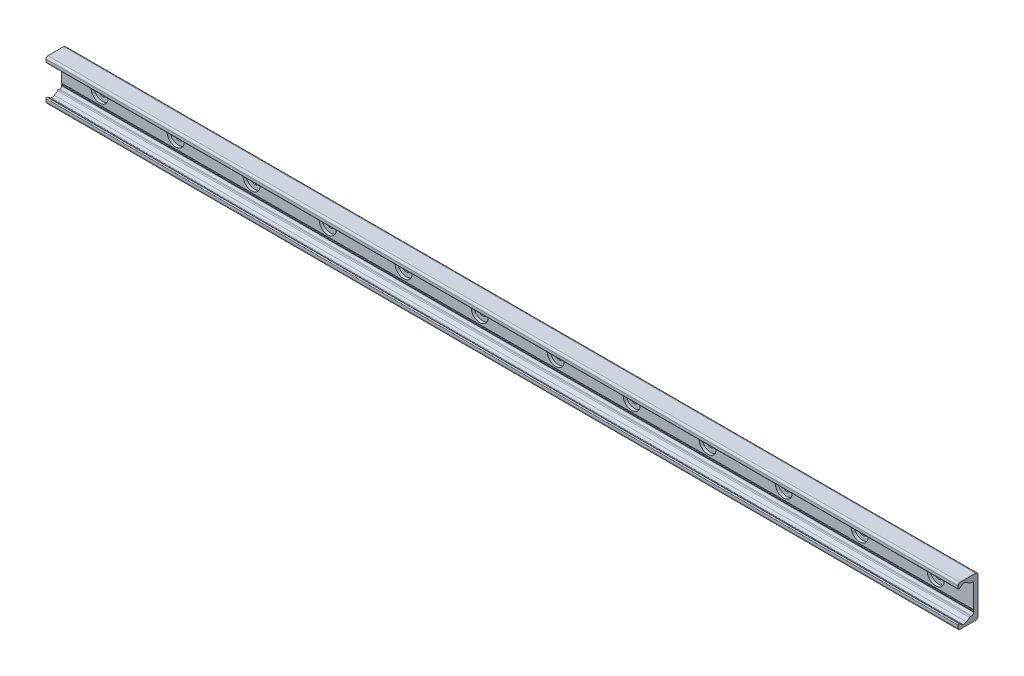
ISO-10303-21;
HEADER;
FILE_DESCRIPTION(('STEP AP214'),'2;1');
FILE_NAME('part.step','',(''),(''),'','','');
FILE_SCHEMA(('AUTOMOTIVE_DESIGN { 1 0 10303 214 1 1 1 1 }'));
ENDSEC;
DATA;
#1=APPLICATION_CONTEXT('core data for automotive mechanical design processes');
#2=APPLICATION_PROTOCOL_DEFINITION('international standard','automotive_design',2000,#1);
#3=PRODUCT_CONTEXT('',#1,'mechanical');
#4=PRODUCT('Part','Part','',(#3));
#5=PRODUCT_RELATED_PRODUCT_CATEGORY('part','',(#4));
#6=PRODUCT_DEFINITION_FORMATION('','',#4);
#7=PRODUCT_DEFINITION_CONTEXT('part definition',#1,'design');
#8=PRODUCT_DEFINITION('design','',#6,#7);
#9=PRODUCT_DEFINITION_SHAPE('','',#8);
#10=(LENGTH_UNIT() NAMED_UNIT(*) SI_UNIT(.MILLI.,.METRE.));
#11=(NAMED_UNIT(*) PLANE_ANGLE_UNIT() SI_UNIT($,.RADIAN.));
#12=(NAMED_UNIT(*) SI_UNIT($,.STERADIAN.) SOLID_ANGLE_UNIT());
#13=UNCERTAINTY_MEASURE_WITH_UNIT(LENGTH_MEASURE(1.E-05),#10,'distance_accuracy_value','');
#14=(GEOMETRIC_REPRESENTATION_CONTEXT(3) GLOBAL_UNCERTAINTY_ASSIGNED_CONTEXT((#13)) GLOBAL_UNIT_ASSIGNED_CONTEXT((#10,
#11,#12)) REPRESENTATION_CONTEXT('',''));
#15=CARTESIAN_POINT('',(0.,0.,0.));
#16=DIRECTION('',(0.,0.,1.));
#17=DIRECTION('',(1.,0.,0.));
#18=AXIS2_PLACEMENT_3D('',#15,#16,#17);
#19=CARTESIAN_POINT('',(-440.,0.,1.39999999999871));
#20=DIRECTION('',(0.,0.,1.));
#21=DIRECTION('',(1.,0.,0.));
#22=AXIS2_PLACEMENT_3D('',#19,#20,#21);
#23=PLANE('',#22);
#24=CARTESIAN_POINT('',(-440.,0.,1.39999999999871));
#25=DIRECTION('',(0.,0.,1.));
#26=DIRECTION('',(1.,0.,0.));
#27=AXIS2_PLACEMENT_3D('',#24,#25,#26);
#28=CIRCLE('',#27,4.50000000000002);
#29=CARTESIAN_POINT('',(-435.5,0.,1.39999999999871));
#30=VERTEX_POINT('',#29);
#31=EDGE_CURVE('E554',#30,#30,#28,.T.);
#32=ORIENTED_EDGE('',*,*,#31,.F.);
#33=EDGE_LOOP('',(#32));
#34=FACE_BOUND('',#33,.T.);
#35=CARTESIAN_POINT('',(-440.,0.,1.39999999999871));
#36=DIRECTION('',(0.,0.,1.));
#37=DIRECTION('',(1.,0.,0.));
#38=AXIS2_PLACEMENT_3D('',#35,#36,#37);
#39=CIRCLE('',#38,8.99999999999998);
#40=CARTESIAN_POINT('',(-431.,0.,1.39999999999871));
#41=VERTEX_POINT('',#40);
#42=EDGE_CURVE('E11',#41,#41,#39,.T.);
#43=ORIENTED_EDGE('',*,*,#42,.T.);
#44=EDGE_LOOP('',(#43));
#45=FACE_BOUND('',#44,.T.);
#46=ADVANCED_FACE('F39',(#34,#45),#23,.T.);
#47=CARTESIAN_POINT('',(-440.,0.,1.39999999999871));
#48=DIRECTION('',(0.,0.,1.));
#49=DIRECTION('',(1.,0.,0.));
#50=AXIS2_PLACEMENT_3D('',#47,#48,#49);
#51=CYLINDRICAL_SURFACE('',#50,8.99999999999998);
#52=CARTESIAN_POINT('',(-440.,0.,4.49999999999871));
#53=DIRECTION('',(0.,0.,1.));
#54=DIRECTION('',(1.,0.,0.));
#55=AXIS2_PLACEMENT_3D('',#52,#53,#54);
#56=CIRCLE('',#55,8.99999999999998);
#57=CARTESIAN_POINT('',(-431.,0.,4.49999999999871));
#58=VERTEX_POINT('',#57);
#59=EDGE_CURVE('E49',#58,#58,#56,.T.);
#60=CARTESIAN_POINT('',(-431.,0.,1.39999999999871));
#61=CARTESIAN_POINT('',(-431.,0.,1.43229166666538));
#62=CARTESIAN_POINT('',(-431.,0.,1.46458333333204));
#63=CARTESIAN_POINT('',(-431.,0.,1.52916666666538));
#64=CARTESIAN_POINT('',(-431.,0.,1.56145833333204));
#65=CARTESIAN_POINT('',(-431.,0.,1.62604166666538));
#66=CARTESIAN_POINT('',(-431.,0.,1.65833333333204));
#67=CARTESIAN_POINT('',(-431.,0.,1.72291666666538));
#68=CARTESIAN_POINT('',(-431.,0.,1.75520833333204));
#69=CARTESIAN_POINT('',(-431.,0.,1.81979166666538));
#70=CARTESIAN_POINT('',(-431.,0.,1.85208333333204));
#71=CARTESIAN_POINT('',(-431.,0.,1.91666666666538));
#72=CARTESIAN_POINT('',(-431.,0.,1.94895833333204));
#73=CARTESIAN_POINT('',(-431.,0.,2.01354166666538));
#74=CARTESIAN_POINT('',(-431.,0.,2.04583333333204));
#75=CARTESIAN_POINT('',(-431.,0.,2.11041666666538));
#76=CARTESIAN_POINT('',(-431.,0.,2.14270833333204));
#77=CARTESIAN_POINT('',(-431.,0.,2.20729166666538));
#78=CARTESIAN_POINT('',(-431.,0.,2.23958333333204));
#79=CARTESIAN_POINT('',(-431.,0.,2.30416666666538));
#80=CARTESIAN_POINT('',(-431.,0.,2.33645833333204));
#81=CARTESIAN_POINT('',(-431.,0.,2.40104166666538));
#82=CARTESIAN_POINT('',(-431.,0.,2.43333333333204));
#83=CARTESIAN_POINT('',(-431.,0.,2.49791666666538));
#84=CARTESIAN_POINT('',(-431.,0.,2.53020833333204));
#85=CARTESIAN_POINT('',(-431.,0.,2.59479166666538));
#86=CARTESIAN_POINT('',(-431.,0.,2.62708333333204));
#87=CARTESIAN_POINT('',(-431.,0.,2.69166666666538));
#88=CARTESIAN_POINT('',(-431.,0.,2.72395833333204));
#89=CARTESIAN_POINT('',(-431.,0.,2.78854166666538));
#90=CARTESIAN_POINT('',(-431.,0.,2.82083333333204));
#91=CARTESIAN_POINT('',(-431.,0.,2.88541666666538));
#92=CARTESIAN_POINT('',(-431.,0.,2.91770833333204));
#93=CARTESIAN_POINT('',(-431.,0.,2.98229166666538));
#94=CARTESIAN_POINT('',(-431.,0.,3.01458333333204));
#95=CARTESIAN_POINT('',(-431.,0.,3.07916666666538));
#96=CARTESIAN_POINT('',(-431.,0.,3.11145833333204));
#97=CARTESIAN_POINT('',(-431.,0.,3.17604166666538));
#98=CARTESIAN_POINT('',(-431.,0.,3.20833333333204));
#99=CARTESIAN_POINT('',(-431.,0.,3.27291666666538));
#100=CARTESIAN_POINT('',(-431.,0.,3.30520833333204));
#101=CARTESIAN_POINT('',(-431.,0.,3.36979166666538));
#102=CARTESIAN_POINT('',(-431.,0.,3.40208333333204));
#103=CARTESIAN_POINT('',(-431.,0.,3.46666666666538));
#104=CARTESIAN_POINT('',(-431.,0.,3.49895833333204));
#105=CARTESIAN_POINT('',(-431.,0.,3.56354166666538));
#106=CARTESIAN_POINT('',(-431.,0.,3.59583333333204));
#107=CARTESIAN_POINT('',(-431.,0.,3.66041666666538));
#108=CARTESIAN_POINT('',(-431.,0.,3.69270833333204));
#109=CARTESIAN_POINT('',(-431.,0.,3.75729166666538));
#110=CARTESIAN_POINT('',(-431.,0.,3.78958333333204));
#111=CARTESIAN_POINT('',(-431.,0.,3.85416666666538));
#112=CARTESIAN_POINT('',(-431.,0.,3.88645833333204));
#113=CARTESIAN_POINT('',(-431.,0.,3.95104166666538));
#114=CARTESIAN_POINT('',(-431.,0.,3.98333333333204));
#115=CARTESIAN_POINT('',(-431.,0.,4.04791666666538));
#116=CARTESIAN_POINT('',(-431.,0.,4.08020833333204));
#117=CARTESIAN_POINT('',(-431.,0.,4.14479166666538));
#118=CARTESIAN_POINT('',(-431.,0.,4.17708333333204));
#119=CARTESIAN_POINT('',(-431.,0.,4.24166666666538));
#120=CARTESIAN_POINT('',(-431.,0.,4.27395833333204));
#121=CARTESIAN_POINT('',(-431.,0.,4.33854166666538));
#122=CARTESIAN_POINT('',(-431.,0.,4.37083333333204));
#123=CARTESIAN_POINT('',(-431.,0.,4.43541666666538));
#124=CARTESIAN_POINT('',(-431.,0.,4.46770833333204));
#125=CARTESIAN_POINT('',(-431.,0.,4.49999999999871));
#126=B_SPLINE_CURVE_WITH_KNOTS('',3,(#60,#61,#62,#63,#64,#65,#66,#67,#68,#69,#70,#71,#72,#73,
#74,#75,#76,#77,#78,#79,#80,#81,#82,#83,#84,#85,#86,#87,#88,#89,#90,#91,#92,#93,#94,#95,#96,#97,
#98,#99,#100,#101,#102,#103,#104,#105,#106,#107,#108,#109,#110,#111,#112,#113,#114,#115,#116,
#117,#118,#119,#120,#121,#122,#123,#124,#125),.UNSPECIFIED.,.F.,.F.,(4,2,2,2,2,2,2,2,2,2,2,2,2,
2,2,2,2,2,2,2,2,2,2,2,2,2,2,2,2,2,2,2,4),(0.,0.0968750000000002,0.19375,0.290625,0.3875,
0.484375,0.58125,0.678125,0.775,0.871875,0.96875,1.065625,1.1625,1.259375,1.35625,1.453125,1.55,
1.646875,1.74375,1.840625,1.9375,2.034375,2.13125,2.228125,2.325,2.421875,2.51875,2.615625,
2.7125,2.809375,2.90625,3.003125,3.1),.UNSPECIFIED.);
#127=EDGE_CURVE('BSEAM524',#41,#58,#126,.T.);
#128=ORIENTED_EDGE('',*,*,#42,.F.);
#129=ORIENTED_EDGE('',*,*,#59,.T.);
#130=ORIENTED_EDGE('',*,*,#127,.T.);
#131=ORIENTED_EDGE('',*,*,#127,.F.);
#132=EDGE_LOOP('',(#128,#130,#129,#131));
#133=FACE_BOUND('',#132,.T.);
#134=ADVANCED_FACE('F524',(#133),#51,.F.);
#135=CARTESIAN_POINT('',(-360.,0.,1.39999999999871));
#136=DIRECTION('',(0.,0.,1.));
#137=DIRECTION('',(1.,0.,0.));
#138=AXIS2_PLACEMENT_3D('',#135,#136,#137);
#139=PLANE('',#138);
#140=CARTESIAN_POINT('',(-360.,0.,1.39999999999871));
#141=DIRECTION('',(0.,0.,1.));
#142=DIRECTION('',(1.,0.,0.));
#143=AXIS2_PLACEMENT_3D('',#140,#141,#142);
#144=CIRCLE('',#143,4.50000000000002);
#145=CARTESIAN_POINT('',(-355.5,0.,1.39999999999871));
#146=VERTEX_POINT('',#145);
#147=EDGE_CURVE('E557',#146,#146,#144,.T.);
#148=ORIENTED_EDGE('',*,*,#147,.F.);
#149=EDGE_LOOP('',(#148));
#150=FACE_BOUND('',#149,.T.);
#151=CARTESIAN_POINT('',(-360.,0.,1.39999999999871));
#152=DIRECTION('',(0.,0.,1.));
#153=DIRECTION('',(1.,0.,0.));
#154=AXIS2_PLACEMENT_3D('',#151,#152,#153);
#155=CIRCLE('',#154,8.99999999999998);
#156=CARTESIAN_POINT('',(-351.,0.,1.39999999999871));
#157=VERTEX_POINT('',#156);
#158=EDGE_CURVE('E515',#157,#157,#155,.T.);
#159=ORIENTED_EDGE('',*,*,#158,.T.);
#160=EDGE_LOOP('',(#159));
#161=FACE_BOUND('',#160,.T.);
#162=ADVANCED_FACE('F549',(#150,#161),#139,.T.);
#163=CARTESIAN_POINT('',(-360.,0.,1.39999999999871));
#164=DIRECTION('',(0.,0.,1.));
#165=DIRECTION('',(1.,0.,0.));
#166=AXIS2_PLACEMENT_3D('',#163,#164,#165);
#167=CYLINDRICAL_SURFACE('',#166,8.99999999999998);
#168=CARTESIAN_POINT('',(-360.,0.,4.49999999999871));
#169=DIRECTION('',(0.,0.,1.));
#170=DIRECTION('',(1.,0.,0.));
#171=AXIS2_PLACEMENT_3D('',#168,#169,#170);
#172=CIRCLE('',#171,8.99999999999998);
#173=CARTESIAN_POINT('',(-351.,0.,4.49999999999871));
#174=VERTEX_POINT('',#173);
#175=EDGE_CURVE('E511',#174,#174,#172,.T.);
#176=CARTESIAN_POINT('',(-351.,0.,1.39999999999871));
#177=CARTESIAN_POINT('',(-351.,0.,1.43229166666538));
#178=CARTESIAN_POINT('',(-351.,0.,1.46458333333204));
#179=CARTESIAN_POINT('',(-351.,0.,1.52916666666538));
#180=CARTESIAN_POINT('',(-351.,0.,1.56145833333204));
#181=CARTESIAN_POINT('',(-351.,0.,1.62604166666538));
#182=CARTESIAN_POINT('',(-351.,0.,1.65833333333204));
#183=CARTESIAN_POINT('',(-351.,0.,1.72291666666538));
#184=CARTESIAN_POINT('',(-351.,0.,1.75520833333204));
#185=CARTESIAN_POINT('',(-351.,0.,1.81979166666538));
#186=CARTESIAN_POINT('',(-351.,0.,1.85208333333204));
#187=CARTESIAN_POINT('',(-351.,0.,1.91666666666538));
#188=CARTESIAN_POINT('',(-351.,0.,1.94895833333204));
#189=CARTESIAN_POINT('',(-351.,0.,2.01354166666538));
#190=CARTESIAN_POINT('',(-351.,0.,2.04583333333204));
#191=CARTESIAN_POINT('',(-351.,0.,2.11041666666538));
#192=CARTESIAN_POINT('',(-351.,0.,2.14270833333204));
#193=CARTESIAN_POINT('',(-351.,0.,2.20729166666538));
#194=CARTESIAN_POINT('',(-351.,0.,2.23958333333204));
#195=CARTESIAN_POINT('',(-351.,0.,2.30416666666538));
#196=CARTESIAN_POINT('',(-351.,0.,2.33645833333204));
#197=CARTESIAN_POINT('',(-351.,0.,2.40104166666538));
#198=CARTESIAN_POINT('',(-351.,0.,2.43333333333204));
#199=CARTESIAN_POINT('',(-351.,0.,2.49791666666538));
#200=CARTESIAN_POINT('',(-351.,0.,2.53020833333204));
#201=CARTESIAN_POINT('',(-351.,0.,2.59479166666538));
#202=CARTESIAN_POINT('',(-351.,0.,2.62708333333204));
#203=CARTESIAN_POINT('',(-351.,0.,2.69166666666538));
#204=CARTESIAN_POINT('',(-351.,0.,2.72395833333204));
#205=CARTESIAN_POINT('',(-351.,0.,2.78854166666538));
#206=CARTESIAN_POINT('',(-351.,0.,2.82083333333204));
#207=CARTESIAN_POINT('',(-351.,0.,2.88541666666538));
#208=CARTESIAN_POINT('',(-351.,0.,2.91770833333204));
#209=CARTESIAN_POINT('',(-351.,0.,2.98229166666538));
#210=CARTESIAN_POINT('',(-351.,0.,3.01458333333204));
#211=CARTESIAN_POINT('',(-351.,0.,3.07916666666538));
#212=CARTESIAN_POINT('',(-351.,0.,3.11145833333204));
#213=CARTESIAN_POINT('',(-351.,0.,3.17604166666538));
#214=CARTESIAN_POINT('',(-351.,0.,3.20833333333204));
#215=CARTESIAN_POINT('',(-351.,0.,3.27291666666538));
#216=CARTESIAN_POINT('',(-351.,0.,3.30520833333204));
#217=CARTESIAN_POINT('',(-351.,0.,3.36979166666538));
#218=CARTESIAN_POINT('',(-351.,0.,3.40208333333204));
#219=CARTESIAN_POINT('',(-351.,0.,3.46666666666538));
#220=CARTESIAN_POINT('',(-351.,0.,3.49895833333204));
#221=CARTESIAN_POINT('',(-351.,0.,3.56354166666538));
#222=CARTESIAN_POINT('',(-351.,0.,3.59583333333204));
#223=CARTESIAN_POINT('',(-351.,0.,3.66041666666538));
#224=CARTESIAN_POINT('',(-351.,0.,3.69270833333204));
#225=CARTESIAN_POINT('',(-351.,0.,3.75729166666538));
#226=CARTESIAN_POINT('',(-351.,0.,3.78958333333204));
#227=CARTESIAN_POINT('',(-351.,0.,3.85416666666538));
#228=CARTESIAN_POINT('',(-351.,0.,3.88645833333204));
#229=CARTESIAN_POINT('',(-351.,0.,3.95104166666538));
#230=CARTESIAN_POINT('',(-351.,0.,3.98333333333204));
#231=CARTESIAN_POINT('',(-351.,0.,4.04791666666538));
#232=CARTESIAN_POINT('',(-351.,0.,4.08020833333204));
#233=CARTESIAN_POINT('',(-351.,0.,4.14479166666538));
#234=CARTESIAN_POINT('',(-351.,0.,4.17708333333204));
#235=CARTESIAN_POINT('',(-351.,0.,4.24166666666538));
#236=CARTESIAN_POINT('',(-351.,0.,4.27395833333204));
#237=CARTESIAN_POINT('',(-351.,0.,4.33854166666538));
#238=CARTESIAN_POINT('',(-351.,0.,4.37083333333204));
#239=CARTESIAN_POINT('',(-351.,0.,4.43541666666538));
#240=CARTESIAN_POINT('',(-351.,0.,4.46770833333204));
#241=CARTESIAN_POINT('',(-351.,0.,4.49999999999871));
#242=B_SPLINE_CURVE_WITH_KNOTS('',3,(#176,#177,#178,#179,#180,#181,#182,#183,#184,#185,#186,
#187,#188,#189,#190,#191,#192,#193,#194,#195,#196,#197,#198,#199,#200,#201,#202,#203,#204,#205,
#206,#207,#208,#209,#210,#211,#212,#213,#214,#215,#216,#217,#218,#219,#220,#221,#222,#223,#224,
#225,#226,#227,#228,#229,#230,#231,#232,#233,#234,#235,#236,#237,#238,#239,#240,#241),
.UNSPECIFIED.,.F.,.F.,(4,2,2,2,2,2,2,2,2,2,2,2,2,2,2,2,2,2,2,2,2,2,2,2,2,2,2,2,2,2,2,2,4),(0.,
0.0968750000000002,0.19375,0.290625,0.3875,0.484375,0.58125,0.678125,0.775,0.871875,0.96875,
1.065625,1.1625,1.259375,1.35625,1.453125,1.55,1.646875,1.74375,1.840625,1.9375,2.034375,
2.13125,2.228125,2.325,2.421875,2.51875,2.615625,2.7125,2.809375,2.90625,3.003125,3.1),.UNSPECIFIED.);
#243=EDGE_CURVE('BSEAM995',#157,#174,#242,.T.);
#244=ORIENTED_EDGE('',*,*,#158,.F.);
#245=ORIENTED_EDGE('',*,*,#175,.T.);
#246=ORIENTED_EDGE('',*,*,#243,.T.);
#247=ORIENTED_EDGE('',*,*,#243,.F.);
#248=EDGE_LOOP('',(#244,#246,#245,#247));
#249=FACE_BOUND('',#248,.T.);
#250=ADVANCED_FACE('F995',(#249),#167,.F.);
#251=CARTESIAN_POINT('',(-280.,0.,1.39999999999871));
#252=DIRECTION('',(0.,0.,1.));
#253=DIRECTION('',(1.,0.,0.));
#254=AXIS2_PLACEMENT_3D('',#251,#252,#253);
#255=PLANE('',#254);
#256=CARTESIAN_POINT('',(-280.,0.,1.39999999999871));
#257=DIRECTION('',(0.,0.,1.));
#258=DIRECTION('',(1.,0.,0.));
#259=AXIS2_PLACEMENT_3D('',#256,#257,#258);
#260=CIRCLE('',#259,4.50000000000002);
#261=CARTESIAN_POINT('',(-275.5,0.,1.39999999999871));
#262=VERTEX_POINT('',#261);
#263=EDGE_CURVE('E561',#262,#262,#260,.T.);
#264=ORIENTED_EDGE('',*,*,#263,.F.);
#265=EDGE_LOOP('',(#264));
#266=FACE_BOUND('',#265,.T.);
#267=CARTESIAN_POINT('',(-280.,0.,1.39999999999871));
#268=DIRECTION('',(0.,0.,1.));
#269=DIRECTION('',(1.,0.,0.));
#270=AXIS2_PLACEMENT_3D('',#267,#268,#269);
#271=CIRCLE('',#270,8.99999999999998);
#272=CARTESIAN_POINT('',(-271.,0.,1.39999999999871));
#273=VERTEX_POINT('',#272);
#274=EDGE_CURVE('E507',#273,#273,#271,.T.);
#275=ORIENTED_EDGE('',*,*,#274,.T.);
#276=EDGE_LOOP('',(#275));
#277=FACE_BOUND('',#276,.T.);
#278=ADVANCED_FACE('F991',(#266,#277),#255,.T.);
#279=CARTESIAN_POINT('',(-280.,0.,1.39999999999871));
#280=DIRECTION('',(0.,0.,1.));
#281=DIRECTION('',(1.,0.,0.));
#282=AXIS2_PLACEMENT_3D('',#279,#280,#281);
#283=CYLINDRICAL_SURFACE('',#282,8.99999999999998);
#284=CARTESIAN_POINT('',(-280.,0.,4.49999999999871));
#285=DIRECTION('',(0.,0.,1.));
#286=DIRECTION('',(1.,0.,0.));
#287=AXIS2_PLACEMENT_3D('',#284,#285,#286);
#288=CIRCLE('',#287,8.99999999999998);
#289=CARTESIAN_POINT('',(-271.,0.,4.49999999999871));
#290=VERTEX_POINT('',#289);
#291=EDGE_CURVE('E503',#290,#290,#288,.T.);
#292=CARTESIAN_POINT('',(-271.,0.,1.39999999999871));
#293=CARTESIAN_POINT('',(-271.,0.,1.43229166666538));
#294=CARTESIAN_POINT('',(-271.,0.,1.46458333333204));
#295=CARTESIAN_POINT('',(-271.,0.,1.52916666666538));
#296=CARTESIAN_POINT('',(-271.,0.,1.56145833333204));
#297=CARTESIAN_POINT('',(-271.,0.,1.62604166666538));
#298=CARTESIAN_POINT('',(-271.,0.,1.65833333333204));
#299=CARTESIAN_POINT('',(-271.,0.,1.72291666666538));
#300=CARTESIAN_POINT('',(-271.,0.,1.75520833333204));
#301=CARTESIAN_POINT('',(-271.,0.,1.81979166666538));
#302=CARTESIAN_POINT('',(-271.,0.,1.85208333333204));
#303=CARTESIAN_POINT('',(-271.,0.,1.91666666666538));
#304=CARTESIAN_POINT('',(-271.,0.,1.94895833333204));
#305=CARTESIAN_POINT('',(-271.,0.,2.01354166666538));
#306=CARTESIAN_POINT('',(-271.,0.,2.04583333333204));
#307=CARTESIAN_POINT('',(-271.,0.,2.11041666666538));
#308=CARTESIAN_POINT('',(-271.,0.,2.14270833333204));
#309=CARTESIAN_POINT('',(-271.,0.,2.20729166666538));
#310=CARTESIAN_POINT('',(-271.,0.,2.23958333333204));
#311=CARTESIAN_POINT('',(-271.,0.,2.30416666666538));
#312=CARTESIAN_POINT('',(-271.,0.,2.33645833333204));
#313=CARTESIAN_POINT('',(-271.,0.,2.40104166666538));
#314=CARTESIAN_POINT('',(-271.,0.,2.43333333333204));
#315=CARTESIAN_POINT('',(-271.,0.,2.49791666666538));
#316=CARTESIAN_POINT('',(-271.,0.,2.53020833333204));
#317=CARTESIAN_POINT('',(-271.,0.,2.59479166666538));
#318=CARTESIAN_POINT('',(-271.,0.,2.62708333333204));
#319=CARTESIAN_POINT('',(-271.,0.,2.69166666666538));
#320=CARTESIAN_POINT('',(-271.,0.,2.72395833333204));
#321=CARTESIAN_POINT('',(-271.,0.,2.78854166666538));
#322=CARTESIAN_POINT('',(-271.,0.,2.82083333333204));
#323=CARTESIAN_POINT('',(-271.,0.,2.88541666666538));
#324=CARTESIAN_POINT('',(-271.,0.,2.91770833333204));
#325=CARTESIAN_POINT('',(-271.,0.,2.98229166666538));
#326=CARTESIAN_POINT('',(-271.,0.,3.01458333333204));
#327=CARTESIAN_POINT('',(-271.,0.,3.07916666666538));
#328=CARTESIAN_POINT('',(-271.,0.,3.11145833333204));
#329=CARTESIAN_POINT('',(-271.,0.,3.17604166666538));
#330=CARTESIAN_POINT('',(-271.,0.,3.20833333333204));
#331=CARTESIAN_POINT('',(-271.,0.,3.27291666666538));
#332=CARTESIAN_POINT('',(-271.,0.,3.30520833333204));
#333=CARTESIAN_POINT('',(-271.,0.,3.36979166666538));
#334=CARTESIAN_POINT('',(-271.,0.,3.40208333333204));
#335=CARTESIAN_POINT('',(-271.,0.,3.46666666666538));
#336=CARTESIAN_POINT('',(-271.,0.,3.49895833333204));
#337=CARTESIAN_POINT('',(-271.,0.,3.56354166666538));
#338=CARTESIAN_POINT('',(-271.,0.,3.59583333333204));
#339=CARTESIAN_POINT('',(-271.,0.,3.66041666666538));
#340=CARTESIAN_POINT('',(-271.,0.,3.69270833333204));
#341=CARTESIAN_POINT('',(-271.,0.,3.75729166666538));
#342=CARTESIAN_POINT('',(-271.,0.,3.78958333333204));
#343=CARTESIAN_POINT('',(-271.,0.,3.85416666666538));
#344=CARTESIAN_POINT('',(-271.,0.,3.88645833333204));
#345=CARTESIAN_POINT('',(-271.,0.,3.95104166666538));
#346=CARTESIAN_POINT('',(-271.,0.,3.98333333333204));
#347=CARTESIAN_POINT('',(-271.,0.,4.04791666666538));
#348=CARTESIAN_POINT('',(-271.,0.,4.08020833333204));
#349=CARTESIAN_POINT('',(-271.,0.,4.14479166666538));
#350=CARTESIAN_POINT('',(-271.,0.,4.17708333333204));
#351=CARTESIAN_POINT('',(-271.,0.,4.24166666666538));
#352=CARTESIAN_POINT('',(-271.,0.,4.27395833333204));
#353=CARTESIAN_POINT('',(-271.,0.,4.33854166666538));
#354=CARTESIAN_POINT('',(-271.,0.,4.37083333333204));
#355=CARTESIAN_POINT('',(-271.,0.,4.43541666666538));
#356=CARTESIAN_POINT('',(-271.,0.,4.46770833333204));
#357=CARTESIAN_POINT('',(-271.,0.,4.49999999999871));
#358=B_SPLINE_CURVE_WITH_KNOTS('',3,(#292,#293,#294,#295,#296,#297,#298,#299,#300,#301,#302,
#303,#304,#305,#306,#307,#308,#309,#310,#311,#312,#313,#314,#315,#316,#317,#318,#319,#320,#321,
#322,#323,#324,#325,#326,#327,#328,#329,#330,#331,#332,#333,#334,#335,#336,#337,#338,#339,#340,
#341,#342,#343,#344,#345,#346,#347,#348,#349,#350,#351,#352,#353,#354,#355,#356,#357),
.UNSPECIFIED.,.F.,.F.,(4,2,2,2,2,2,2,2,2,2,2,2,2,2,2,2,2,2,2,2,2,2,2,2,2,2,2,2,2,2,2,2,4),(0.,
0.0968750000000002,0.19375,0.290625,0.3875,0.484375,0.58125,0.678125,0.775,0.871875,0.96875,
1.065625,1.1625,1.259375,1.35625,1.453125,1.55,1.646875,1.74375,1.840625,1.9375,2.034375,
2.13125,2.228125,2.325,2.421875,2.51875,2.615625,2.7125,2.809375,2.90625,3.003125,3.1),.UNSPECIFIED.);
#359=EDGE_CURVE('BSEAM987',#273,#290,#358,.T.);
#360=ORIENTED_EDGE('',*,*,#274,.F.);
#361=ORIENTED_EDGE('',*,*,#291,.T.);
#362=ORIENTED_EDGE('',*,*,#359,.T.);
#363=ORIENTED_EDGE('',*,*,#359,.F.);
#364=EDGE_LOOP('',(#360,#362,#361,#363));
#365=FACE_BOUND('',#364,.T.);
#366=ADVANCED_FACE('F987',(#365),#283,.F.);
#367=CARTESIAN_POINT('',(-200.,0.,1.39999999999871));
#368=DIRECTION('',(0.,0.,1.));
#369=DIRECTION('',(1.,0.,0.));
#370=AXIS2_PLACEMENT_3D('',#367,#368,#369);
#371=PLANE('',#370);
#372=CARTESIAN_POINT('',(-200.,0.,1.39999999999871));
#373=DIRECTION('',(0.,0.,1.));
#374=DIRECTION('',(1.,0.,0.));
#375=AXIS2_PLACEMENT_3D('',#372,#373,#374);
#376=CIRCLE('',#375,4.50000000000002);
#377=CARTESIAN_POINT('',(-195.5,0.,1.39999999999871));
#378=VERTEX_POINT('',#377);
#379=EDGE_CURVE('E573',#378,#378,#376,.T.);
#380=ORIENTED_EDGE('',*,*,#379,.F.);
#381=EDGE_LOOP('',(#380));
#382=FACE_BOUND('',#381,.T.);
#383=CARTESIAN_POINT('',(-200.,0.,1.39999999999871));
#384=DIRECTION('',(0.,0.,1.));
#385=DIRECTION('',(1.,0.,0.));
#386=AXIS2_PLACEMENT_3D('',#383,#384,#385);
#387=CIRCLE('',#386,8.99999999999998);
#388=CARTESIAN_POINT('',(-191.,0.,1.39999999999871));
#389=VERTEX_POINT('',#388);
#390=EDGE_CURVE('E499',#389,#389,#387,.T.);
#391=ORIENTED_EDGE('',*,*,#390,.T.);
#392=EDGE_LOOP('',(#391));
#393=FACE_BOUND('',#392,.T.);
#394=ADVANCED_FACE('F983',(#382,#393),#371,.T.);
#395=CARTESIAN_POINT('',(-200.,0.,1.39999999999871));
#396=DIRECTION('',(0.,0.,1.));
#397=DIRECTION('',(1.,0.,0.));
#398=AXIS2_PLACEMENT_3D('',#395,#396,#397);
#399=CYLINDRICAL_SURFACE('',#398,8.99999999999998);
#400=CARTESIAN_POINT('',(-200.,0.,4.49999999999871));
#401=DIRECTION('',(0.,0.,1.));
#402=DIRECTION('',(1.,0.,0.));
#403=AXIS2_PLACEMENT_3D('',#400,#401,#402);
#404=CIRCLE('',#403,8.99999999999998);
#405=CARTESIAN_POINT('',(-191.,0.,4.49999999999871));
#406=VERTEX_POINT('',#405);
#407=EDGE_CURVE('E495',#406,#406,#404,.T.);
#408=CARTESIAN_POINT('',(-191.,0.,1.39999999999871));
#409=CARTESIAN_POINT('',(-191.,0.,1.43229166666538));
#410=CARTESIAN_POINT('',(-191.,0.,1.46458333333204));
#411=CARTESIAN_POINT('',(-191.,0.,1.52916666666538));
#412=CARTESIAN_POINT('',(-191.,0.,1.56145833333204));
#413=CARTESIAN_POINT('',(-191.,0.,1.62604166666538));
#414=CARTESIAN_POINT('',(-191.,0.,1.65833333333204));
#415=CARTESIAN_POINT('',(-191.,0.,1.72291666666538));
#416=CARTESIAN_POINT('',(-191.,0.,1.75520833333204));
#417=CARTESIAN_POINT('',(-191.,0.,1.81979166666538));
#418=CARTESIAN_POINT('',(-191.,0.,1.85208333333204));
#419=CARTESIAN_POINT('',(-191.,0.,1.91666666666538));
#420=CARTESIAN_POINT('',(-191.,0.,1.94895833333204));
#421=CARTESIAN_POINT('',(-191.,0.,2.01354166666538));
#422=CARTESIAN_POINT('',(-191.,0.,2.04583333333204));
#423=CARTESIAN_POINT('',(-191.,0.,2.11041666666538));
#424=CARTESIAN_POINT('',(-191.,0.,2.14270833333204));
#425=CARTESIAN_POINT('',(-191.,0.,2.20729166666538));
#426=CARTESIAN_POINT('',(-191.,0.,2.23958333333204));
#427=CARTESIAN_POINT('',(-191.,0.,2.30416666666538));
#428=CARTESIAN_POINT('',(-191.,0.,2.33645833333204));
#429=CARTESIAN_POINT('',(-191.,0.,2.40104166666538));
#430=CARTESIAN_POINT('',(-191.,0.,2.43333333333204));
#431=CARTESIAN_POINT('',(-191.,0.,2.49791666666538));
#432=CARTESIAN_POINT('',(-191.,0.,2.53020833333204));
#433=CARTESIAN_POINT('',(-191.,0.,2.59479166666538));
#434=CARTESIAN_POINT('',(-191.,0.,2.62708333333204));
#435=CARTESIAN_POINT('',(-191.,0.,2.69166666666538));
#436=CARTESIAN_POINT('',(-191.,0.,2.72395833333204));
#437=CARTESIAN_POINT('',(-191.,0.,2.78854166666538));
#438=CARTESIAN_POINT('',(-191.,0.,2.82083333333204));
#439=CARTESIAN_POINT('',(-191.,0.,2.88541666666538));
#440=CARTESIAN_POINT('',(-191.,0.,2.91770833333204));
#441=CARTESIAN_POINT('',(-191.,0.,2.98229166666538));
#442=CARTESIAN_POINT('',(-191.,0.,3.01458333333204));
#443=CARTESIAN_POINT('',(-191.,0.,3.07916666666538));
#444=CARTESIAN_POINT('',(-191.,0.,3.11145833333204));
#445=CARTESIAN_POINT('',(-191.,0.,3.17604166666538));
#446=CARTESIAN_POINT('',(-191.,0.,3.20833333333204));
#447=CARTESIAN_POINT('',(-191.,0.,3.27291666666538));
#448=CARTESIAN_POINT('',(-191.,0.,3.30520833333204));
#449=CARTESIAN_POINT('',(-191.,0.,3.36979166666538));
#450=CARTESIAN_POINT('',(-191.,0.,3.40208333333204));
#451=CARTESIAN_POINT('',(-191.,0.,3.46666666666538));
#452=CARTESIAN_POINT('',(-191.,0.,3.49895833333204));
#453=CARTESIAN_POINT('',(-191.,0.,3.56354166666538));
#454=CARTESIAN_POINT('',(-191.,0.,3.59583333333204));
#455=CARTESIAN_POINT('',(-191.,0.,3.66041666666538));
#456=CARTESIAN_POINT('',(-191.,0.,3.69270833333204));
#457=CARTESIAN_POINT('',(-191.,0.,3.75729166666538));
#458=CARTESIAN_POINT('',(-191.,0.,3.78958333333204));
#459=CARTESIAN_POINT('',(-191.,0.,3.85416666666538));
#460=CARTESIAN_POINT('',(-191.,0.,3.88645833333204));
#461=CARTESIAN_POINT('',(-191.,0.,3.95104166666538));
#462=CARTESIAN_POINT('',(-191.,0.,3.98333333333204));
#463=CARTESIAN_POINT('',(-191.,0.,4.04791666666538));
#464=CARTESIAN_POINT('',(-191.,0.,4.08020833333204));
#465=CARTESIAN_POINT('',(-191.,0.,4.14479166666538));
#466=CARTESIAN_POINT('',(-191.,0.,4.17708333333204));
#467=CARTESIAN_POINT('',(-191.,0.,4.24166666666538));
#468=CARTESIAN_POINT('',(-191.,0.,4.27395833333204));
#469=CARTESIAN_POINT('',(-191.,0.,4.33854166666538));
#470=CARTESIAN_POINT('',(-191.,0.,4.37083333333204));
#471=CARTESIAN_POINT('',(-191.,0.,4.43541666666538));
#472=CARTESIAN_POINT('',(-191.,0.,4.46770833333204));
#473=CARTESIAN_POINT('',(-191.,0.,4.49999999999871));
#474=B_SPLINE_CURVE_WITH_KNOTS('',3,(#408,#409,#410,#411,#412,#413,#414,#415,#416,#417,#418,
#419,#420,#421,#422,#423,#424,#425,#426,#427,#428,#429,#430,#431,#432,#433,#434,#435,#436,#437,
#438,#439,#440,#441,#442,#443,#444,#445,#446,#447,#448,#449,#450,#451,#452,#453,#454,#455,#456,
#457,#458,#459,#460,#461,#462,#463,#464,#465,#466,#467,#468,#469,#470,#471,#472,#473),
.UNSPECIFIED.,.F.,.F.,(4,2,2,2,2,2,2,2,2,2,2,2,2,2,2,2,2,2,2,2,2,2,2,2,2,2,2,2,2,2,2,2,4),(0.,
0.0968750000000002,0.19375,0.290625,0.3875,0.484375,0.58125,0.678125,0.775,0.871875,0.96875,
1.065625,1.1625,1.259375,1.35625,1.453125,1.55,1.646875,1.74375,1.840625,1.9375,2.034375,
2.13125,2.228125,2.325,2.421875,2.51875,2.615625,2.7125,2.809375,2.90625,3.003125,3.1),.UNSPECIFIED.);
#475=EDGE_CURVE('BSEAM979',#389,#406,#474,.T.);
#476=ORIENTED_EDGE('',*,*,#390,.F.);
#477=ORIENTED_EDGE('',*,*,#407,.T.);
#478=ORIENTED_EDGE('',*,*,#475,.T.);
#479=ORIENTED_EDGE('',*,*,#475,.F.);
#480=EDGE_LOOP('',(#476,#478,#477,#479));
#481=FACE_BOUND('',#480,.T.);
#482=ADVANCED_FACE('F979',(#481),#399,.F.);
#483=CARTESIAN_POINT('',(-120.,0.,1.39999999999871));
#484=DIRECTION('',(0.,0.,1.));
#485=DIRECTION('',(1.,0.,0.));
#486=AXIS2_PLACEMENT_3D('',#483,#484,#485);
#487=PLANE('',#486);
#488=CARTESIAN_POINT('',(-120.,0.,1.39999999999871));
#489=DIRECTION('',(0.,0.,1.));
#490=DIRECTION('',(1.,0.,0.));
#491=AXIS2_PLACEMENT_3D('',#488,#489,#490);
#492=CIRCLE('',#491,4.50000000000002);
#493=CARTESIAN_POINT('',(-115.5,0.,1.39999999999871));
#494=VERTEX_POINT('',#493);
#495=EDGE_CURVE('E577',#494,#494,#492,.T.);
#496=ORIENTED_EDGE('',*,*,#495,.F.);
#497=EDGE_LOOP('',(#496));
#498=FACE_BOUND('',#497,.T.);
#499=CARTESIAN_POINT('',(-120.,0.,1.39999999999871));
#500=DIRECTION('',(0.,0.,1.));
#501=DIRECTION('',(1.,0.,0.));
#502=AXIS2_PLACEMENT_3D('',#499,#500,#501);
#503=CIRCLE('',#502,8.99999999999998);
#504=CARTESIAN_POINT('',(-111.,0.,1.39999999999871));
#505=VERTEX_POINT('',#504);
#506=EDGE_CURVE('E491',#505,#505,#503,.T.);
#507=ORIENTED_EDGE('',*,*,#506,.T.);
#508=EDGE_LOOP('',(#507));
#509=FACE_BOUND('',#508,.T.);
#510=ADVANCED_FACE('F975',(#498,#509),#487,.T.);
#511=CARTESIAN_POINT('',(-120.,0.,1.39999999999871));
#512=DIRECTION('',(0.,0.,1.));
#513=DIRECTION('',(1.,0.,0.));
#514=AXIS2_PLACEMENT_3D('',#511,#512,#513);
#515=CYLINDRICAL_SURFACE('',#514,8.99999999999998);
#516=CARTESIAN_POINT('',(-120.,0.,4.49999999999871));
#517=DIRECTION('',(0.,0.,1.));
#518=DIRECTION('',(1.,0.,0.));
#519=AXIS2_PLACEMENT_3D('',#516,#517,#518);
#520=CIRCLE('',#519,8.99999999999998);
#521=CARTESIAN_POINT('',(-111.,0.,4.49999999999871));
#522=VERTEX_POINT('',#521);
#523=EDGE_CURVE('E487',#522,#522,#520,.T.);
#524=CARTESIAN_POINT('',(-111.,0.,1.39999999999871));
#525=CARTESIAN_POINT('',(-111.,0.,1.43229166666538));
#526=CARTESIAN_POINT('',(-111.,0.,1.46458333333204));
#527=CARTESIAN_POINT('',(-111.,0.,1.52916666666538));
#528=CARTESIAN_POINT('',(-111.,0.,1.56145833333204));
#529=CARTESIAN_POINT('',(-111.,0.,1.62604166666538));
#530=CARTESIAN_POINT('',(-111.,0.,1.65833333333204));
#531=CARTESIAN_POINT('',(-111.,0.,1.72291666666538));
#532=CARTESIAN_POINT('',(-111.,0.,1.75520833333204));
#533=CARTESIAN_POINT('',(-111.,0.,1.81979166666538));
#534=CARTESIAN_POINT('',(-111.,0.,1.85208333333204));
#535=CARTESIAN_POINT('',(-111.,0.,1.91666666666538));
#536=CARTESIAN_POINT('',(-111.,0.,1.94895833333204));
#537=CARTESIAN_POINT('',(-111.,0.,2.01354166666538));
#538=CARTESIAN_POINT('',(-111.,0.,2.04583333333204));
#539=CARTESIAN_POINT('',(-111.,0.,2.11041666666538));
#540=CARTESIAN_POINT('',(-111.,0.,2.14270833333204));
#541=CARTESIAN_POINT('',(-111.,0.,2.20729166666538));
#542=CARTESIAN_POINT('',(-111.,0.,2.23958333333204));
#543=CARTESIAN_POINT('',(-111.,0.,2.30416666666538));
#544=CARTESIAN_POINT('',(-111.,0.,2.33645833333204));
#545=CARTESIAN_POINT('',(-111.,0.,2.40104166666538));
#546=CARTESIAN_POINT('',(-111.,0.,2.43333333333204));
#547=CARTESIAN_POINT('',(-111.,0.,2.49791666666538));
#548=CARTESIAN_POINT('',(-111.,0.,2.53020833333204));
#549=CARTESIAN_POINT('',(-111.,0.,2.59479166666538));
#550=CARTESIAN_POINT('',(-111.,0.,2.62708333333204));
#551=CARTESIAN_POINT('',(-111.,0.,2.69166666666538));
#552=CARTESIAN_POINT('',(-111.,0.,2.72395833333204));
#553=CARTESIAN_POINT('',(-111.,0.,2.78854166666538));
#554=CARTESIAN_POINT('',(-111.,0.,2.82083333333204));
#555=CARTESIAN_POINT('',(-111.,0.,2.88541666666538));
#556=CARTESIAN_POINT('',(-111.,0.,2.91770833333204));
#557=CARTESIAN_POINT('',(-111.,0.,2.98229166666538));
#558=CARTESIAN_POINT('',(-111.,0.,3.01458333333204));
#559=CARTESIAN_POINT('',(-111.,0.,3.07916666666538));
#560=CARTESIAN_POINT('',(-111.,0.,3.11145833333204));
#561=CARTESIAN_POINT('',(-111.,0.,3.17604166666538));
#562=CARTESIAN_POINT('',(-111.,0.,3.20833333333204));
#563=CARTESIAN_POINT('',(-111.,0.,3.27291666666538));
#564=CARTESIAN_POINT('',(-111.,0.,3.30520833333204));
#565=CARTESIAN_POINT('',(-111.,0.,3.36979166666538));
#566=CARTESIAN_POINT('',(-111.,0.,3.40208333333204));
#567=CARTESIAN_POINT('',(-111.,0.,3.46666666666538));
#568=CARTESIAN_POINT('',(-111.,0.,3.49895833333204));
#569=CARTESIAN_POINT('',(-111.,0.,3.56354166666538));
#570=CARTESIAN_POINT('',(-111.,0.,3.59583333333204));
#571=CARTESIAN_POINT('',(-111.,0.,3.66041666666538));
#572=CARTESIAN_POINT('',(-111.,0.,3.69270833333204));
#573=CARTESIAN_POINT('',(-111.,0.,3.75729166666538));
#574=CARTESIAN_POINT('',(-111.,0.,3.78958333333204));
#575=CARTESIAN_POINT('',(-111.,0.,3.85416666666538));
#576=CARTESIAN_POINT('',(-111.,0.,3.88645833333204));
#577=CARTESIAN_POINT('',(-111.,0.,3.95104166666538));
#578=CARTESIAN_POINT('',(-111.,0.,3.98333333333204));
#579=CARTESIAN_POINT('',(-111.,0.,4.04791666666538));
#580=CARTESIAN_POINT('',(-111.,0.,4.08020833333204));
#581=CARTESIAN_POINT('',(-111.,0.,4.14479166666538));
#582=CARTESIAN_POINT('',(-111.,0.,4.17708333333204));
#583=CARTESIAN_POINT('',(-111.,0.,4.24166666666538));
#584=CARTESIAN_POINT('',(-111.,0.,4.27395833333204));
#585=CARTESIAN_POINT('',(-111.,0.,4.33854166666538));
#586=CARTESIAN_POINT('',(-111.,0.,4.37083333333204));
#587=CARTESIAN_POINT('',(-111.,0.,4.43541666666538));
#588=CARTESIAN_POINT('',(-111.,0.,4.46770833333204));
#589=CARTESIAN_POINT('',(-111.,0.,4.49999999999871));
#590=B_SPLINE_CURVE_WITH_KNOTS('',3,(#524,#525,#526,#527,#528,#529,#530,#531,#532,#533,#534,
#535,#536,#537,#538,#539,#540,#541,#542,#543,#544,#545,#546,#547,#548,#549,#550,#551,#552,#553,
#554,#555,#556,#557,#558,#559,#560,#561,#562,#563,#564,#565,#566,#567,#568,#569,#570,#571,#572,
#573,#574,#575,#576,#577,#578,#579,#580,#581,#582,#583,#584,#585,#586,#587,#588,#589),
.UNSPECIFIED.,.F.,.F.,(4,2,2,2,2,2,2,2,2,2,2,2,2,2,2,2,2,2,2,2,2,2,2,2,2,2,2,2,2,2,2,2,4),(0.,
0.0968750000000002,0.19375,0.290625,0.3875,0.484375,0.58125,0.678125,0.775,0.871875,0.96875,
1.065625,1.1625,1.259375,1.35625,1.453125,1.55,1.646875,1.74375,1.840625,1.9375,2.034375,
2.13125,2.228125,2.325,2.421875,2.51875,2.615625,2.7125,2.809375,2.90625,3.003125,3.1),.UNSPECIFIED.);
#591=EDGE_CURVE('BSEAM971',#505,#522,#590,.T.);
#592=ORIENTED_EDGE('',*,*,#506,.F.);
#593=ORIENTED_EDGE('',*,*,#523,.T.);
#594=ORIENTED_EDGE('',*,*,#591,.T.);
#595=ORIENTED_EDGE('',*,*,#591,.F.);
#596=EDGE_LOOP('',(#592,#594,#593,#595));
#597=FACE_BOUND('',#596,.T.);
#598=ADVANCED_FACE('F971',(#597),#515,.F.);
#599=CARTESIAN_POINT('',(-40.,0.,1.39999999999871));
#600=DIRECTION('',(0.,0.,1.));
#601=DIRECTION('',(1.,0.,0.));
#602=AXIS2_PLACEMENT_3D('',#599,#600,#601);
#603=PLANE('',#602);
#604=CARTESIAN_POINT('',(-40.,0.,1.39999999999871));
#605=DIRECTION('',(0.,0.,1.));
#606=DIRECTION('',(1.,0.,0.));
#607=AXIS2_PLACEMENT_3D('',#604,#605,#606);
#608=CIRCLE('',#607,4.50000000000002);
#609=CARTESIAN_POINT('',(-35.5,0.,1.39999999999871));
#610=VERTEX_POINT('',#609);
#611=EDGE_CURVE('E581',#610,#610,#608,.T.);
#612=ORIENTED_EDGE('',*,*,#611,.F.);
#613=EDGE_LOOP('',(#612));
#614=FACE_BOUND('',#613,.T.);
#615=CARTESIAN_POINT('',(-40.,0.,1.39999999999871));
#616=DIRECTION('',(0.,0.,1.));
#617=DIRECTION('',(1.,0.,0.));
#618=AXIS2_PLACEMENT_3D('',#615,#616,#617);
#619=CIRCLE('',#618,8.99999999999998);
#620=CARTESIAN_POINT('',(-31.,0.,1.39999999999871));
#621=VERTEX_POINT('',#620);
#622=EDGE_CURVE('E483',#621,#621,#619,.T.);
#623=ORIENTED_EDGE('',*,*,#622,.T.);
#624=EDGE_LOOP('',(#623));
#625=FACE_BOUND('',#624,.T.);
#626=ADVANCED_FACE('F967',(#614,#625),#603,.T.);
#627=CARTESIAN_POINT('',(-40.,0.,1.39999999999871));
#628=DIRECTION('',(0.,0.,1.));
#629=DIRECTION('',(1.,0.,0.));
#630=AXIS2_PLACEMENT_3D('',#627,#628,#629);
#631=CYLINDRICAL_SURFACE('',#630,8.99999999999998);
#632=CARTESIAN_POINT('',(-40.,0.,4.49999999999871));
#633=DIRECTION('',(0.,0.,1.));
#634=DIRECTION('',(1.,0.,0.));
#635=AXIS2_PLACEMENT_3D('',#632,#633,#634);
#636=CIRCLE('',#635,8.99999999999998);
#637=CARTESIAN_POINT('',(-31.,0.,4.49999999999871));
#638=VERTEX_POINT('',#637);
#639=EDGE_CURVE('E479',#638,#638,#636,.T.);
#640=CARTESIAN_POINT('',(-31.,0.,1.39999999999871));
#641=CARTESIAN_POINT('',(-31.,0.,1.43229166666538));
#642=CARTESIAN_POINT('',(-31.,0.,1.46458333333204));
#643=CARTESIAN_POINT('',(-31.,0.,1.52916666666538));
#644=CARTESIAN_POINT('',(-31.,0.,1.56145833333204));
#645=CARTESIAN_POINT('',(-31.,0.,1.62604166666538));
#646=CARTESIAN_POINT('',(-31.,0.,1.65833333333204));
#647=CARTESIAN_POINT('',(-31.,0.,1.72291666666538));
#648=CARTESIAN_POINT('',(-31.,0.,1.75520833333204));
#649=CARTESIAN_POINT('',(-31.,0.,1.81979166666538));
#650=CARTESIAN_POINT('',(-31.,0.,1.85208333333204));
#651=CARTESIAN_POINT('',(-31.,0.,1.91666666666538));
#652=CARTESIAN_POINT('',(-31.,0.,1.94895833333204));
#653=CARTESIAN_POINT('',(-31.,0.,2.01354166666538));
#654=CARTESIAN_POINT('',(-31.,0.,2.04583333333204));
#655=CARTESIAN_POINT('',(-31.,0.,2.11041666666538));
#656=CARTESIAN_POINT('',(-31.,0.,2.14270833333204));
#657=CARTESIAN_POINT('',(-31.,0.,2.20729166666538));
#658=CARTESIAN_POINT('',(-31.,0.,2.23958333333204));
#659=CARTESIAN_POINT('',(-31.,0.,2.30416666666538));
#660=CARTESIAN_POINT('',(-31.,0.,2.33645833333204));
#661=CARTESIAN_POINT('',(-31.,0.,2.40104166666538));
#662=CARTESIAN_POINT('',(-31.,0.,2.43333333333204));
#663=CARTESIAN_POINT('',(-31.,0.,2.49791666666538));
#664=CARTESIAN_POINT('',(-31.,0.,2.53020833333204));
#665=CARTESIAN_POINT('',(-31.,0.,2.59479166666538));
#666=CARTESIAN_POINT('',(-31.,0.,2.62708333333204));
#667=CARTESIAN_POINT('',(-31.,0.,2.69166666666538));
#668=CARTESIAN_POINT('',(-31.,0.,2.72395833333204));
#669=CARTESIAN_POINT('',(-31.,0.,2.78854166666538));
#670=CARTESIAN_POINT('',(-31.,0.,2.82083333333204));
#671=CARTESIAN_POINT('',(-31.,0.,2.88541666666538));
#672=CARTESIAN_POINT('',(-31.,0.,2.91770833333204));
#673=CARTESIAN_POINT('',(-31.,0.,2.98229166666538));
#674=CARTESIAN_POINT('',(-31.,0.,3.01458333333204));
#675=CARTESIAN_POINT('',(-31.,0.,3.07916666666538));
#676=CARTESIAN_POINT('',(-31.,0.,3.11145833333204));
#677=CARTESIAN_POINT('',(-31.,0.,3.17604166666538));
#678=CARTESIAN_POINT('',(-31.,0.,3.20833333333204));
#679=CARTESIAN_POINT('',(-31.,0.,3.27291666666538));
#680=CARTESIAN_POINT('',(-31.,0.,3.30520833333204));
#681=CARTESIAN_POINT('',(-31.,0.,3.36979166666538));
#682=CARTESIAN_POINT('',(-31.,0.,3.40208333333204));
#683=CARTESIAN_POINT('',(-31.,0.,3.46666666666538));
#684=CARTESIAN_POINT('',(-31.,0.,3.49895833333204));
#685=CARTESIAN_POINT('',(-31.,0.,3.56354166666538));
#686=CARTESIAN_POINT('',(-31.,0.,3.59583333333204));
#687=CARTESIAN_POINT('',(-31.,0.,3.66041666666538));
#688=CARTESIAN_POINT('',(-31.,0.,3.69270833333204));
#689=CARTESIAN_POINT('',(-31.,0.,3.75729166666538));
#690=CARTESIAN_POINT('',(-31.,0.,3.78958333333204));
#691=CARTESIAN_POINT('',(-31.,0.,3.85416666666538));
#692=CARTESIAN_POINT('',(-31.,0.,3.88645833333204));
#693=CARTESIAN_POINT('',(-31.,0.,3.95104166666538));
#694=CARTESIAN_POINT('',(-31.,0.,3.98333333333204));
#695=CARTESIAN_POINT('',(-31.,0.,4.04791666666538));
#696=CARTESIAN_POINT('',(-31.,0.,4.08020833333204));
#697=CARTESIAN_POINT('',(-31.,0.,4.14479166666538));
#698=CARTESIAN_POINT('',(-31.,0.,4.17708333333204));
#699=CARTESIAN_POINT('',(-31.,0.,4.24166666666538));
#700=CARTESIAN_POINT('',(-31.,0.,4.27395833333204));
#701=CARTESIAN_POINT('',(-31.,0.,4.33854166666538));
#702=CARTESIAN_POINT('',(-31.,0.,4.37083333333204));
#703=CARTESIAN_POINT('',(-31.,0.,4.43541666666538));
#704=CARTESIAN_POINT('',(-31.,0.,4.46770833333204));
#705=CARTESIAN_POINT('',(-31.,0.,4.49999999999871));
#706=B_SPLINE_CURVE_WITH_KNOTS('',3,(#640,#641,#642,#643,#644,#645,#646,#647,#648,#649,#650,
#651,#652,#653,#654,#655,#656,#657,#658,#659,#660,#661,#662,#663,#664,#665,#666,#667,#668,#669,
#670,#671,#672,#673,#674,#675,#676,#677,#678,#679,#680,#681,#682,#683,#684,#685,#686,#687,#688,
#689,#690,#691,#692,#693,#694,#695,#696,#697,#698,#699,#700,#701,#702,#703,#704,#705),
.UNSPECIFIED.,.F.,.F.,(4,2,2,2,2,2,2,2,2,2,2,2,2,2,2,2,2,2,2,2,2,2,2,2,2,2,2,2,2,2,2,2,4),(0.,
0.0968750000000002,0.19375,0.290625,0.3875,0.484375,0.58125,0.678125,0.775,0.871875,0.96875,
1.065625,1.1625,1.259375,1.35625,1.453125,1.55,1.646875,1.74375,1.840625,1.9375,2.034375,
2.13125,2.228125,2.325,2.421875,2.51875,2.615625,2.7125,2.809375,2.90625,3.003125,3.1),.UNSPECIFIED.);
#707=EDGE_CURVE('BSEAM963',#621,#638,#706,.T.);
#708=ORIENTED_EDGE('',*,*,#622,.F.);
#709=ORIENTED_EDGE('',*,*,#639,.T.);
#710=ORIENTED_EDGE('',*,*,#707,.T.);
#711=ORIENTED_EDGE('',*,*,#707,.F.);
#712=EDGE_LOOP('',(#708,#710,#709,#711));
#713=FACE_BOUND('',#712,.T.);
#714=ADVANCED_FACE('F963',(#713),#631,.F.);
#715=CARTESIAN_POINT('',(40.,0.,1.39999999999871));
#716=DIRECTION('',(0.,0.,1.));
#717=DIRECTION('',(1.,0.,0.));
#718=AXIS2_PLACEMENT_3D('',#715,#716,#717);
#719=PLANE('',#718);
#720=CARTESIAN_POINT('',(40.,0.,1.39999999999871));
#721=DIRECTION('',(0.,0.,1.));
#722=DIRECTION('',(1.,0.,0.));
#723=AXIS2_PLACEMENT_3D('',#720,#721,#722);
#724=CIRCLE('',#723,4.50000000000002);
#725=CARTESIAN_POINT('',(44.5,0.,1.39999999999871));
#726=VERTEX_POINT('',#725);
#727=EDGE_CURVE('E585',#726,#726,#724,.T.);
#728=ORIENTED_EDGE('',*,*,#727,.F.);
#729=EDGE_LOOP('',(#728));
#730=FACE_BOUND('',#729,.T.);
#731=CARTESIAN_POINT('',(40.,0.,1.39999999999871));
#732=DIRECTION('',(0.,0.,1.));
#733=DIRECTION('',(1.,0.,0.));
#734=AXIS2_PLACEMENT_3D('',#731,#732,#733);
#735=CIRCLE('',#734,8.99999999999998);
#736=CARTESIAN_POINT('',(49.,0.,1.39999999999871));
#737=VERTEX_POINT('',#736);
#738=EDGE_CURVE('E475',#737,#737,#735,.T.);
#739=ORIENTED_EDGE('',*,*,#738,.T.);
#740=EDGE_LOOP('',(#739));
#741=FACE_BOUND('',#740,.T.);
#742=ADVANCED_FACE('F959',(#730,#741),#719,.T.);
#743=CARTESIAN_POINT('',(40.,0.,1.39999999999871));
#744=DIRECTION('',(0.,0.,1.));
#745=DIRECTION('',(1.,0.,0.));
#746=AXIS2_PLACEMENT_3D('',#743,#744,#745);
#747=CYLINDRICAL_SURFACE('',#746,8.99999999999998);
#748=CARTESIAN_POINT('',(40.,0.,4.49999999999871));
#749=DIRECTION('',(0.,0.,1.));
#750=DIRECTION('',(1.,0.,0.));
#751=AXIS2_PLACEMENT_3D('',#748,#749,#750);
#752=CIRCLE('',#751,8.99999999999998);
#753=CARTESIAN_POINT('',(49.,0.,4.49999999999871));
#754=VERTEX_POINT('',#753);
#755=EDGE_CURVE('E471',#754,#754,#752,.T.);
#756=CARTESIAN_POINT('',(49.,0.,1.39999999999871));
#757=CARTESIAN_POINT('',(49.,0.,1.43229166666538));
#758=CARTESIAN_POINT('',(49.,0.,1.46458333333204));
#759=CARTESIAN_POINT('',(49.,0.,1.52916666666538));
#760=CARTESIAN_POINT('',(49.,0.,1.56145833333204));
#761=CARTESIAN_POINT('',(49.,0.,1.62604166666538));
#762=CARTESIAN_POINT('',(49.,0.,1.65833333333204));
#763=CARTESIAN_POINT('',(49.,0.,1.72291666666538));
#764=CARTESIAN_POINT('',(49.,0.,1.75520833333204));
#765=CARTESIAN_POINT('',(49.,0.,1.81979166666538));
#766=CARTESIAN_POINT('',(49.,0.,1.85208333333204));
#767=CARTESIAN_POINT('',(49.,0.,1.91666666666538));
#768=CARTESIAN_POINT('',(49.,0.,1.94895833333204));
#769=CARTESIAN_POINT('',(49.,0.,2.01354166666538));
#770=CARTESIAN_POINT('',(49.,0.,2.04583333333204));
#771=CARTESIAN_POINT('',(49.,0.,2.11041666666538));
#772=CARTESIAN_POINT('',(49.,0.,2.14270833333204));
#773=CARTESIAN_POINT('',(49.,0.,2.20729166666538));
#774=CARTESIAN_POINT('',(49.,0.,2.23958333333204));
#775=CARTESIAN_POINT('',(49.,0.,2.30416666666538));
#776=CARTESIAN_POINT('',(49.,0.,2.33645833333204));
#777=CARTESIAN_POINT('',(49.,0.,2.40104166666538));
#778=CARTESIAN_POINT('',(49.,0.,2.43333333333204));
#779=CARTESIAN_POINT('',(49.,0.,2.49791666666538));
#780=CARTESIAN_POINT('',(49.,0.,2.53020833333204));
#781=CARTESIAN_POINT('',(49.,0.,2.59479166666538));
#782=CARTESIAN_POINT('',(49.,0.,2.62708333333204));
#783=CARTESIAN_POINT('',(49.,0.,2.69166666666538));
#784=CARTESIAN_POINT('',(49.,0.,2.72395833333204));
#785=CARTESIAN_POINT('',(49.,0.,2.78854166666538));
#786=CARTESIAN_POINT('',(49.,0.,2.82083333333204));
#787=CARTESIAN_POINT('',(49.,0.,2.88541666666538));
#788=CARTESIAN_POINT('',(49.,0.,2.91770833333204));
#789=CARTESIAN_POINT('',(49.,0.,2.98229166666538));
#790=CARTESIAN_POINT('',(49.,0.,3.01458333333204));
#791=CARTESIAN_POINT('',(49.,0.,3.07916666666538));
#792=CARTESIAN_POINT('',(49.,0.,3.11145833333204));
#793=CARTESIAN_POINT('',(49.,0.,3.17604166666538));
#794=CARTESIAN_POINT('',(49.,0.,3.20833333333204));
#795=CARTESIAN_POINT('',(49.,0.,3.27291666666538));
#796=CARTESIAN_POINT('',(49.,0.,3.30520833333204));
#797=CARTESIAN_POINT('',(49.,0.,3.36979166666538));
#798=CARTESIAN_POINT('',(49.,0.,3.40208333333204));
#799=CARTESIAN_POINT('',(49.,0.,3.46666666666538));
#800=CARTESIAN_POINT('',(49.,0.,3.49895833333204));
#801=CARTESIAN_POINT('',(49.,0.,3.56354166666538));
#802=CARTESIAN_POINT('',(49.,0.,3.59583333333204));
#803=CARTESIAN_POINT('',(49.,0.,3.66041666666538));
#804=CARTESIAN_POINT('',(49.,0.,3.69270833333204));
#805=CARTESIAN_POINT('',(49.,0.,3.75729166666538));
#806=CARTESIAN_POINT('',(49.,0.,3.78958333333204));
#807=CARTESIAN_POINT('',(49.,0.,3.85416666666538));
#808=CARTESIAN_POINT('',(49.,0.,3.88645833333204));
#809=CARTESIAN_POINT('',(49.,0.,3.95104166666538));
#810=CARTESIAN_POINT('',(49.,0.,3.98333333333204));
#811=CARTESIAN_POINT('',(49.,0.,4.04791666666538));
#812=CARTESIAN_POINT('',(49.,0.,4.08020833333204));
#813=CARTESIAN_POINT('',(49.,0.,4.14479166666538));
#814=CARTESIAN_POINT('',(49.,0.,4.17708333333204));
#815=CARTESIAN_POINT('',(49.,0.,4.24166666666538));
#816=CARTESIAN_POINT('',(49.,0.,4.27395833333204));
#817=CARTESIAN_POINT('',(49.,0.,4.33854166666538));
#818=CARTESIAN_POINT('',(49.,0.,4.37083333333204));
#819=CARTESIAN_POINT('',(49.,0.,4.43541666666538));
#820=CARTESIAN_POINT('',(49.,0.,4.46770833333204));
#821=CARTESIAN_POINT('',(49.,0.,4.49999999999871));
#822=B_SPLINE_CURVE_WITH_KNOTS('',3,(#756,#757,#758,#759,#760,#761,#762,#763,#764,#765,#766,
#767,#768,#769,#770,#771,#772,#773,#774,#775,#776,#777,#778,#779,#780,#781,#782,#783,#784,#785,
#786,#787,#788,#789,#790,#791,#792,#793,#794,#795,#796,#797,#798,#799,#800,#801,#802,#803,#804,
#805,#806,#807,#808,#809,#810,#811,#812,#813,#814,#815,#816,#817,#818,#819,#820,#821),
.UNSPECIFIED.,.F.,.F.,(4,2,2,2,2,2,2,2,2,2,2,2,2,2,2,2,2,2,2,2,2,2,2,2,2,2,2,2,2,2,2,2,4),(0.,
0.0968750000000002,0.19375,0.290625,0.3875,0.484375,0.58125,0.678125,0.775,0.871875,0.96875,
1.065625,1.1625,1.259375,1.35625,1.453125,1.55,1.646875,1.74375,1.840625,1.9375,2.034375,
2.13125,2.228125,2.325,2.421875,2.51875,2.615625,2.7125,2.809375,2.90625,3.003125,3.1),.UNSPECIFIED.);
#823=EDGE_CURVE('BSEAM955',#737,#754,#822,.T.);
#824=ORIENTED_EDGE('',*,*,#738,.F.);
#825=ORIENTED_EDGE('',*,*,#755,.T.);
#826=ORIENTED_EDGE('',*,*,#823,.T.);
#827=ORIENTED_EDGE('',*,*,#823,.F.);
#828=EDGE_LOOP('',(#824,#826,#825,#827));
#829=FACE_BOUND('',#828,.T.);
#830=ADVANCED_FACE('F955',(#829),#747,.F.);
#831=CARTESIAN_POINT('',(120.,0.,1.39999999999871));
#832=DIRECTION('',(0.,0.,1.));
#833=DIRECTION('',(1.,0.,0.));
#834=AXIS2_PLACEMENT_3D('',#831,#832,#833);
#835=PLANE('',#834);
#836=CARTESIAN_POINT('',(120.,0.,1.39999999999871));
#837=DIRECTION('',(0.,0.,1.));
#838=DIRECTION('',(1.,0.,0.));
#839=AXIS2_PLACEMENT_3D('',#836,#837,#838);
#840=CIRCLE('',#839,4.50000000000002);
#841=CARTESIAN_POINT('',(124.5,0.,1.39999999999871));
#842=VERTEX_POINT('',#841);
#843=EDGE_CURVE('E589',#842,#842,#840,.T.);
#844=ORIENTED_EDGE('',*,*,#843,.F.);
#845=EDGE_LOOP('',(#844));
#846=FACE_BOUND('',#845,.T.);
#847=CARTESIAN_POINT('',(120.,0.,1.39999999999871));
#848=DIRECTION('',(0.,0.,1.));
#849=DIRECTION('',(1.,0.,0.));
#850=AXIS2_PLACEMENT_3D('',#847,#848,#849);
#851=CIRCLE('',#850,8.99999999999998);
#852=CARTESIAN_POINT('',(129.,0.,1.39999999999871));
#853=VERTEX_POINT('',#852);
#854=EDGE_CURVE('E467',#853,#853,#851,.T.);
#855=ORIENTED_EDGE('',*,*,#854,.T.);
#856=EDGE_LOOP('',(#855));
#857=FACE_BOUND('',#856,.T.);
#858=ADVANCED_FACE('F951',(#846,#857),#835,.T.);
#859=CARTESIAN_POINT('',(120.,0.,1.39999999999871));
#860=DIRECTION('',(0.,0.,1.));
#861=DIRECTION('',(1.,0.,0.));
#862=AXIS2_PLACEMENT_3D('',#859,#860,#861);
#863=CYLINDRICAL_SURFACE('',#862,8.99999999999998);
#864=CARTESIAN_POINT('',(120.,0.,4.49999999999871));
#865=DIRECTION('',(0.,0.,1.));
#866=DIRECTION('',(1.,0.,0.));
#867=AXIS2_PLACEMENT_3D('',#864,#865,#866);
#868=CIRCLE('',#867,8.99999999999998);
#869=CARTESIAN_POINT('',(129.,0.,4.49999999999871));
#870=VERTEX_POINT('',#869);
#871=EDGE_CURVE('E463',#870,#870,#868,.T.);
#872=CARTESIAN_POINT('',(129.,0.,1.39999999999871));
#873=CARTESIAN_POINT('',(129.,0.,1.43229166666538));
#874=CARTESIAN_POINT('',(129.,0.,1.46458333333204));
#875=CARTESIAN_POINT('',(129.,0.,1.52916666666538));
#876=CARTESIAN_POINT('',(129.,0.,1.56145833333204));
#877=CARTESIAN_POINT('',(129.,0.,1.62604166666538));
#878=CARTESIAN_POINT('',(129.,0.,1.65833333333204));
#879=CARTESIAN_POINT('',(129.,0.,1.72291666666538));
#880=CARTESIAN_POINT('',(129.,0.,1.75520833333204));
#881=CARTESIAN_POINT('',(129.,0.,1.81979166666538));
#882=CARTESIAN_POINT('',(129.,0.,1.85208333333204));
#883=CARTESIAN_POINT('',(129.,0.,1.91666666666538));
#884=CARTESIAN_POINT('',(129.,0.,1.94895833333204));
#885=CARTESIAN_POINT('',(129.,0.,2.01354166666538));
#886=CARTESIAN_POINT('',(129.,0.,2.04583333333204));
#887=CARTESIAN_POINT('',(129.,0.,2.11041666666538));
#888=CARTESIAN_POINT('',(129.,0.,2.14270833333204));
#889=CARTESIAN_POINT('',(129.,0.,2.20729166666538));
#890=CARTESIAN_POINT('',(129.,0.,2.23958333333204));
#891=CARTESIAN_POINT('',(129.,0.,2.30416666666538));
#892=CARTESIAN_POINT('',(129.,0.,2.33645833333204));
#893=CARTESIAN_POINT('',(129.,0.,2.40104166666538));
#894=CARTESIAN_POINT('',(129.,0.,2.43333333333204));
#895=CARTESIAN_POINT('',(129.,0.,2.49791666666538));
#896=CARTESIAN_POINT('',(129.,0.,2.53020833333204));
#897=CARTESIAN_POINT('',(129.,0.,2.59479166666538));
#898=CARTESIAN_POINT('',(129.,0.,2.62708333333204));
#899=CARTESIAN_POINT('',(129.,0.,2.69166666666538));
#900=CARTESIAN_POINT('',(129.,0.,2.72395833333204));
#901=CARTESIAN_POINT('',(129.,0.,2.78854166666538));
#902=CARTESIAN_POINT('',(129.,0.,2.82083333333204));
#903=CARTESIAN_POINT('',(129.,0.,2.88541666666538));
#904=CARTESIAN_POINT('',(129.,0.,2.91770833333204));
#905=CARTESIAN_POINT('',(129.,0.,2.98229166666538));
#906=CARTESIAN_POINT('',(129.,0.,3.01458333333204));
#907=CARTESIAN_POINT('',(129.,0.,3.07916666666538));
#908=CARTESIAN_POINT('',(129.,0.,3.11145833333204));
#909=CARTESIAN_POINT('',(129.,0.,3.17604166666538));
#910=CARTESIAN_POINT('',(129.,0.,3.20833333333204));
#911=CARTESIAN_POINT('',(129.,0.,3.27291666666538));
#912=CARTESIAN_POINT('',(129.,0.,3.30520833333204));
#913=CARTESIAN_POINT('',(129.,0.,3.36979166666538));
#914=CARTESIAN_POINT('',(129.,0.,3.40208333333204));
#915=CARTESIAN_POINT('',(129.,0.,3.46666666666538));
#916=CARTESIAN_POINT('',(129.,0.,3.49895833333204));
#917=CARTESIAN_POINT('',(129.,0.,3.56354166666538));
#918=CARTESIAN_POINT('',(129.,0.,3.59583333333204));
#919=CARTESIAN_POINT('',(129.,0.,3.66041666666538));
#920=CARTESIAN_POINT('',(129.,0.,3.69270833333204));
#921=CARTESIAN_POINT('',(129.,0.,3.75729166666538));
#922=CARTESIAN_POINT('',(129.,0.,3.78958333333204));
#923=CARTESIAN_POINT('',(129.,0.,3.85416666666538));
#924=CARTESIAN_POINT('',(129.,0.,3.88645833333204));
#925=CARTESIAN_POINT('',(129.,0.,3.95104166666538));
#926=CARTESIAN_POINT('',(129.,0.,3.98333333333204));
#927=CARTESIAN_POINT('',(129.,0.,4.04791666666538));
#928=CARTESIAN_POINT('',(129.,0.,4.08020833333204));
#929=CARTESIAN_POINT('',(129.,0.,4.14479166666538));
#930=CARTESIAN_POINT('',(129.,0.,4.17708333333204));
#931=CARTESIAN_POINT('',(129.,0.,4.24166666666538));
#932=CARTESIAN_POINT('',(129.,0.,4.27395833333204));
#933=CARTESIAN_POINT('',(129.,0.,4.33854166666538));
#934=CARTESIAN_POINT('',(129.,0.,4.37083333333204));
#935=CARTESIAN_POINT('',(129.,0.,4.43541666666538));
#936=CARTESIAN_POINT('',(129.,0.,4.46770833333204));
#937=CARTESIAN_POINT('',(129.,0.,4.49999999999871));
#938=B_SPLINE_CURVE_WITH_KNOTS('',3,(#872,#873,#874,#875,#876,#877,#878,#879,#880,#881,#882,
#883,#884,#885,#886,#887,#888,#889,#890,#891,#892,#893,#894,#895,#896,#897,#898,#899,#900,#901,
#902,#903,#904,#905,#906,#907,#908,#909,#910,#911,#912,#913,#914,#915,#916,#917,#918,#919,#920,
#921,#922,#923,#924,#925,#926,#927,#928,#929,#930,#931,#932,#933,#934,#935,#936,#937),
.UNSPECIFIED.,.F.,.F.,(4,2,2,2,2,2,2,2,2,2,2,2,2,2,2,2,2,2,2,2,2,2,2,2,2,2,2,2,2,2,2,2,4),(0.,
0.0968750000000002,0.19375,0.290625,0.3875,0.484375,0.58125,0.678125,0.775,0.871875,0.96875,
1.065625,1.1625,1.259375,1.35625,1.453125,1.55,1.646875,1.74375,1.840625,1.9375,2.034375,
2.13125,2.228125,2.325,2.421875,2.51875,2.615625,2.7125,2.809375,2.90625,3.003125,3.1),.UNSPECIFIED.);
#939=EDGE_CURVE('BSEAM947',#853,#870,#938,.T.);
#940=ORIENTED_EDGE('',*,*,#854,.F.);
#941=ORIENTED_EDGE('',*,*,#871,.T.);
#942=ORIENTED_EDGE('',*,*,#939,.T.);
#943=ORIENTED_EDGE('',*,*,#939,.F.);
#944=EDGE_LOOP('',(#940,#942,#941,#943));
#945=FACE_BOUND('',#944,.T.);
#946=ADVANCED_FACE('F947',(#945),#863,.F.);
#947=CARTESIAN_POINT('',(200.,0.,1.39999999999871));
#948=DIRECTION('',(0.,0.,1.));
#949=DIRECTION('',(1.,0.,0.));
#950=AXIS2_PLACEMENT_3D('',#947,#948,#949);
#951=PLANE('',#950);
#952=CARTESIAN_POINT('',(200.,0.,1.39999999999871));
#953=DIRECTION('',(0.,0.,1.));
#954=DIRECTION('',(1.,0.,0.));
#955=AXIS2_PLACEMENT_3D('',#952,#953,#954);
#956=CIRCLE('',#955,4.50000000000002);
#957=CARTESIAN_POINT('',(204.5,0.,1.39999999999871));
#958=VERTEX_POINT('',#957);
#959=EDGE_CURVE('E593',#958,#958,#956,.T.);
#960=ORIENTED_EDGE('',*,*,#959,.F.);
#961=EDGE_LOOP('',(#960));
#962=FACE_BOUND('',#961,.T.);
#963=CARTESIAN_POINT('',(200.,0.,1.39999999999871));
#964=DIRECTION('',(0.,0.,1.));
#965=DIRECTION('',(1.,0.,0.));
#966=AXIS2_PLACEMENT_3D('',#963,#964,#965);
#967=CIRCLE('',#966,8.99999999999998);
#968=CARTESIAN_POINT('',(209.,0.,1.39999999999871));
#969=VERTEX_POINT('',#968);
#970=EDGE_CURVE('E459',#969,#969,#967,.T.);
#971=ORIENTED_EDGE('',*,*,#970,.T.);
#972=EDGE_LOOP('',(#971));
#973=FACE_BOUND('',#972,.T.);
#974=ADVANCED_FACE('F943',(#962,#973),#951,.T.);
#975=CARTESIAN_POINT('',(200.,0.,1.39999999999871));
#976=DIRECTION('',(0.,0.,1.));
#977=DIRECTION('',(1.,0.,0.));
#978=AXIS2_PLACEMENT_3D('',#975,#976,#977);
#979=CYLINDRICAL_SURFACE('',#978,8.99999999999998);
#980=CARTESIAN_POINT('',(200.,0.,4.49999999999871));
#981=DIRECTION('',(0.,0.,1.));
#982=DIRECTION('',(1.,0.,0.));
#983=AXIS2_PLACEMENT_3D('',#980,#981,#982);
#984=CIRCLE('',#983,8.99999999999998);
#985=CARTESIAN_POINT('',(209.,0.,4.49999999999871));
#986=VERTEX_POINT('',#985);
#987=EDGE_CURVE('E455',#986,#986,#984,.T.);
#988=CARTESIAN_POINT('',(209.,0.,1.39999999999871));
#989=CARTESIAN_POINT('',(209.,0.,1.43229166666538));
#990=CARTESIAN_POINT('',(209.,0.,1.46458333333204));
#991=CARTESIAN_POINT('',(209.,0.,1.52916666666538));
#992=CARTESIAN_POINT('',(209.,0.,1.56145833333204));
#993=CARTESIAN_POINT('',(209.,0.,1.62604166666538));
#994=CARTESIAN_POINT('',(209.,0.,1.65833333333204));
#995=CARTESIAN_POINT('',(209.,0.,1.72291666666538));
#996=CARTESIAN_POINT('',(209.,0.,1.75520833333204));
#997=CARTESIAN_POINT('',(209.,0.,1.81979166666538));
#998=CARTESIAN_POINT('',(209.,0.,1.85208333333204));
#999=CARTESIAN_POINT('',(209.,0.,1.91666666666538));
#1000=CARTESIAN_POINT('',(209.,0.,1.94895833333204));
#1001=CARTESIAN_POINT('',(209.,0.,2.01354166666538));
#1002=CARTESIAN_POINT('',(209.,0.,2.04583333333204));
#1003=CARTESIAN_POINT('',(209.,0.,2.11041666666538));
#1004=CARTESIAN_POINT('',(209.,0.,2.14270833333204));
#1005=CARTESIAN_POINT('',(209.,0.,2.20729166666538));
#1006=CARTESIAN_POINT('',(209.,0.,2.23958333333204));
#1007=CARTESIAN_POINT('',(209.,0.,2.30416666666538));
#1008=CARTESIAN_POINT('',(209.,0.,2.33645833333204));
#1009=CARTESIAN_POINT('',(209.,0.,2.40104166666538));
#1010=CARTESIAN_POINT('',(209.,0.,2.43333333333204));
#1011=CARTESIAN_POINT('',(209.,0.,2.49791666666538));
#1012=CARTESIAN_POINT('',(209.,0.,2.53020833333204));
#1013=CARTESIAN_POINT('',(209.,0.,2.59479166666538));
#1014=CARTESIAN_POINT('',(209.,0.,2.62708333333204));
#1015=CARTESIAN_POINT('',(209.,0.,2.69166666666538));
#1016=CARTESIAN_POINT('',(209.,0.,2.72395833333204));
#1017=CARTESIAN_POINT('',(209.,0.,2.78854166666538));
#1018=CARTESIAN_POINT('',(209.,0.,2.82083333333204));
#1019=CARTESIAN_POINT('',(209.,0.,2.88541666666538));
#1020=CARTESIAN_POINT('',(209.,0.,2.91770833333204));
#1021=CARTESIAN_POINT('',(209.,0.,2.98229166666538));
#1022=CARTESIAN_POINT('',(209.,0.,3.01458333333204));
#1023=CARTESIAN_POINT('',(209.,0.,3.07916666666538));
#1024=CARTESIAN_POINT('',(209.,0.,3.11145833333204));
#1025=CARTESIAN_POINT('',(209.,0.,3.17604166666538));
#1026=CARTESIAN_POINT('',(209.,0.,3.20833333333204));
#1027=CARTESIAN_POINT('',(209.,0.,3.27291666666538));
#1028=CARTESIAN_POINT('',(209.,0.,3.30520833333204));
#1029=CARTESIAN_POINT('',(209.,0.,3.36979166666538));
#1030=CARTESIAN_POINT('',(209.,0.,3.40208333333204));
#1031=CARTESIAN_POINT('',(209.,0.,3.46666666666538));
#1032=CARTESIAN_POINT('',(209.,0.,3.49895833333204));
#1033=CARTESIAN_POINT('',(209.,0.,3.56354166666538));
#1034=CARTESIAN_POINT('',(209.,0.,3.59583333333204));
#1035=CARTESIAN_POINT('',(209.,0.,3.66041666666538));
#1036=CARTESIAN_POINT('',(209.,0.,3.69270833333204));
#1037=CARTESIAN_POINT('',(209.,0.,3.75729166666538));
#1038=CARTESIAN_POINT('',(209.,0.,3.78958333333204));
#1039=CARTESIAN_POINT('',(209.,0.,3.85416666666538));
#1040=CARTESIAN_POINT('',(209.,0.,3.88645833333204));
#1041=CARTESIAN_POINT('',(209.,0.,3.95104166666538));
#1042=CARTESIAN_POINT('',(209.,0.,3.98333333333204));
#1043=CARTESIAN_POINT('',(209.,0.,4.04791666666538));
#1044=CARTESIAN_POINT('',(209.,0.,4.08020833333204));
#1045=CARTESIAN_POINT('',(209.,0.,4.14479166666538));
#1046=CARTESIAN_POINT('',(209.,0.,4.17708333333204));
#1047=CARTESIAN_POINT('',(209.,0.,4.24166666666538));
#1048=CARTESIAN_POINT('',(209.,0.,4.27395833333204));
#1049=CARTESIAN_POINT('',(209.,0.,4.33854166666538));
#1050=CARTESIAN_POINT('',(209.,0.,4.37083333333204));
#1051=CARTESIAN_POINT('',(209.,0.,4.43541666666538));
#1052=CARTESIAN_POINT('',(209.,0.,4.46770833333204));
#1053=CARTESIAN_POINT('',(209.,0.,4.49999999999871));
#1054=B_SPLINE_CURVE_WITH_KNOTS('',3,(#988,#989,#990,#991,#992,#993,#994,#995,#996,#997,#998,
#999,#1000,#1001,#1002,#1003,#1004,#1005,#1006,#1007,#1008,#1009,#1010,#1011,#1012,#1013,#1014,
#1015,#1016,#1017,#1018,#1019,#1020,#1021,#1022,#1023,#1024,#1025,#1026,#1027,#1028,#1029,#1030,
#1031,#1032,#1033,#1034,#1035,#1036,#1037,#1038,#1039,#1040,#1041,#1042,#1043,#1044,#1045,#1046,
#1047,#1048,#1049,#1050,#1051,#1052,#1053),.UNSPECIFIED.,.F.,.F.,(4,2,2,2,2,2,2,2,2,2,2,2,2,2,2,
2,2,2,2,2,2,2,2,2,2,2,2,2,2,2,2,2,4),(0.,0.0968750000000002,0.19375,0.290625,0.3875,0.484375,
0.58125,0.678125,0.775,0.871875,0.96875,1.065625,1.1625,1.259375,1.35625,1.453125,1.55,1.646875,
1.74375,1.840625,1.9375,2.034375,2.13125,2.228125,2.325,2.421875,2.51875,2.615625,2.7125,
2.809375,2.90625,3.003125,3.1),.UNSPECIFIED.);
#1055=EDGE_CURVE('BSEAM939',#969,#986,#1054,.T.);
#1056=ORIENTED_EDGE('',*,*,#970,.F.);
#1057=ORIENTED_EDGE('',*,*,#987,.T.);
#1058=ORIENTED_EDGE('',*,*,#1055,.T.);
#1059=ORIENTED_EDGE('',*,*,#1055,.F.);
#1060=EDGE_LOOP('',(#1056,#1058,#1057,#1059));
#1061=FACE_BOUND('',#1060,.T.);
#1062=ADVANCED_FACE('F939',(#1061),#979,.F.);
#1063=CARTESIAN_POINT('',(280.,0.,1.39999999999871));
#1064=DIRECTION('',(0.,0.,1.));
#1065=DIRECTION('',(1.,0.,0.));
#1066=AXIS2_PLACEMENT_3D('',#1063,#1064,#1065);
#1067=PLANE('',#1066);
#1068=CARTESIAN_POINT('',(280.,0.,1.39999999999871));
#1069=DIRECTION('',(0.,0.,1.));
#1070=DIRECTION('',(1.,0.,0.));
#1071=AXIS2_PLACEMENT_3D('',#1068,#1069,#1070);
#1072=CIRCLE('',#1071,4.50000000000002);
#1073=CARTESIAN_POINT('',(284.5,0.,1.39999999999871));
#1074=VERTEX_POINT('',#1073);
#1075=EDGE_CURVE('E597',#1074,#1074,#1072,.T.);
#1076=ORIENTED_EDGE('',*,*,#1075,.F.);
#1077=EDGE_LOOP('',(#1076));
#1078=FACE_BOUND('',#1077,.T.);
#1079=CARTESIAN_POINT('',(280.,0.,1.39999999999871));
#1080=DIRECTION('',(0.,0.,1.));
#1081=DIRECTION('',(1.,0.,0.));
#1082=AXIS2_PLACEMENT_3D('',#1079,#1080,#1081);
#1083=CIRCLE('',#1082,8.99999999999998);
#1084=CARTESIAN_POINT('',(289.,0.,1.39999999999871));
#1085=VERTEX_POINT('',#1084);
#1086=EDGE_CURVE('E451',#1085,#1085,#1083,.T.);
#1087=ORIENTED_EDGE('',*,*,#1086,.T.);
#1088=EDGE_LOOP('',(#1087));
#1089=FACE_BOUND('',#1088,.T.);
#1090=ADVANCED_FACE('F931',(#1078,#1089),#1067,.T.);
#1091=CARTESIAN_POINT('',(280.,0.,1.39999999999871));
#1092=DIRECTION('',(0.,0.,1.));
#1093=DIRECTION('',(1.,0.,0.));
#1094=AXIS2_PLACEMENT_3D('',#1091,#1092,#1093);
#1095=CYLINDRICAL_SURFACE('',#1094,8.99999999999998);
#1096=CARTESIAN_POINT('',(280.,0.,4.49999999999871));
#1097=DIRECTION('',(0.,0.,1.));
#1098=DIRECTION('',(1.,0.,0.));
#1099=AXIS2_PLACEMENT_3D('',#1096,#1097,#1098);
#1100=CIRCLE('',#1099,8.99999999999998);
#1101=CARTESIAN_POINT('',(289.,0.,4.49999999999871));
#1102=VERTEX_POINT('',#1101);
#1103=EDGE_CURVE('E447',#1102,#1102,#1100,.T.);
#1104=CARTESIAN_POINT('',(289.,0.,1.39999999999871));
#1105=CARTESIAN_POINT('',(289.,0.,1.43229166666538));
#1106=CARTESIAN_POINT('',(289.,0.,1.46458333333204));
#1107=CARTESIAN_POINT('',(289.,0.,1.52916666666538));
#1108=CARTESIAN_POINT('',(289.,0.,1.56145833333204));
#1109=CARTESIAN_POINT('',(289.,0.,1.62604166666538));
#1110=CARTESIAN_POINT('',(289.,0.,1.65833333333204));
#1111=CARTESIAN_POINT('',(289.,0.,1.72291666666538));
#1112=CARTESIAN_POINT('',(289.,0.,1.75520833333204));
#1113=CARTESIAN_POINT('',(289.,0.,1.81979166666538));
#1114=CARTESIAN_POINT('',(289.,0.,1.85208333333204));
#1115=CARTESIAN_POINT('',(289.,0.,1.91666666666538));
#1116=CARTESIAN_POINT('',(289.,0.,1.94895833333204));
#1117=CARTESIAN_POINT('',(289.,0.,2.01354166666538));
#1118=CARTESIAN_POINT('',(289.,0.,2.04583333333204));
#1119=CARTESIAN_POINT('',(289.,0.,2.11041666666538));
#1120=CARTESIAN_POINT('',(289.,0.,2.14270833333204));
#1121=CARTESIAN_POINT('',(289.,0.,2.20729166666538));
#1122=CARTESIAN_POINT('',(289.,0.,2.23958333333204));
#1123=CARTESIAN_POINT('',(289.,0.,2.30416666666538));
#1124=CARTESIAN_POINT('',(289.,0.,2.33645833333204));
#1125=CARTESIAN_POINT('',(289.,0.,2.40104166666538));
#1126=CARTESIAN_POINT('',(289.,0.,2.43333333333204));
#1127=CARTESIAN_POINT('',(289.,0.,2.49791666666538));
#1128=CARTESIAN_POINT('',(289.,0.,2.53020833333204));
#1129=CARTESIAN_POINT('',(289.,0.,2.59479166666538));
#1130=CARTESIAN_POINT('',(289.,0.,2.62708333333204));
#1131=CARTESIAN_POINT('',(289.,0.,2.69166666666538));
#1132=CARTESIAN_POINT('',(289.,0.,2.72395833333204));
#1133=CARTESIAN_POINT('',(289.,0.,2.78854166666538));
#1134=CARTESIAN_POINT('',(289.,0.,2.82083333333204));
#1135=CARTESIAN_POINT('',(289.,0.,2.88541666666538));
#1136=CARTESIAN_POINT('',(289.,0.,2.91770833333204));
#1137=CARTESIAN_POINT('',(289.,0.,2.98229166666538));
#1138=CARTESIAN_POINT('',(289.,0.,3.01458333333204));
#1139=CARTESIAN_POINT('',(289.,0.,3.07916666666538));
#1140=CARTESIAN_POINT('',(289.,0.,3.11145833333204));
#1141=CARTESIAN_POINT('',(289.,0.,3.17604166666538));
#1142=CARTESIAN_POINT('',(289.,0.,3.20833333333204));
#1143=CARTESIAN_POINT('',(289.,0.,3.27291666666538));
#1144=CARTESIAN_POINT('',(289.,0.,3.30520833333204));
#1145=CARTESIAN_POINT('',(289.,0.,3.36979166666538));
#1146=CARTESIAN_POINT('',(289.,0.,3.40208333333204));
#1147=CARTESIAN_POINT('',(289.,0.,3.46666666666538));
#1148=CARTESIAN_POINT('',(289.,0.,3.49895833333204));
#1149=CARTESIAN_POINT('',(289.,0.,3.56354166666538));
#1150=CARTESIAN_POINT('',(289.,0.,3.59583333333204));
#1151=CARTESIAN_POINT('',(289.,0.,3.66041666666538));
#1152=CARTESIAN_POINT('',(289.,0.,3.69270833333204));
#1153=CARTESIAN_POINT('',(289.,0.,3.75729166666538));
#1154=CARTESIAN_POINT('',(289.,0.,3.78958333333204));
#1155=CARTESIAN_POINT('',(289.,0.,3.85416666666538));
#1156=CARTESIAN_POINT('',(289.,0.,3.88645833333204));
#1157=CARTESIAN_POINT('',(289.,0.,3.95104166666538));
#1158=CARTESIAN_POINT('',(289.,0.,3.98333333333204));
#1159=CARTESIAN_POINT('',(289.,0.,4.04791666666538));
#1160=CARTESIAN_POINT('',(289.,0.,4.08020833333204));
#1161=CARTESIAN_POINT('',(289.,0.,4.14479166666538));
#1162=CARTESIAN_POINT('',(289.,0.,4.17708333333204));
#1163=CARTESIAN_POINT('',(289.,0.,4.24166666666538));
#1164=CARTESIAN_POINT('',(289.,0.,4.27395833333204));
#1165=CARTESIAN_POINT('',(289.,0.,4.33854166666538));
#1166=CARTESIAN_POINT('',(289.,0.,4.37083333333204));
#1167=CARTESIAN_POINT('',(289.,0.,4.43541666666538));
#1168=CARTESIAN_POINT('',(289.,0.,4.46770833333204));
#1169=CARTESIAN_POINT('',(289.,0.,4.49999999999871));
#1170=B_SPLINE_CURVE_WITH_KNOTS('',3,(#1104,#1105,#1106,#1107,#1108,#1109,#1110,#1111,#1112,
#1113,#1114,#1115,#1116,#1117,#1118,#1119,#1120,#1121,#1122,#1123,#1124,#1125,#1126,#1127,#1128,
#1129,#1130,#1131,#1132,#1133,#1134,#1135,#1136,#1137,#1138,#1139,#1140,#1141,#1142,#1143,#1144,
#1145,#1146,#1147,#1148,#1149,#1150,#1151,#1152,#1153,#1154,#1155,#1156,#1157,#1158,#1159,#1160,
#1161,#1162,#1163,#1164,#1165,#1166,#1167,#1168,#1169),.UNSPECIFIED.,.F.,.F.,(4,2,2,2,2,2,2,2,2,
2,2,2,2,2,2,2,2,2,2,2,2,2,2,2,2,2,2,2,2,2,2,2,4),(0.,0.0968750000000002,0.19375,0.290625,0.3875,
0.484375,0.58125,0.678125,0.775,0.871875,0.96875,1.065625,1.1625,1.259375,1.35625,1.453125,1.55,
1.646875,1.74375,1.840625,1.9375,2.034375,2.13125,2.228125,2.325,2.421875,2.51875,2.615625,
2.7125,2.809375,2.90625,3.003125,3.1),.UNSPECIFIED.);
#1171=EDGE_CURVE('BSEAM923',#1085,#1102,#1170,.T.);
#1172=ORIENTED_EDGE('',*,*,#1086,.F.);
#1173=ORIENTED_EDGE('',*,*,#1103,.T.);
#1174=ORIENTED_EDGE('',*,*,#1171,.T.);
#1175=ORIENTED_EDGE('',*,*,#1171,.F.);
#1176=EDGE_LOOP('',(#1172,#1174,#1173,#1175));
#1177=FACE_BOUND('',#1176,.T.);
#1178=ADVANCED_FACE('F923',(#1177),#1095,.F.);
#1179=CARTESIAN_POINT('',(480.,0.,0.));
#1180=DIRECTION('',(0.,0.,1.));
#1181=DIRECTION('',(1.,0.,0.));
#1182=AXIS2_PLACEMENT_3D('',#1179,#1180,#1181);
#1183=PLANE('',#1182);
#1184=CARTESIAN_POINT('',(360.,0.,0.));
#1185=DIRECTION('',(0.,0.,1.));
#1186=DIRECTION('',(1.,0.,0.));
#1187=AXIS2_PLACEMENT_3D('',#1184,#1185,#1186);
#1188=CIRCLE('',#1187,4.50000000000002);
#1189=CARTESIAN_POINT('',(364.5,0.,0.));
#1190=VERTEX_POINT('',#1189);
#1191=EDGE_CURVE('E565',#1190,#1190,#1188,.T.);
#1192=ORIENTED_EDGE('',*,*,#1191,.T.);
#1193=EDGE_LOOP('',(#1192));
#1194=FACE_BOUND('',#1193,.T.);
#1195=CARTESIAN_POINT('',(280.,0.,0.));
#1196=DIRECTION('',(0.,0.,1.));
#1197=DIRECTION('',(1.,0.,0.));
#1198=AXIS2_PLACEMENT_3D('',#1195,#1196,#1197);
#1199=CIRCLE('',#1198,4.50000000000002);
#1200=CARTESIAN_POINT('',(284.5,0.,0.));
#1201=VERTEX_POINT('',#1200);
#1202=EDGE_CURVE('E698',#1201,#1201,#1199,.T.);
#1203=ORIENTED_EDGE('',*,*,#1202,.T.);
#1204=EDGE_LOOP('',(#1203));
#1205=FACE_BOUND('',#1204,.T.);
#1206=CARTESIAN_POINT('',(200.,0.,0.));
#1207=DIRECTION('',(0.,0.,1.));
#1208=DIRECTION('',(1.,0.,0.));
#1209=AXIS2_PLACEMENT_3D('',#1206,#1207,#1208);
#1210=CIRCLE('',#1209,4.50000000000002);
#1211=CARTESIAN_POINT('',(204.5,0.,0.));
#1212=VERTEX_POINT('',#1211);
#1213=EDGE_CURVE('E695',#1212,#1212,#1210,.T.);
#1214=ORIENTED_EDGE('',*,*,#1213,.T.);
#1215=EDGE_LOOP('',(#1214));
#1216=FACE_BOUND('',#1215,.T.);
#1217=CARTESIAN_POINT('',(120.,0.,0.));
#1218=DIRECTION('',(0.,0.,1.));
#1219=DIRECTION('',(1.,0.,0.));
#1220=AXIS2_PLACEMENT_3D('',#1217,#1218,#1219);
#1221=CIRCLE('',#1220,4.50000000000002);
#1222=CARTESIAN_POINT('',(124.5,0.,0.));
#1223=VERTEX_POINT('',#1222);
#1224=EDGE_CURVE('E699',#1223,#1223,#1221,.T.);
#1225=ORIENTED_EDGE('',*,*,#1224,.T.);
#1226=EDGE_LOOP('',(#1225));
#1227=FACE_BOUND('',#1226,.T.);
#1228=CARTESIAN_POINT('',(40.,0.,0.));
#1229=DIRECTION('',(0.,0.,1.));
#1230=DIRECTION('',(1.,0.,0.));
#1231=AXIS2_PLACEMENT_3D('',#1228,#1229,#1230);
#1232=CIRCLE('',#1231,4.50000000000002);
#1233=CARTESIAN_POINT('',(44.5,0.,0.));
#1234=VERTEX_POINT('',#1233);
#1235=EDGE_CURVE('E716',#1234,#1234,#1232,.T.);
#1236=ORIENTED_EDGE('',*,*,#1235,.T.);
#1237=EDGE_LOOP('',(#1236));
#1238=FACE_BOUND('',#1237,.T.);
#1239=CARTESIAN_POINT('',(-40.,0.,0.));
#1240=DIRECTION('',(0.,0.,1.));
#1241=DIRECTION('',(1.,0.,0.));
#1242=AXIS2_PLACEMENT_3D('',#1239,#1240,#1241);
#1243=CIRCLE('',#1242,4.50000000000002);
#1244=CARTESIAN_POINT('',(-35.5,0.,0.));
#1245=VERTEX_POINT('',#1244);
#1246=EDGE_CURVE('E709',#1245,#1245,#1243,.T.);
#1247=ORIENTED_EDGE('',*,*,#1246,.T.);
#1248=EDGE_LOOP('',(#1247));
#1249=FACE_BOUND('',#1248,.T.);
#1250=CARTESIAN_POINT('',(-120.,0.,0.));
#1251=DIRECTION('',(0.,0.,1.));
#1252=DIRECTION('',(1.,0.,0.));
#1253=AXIS2_PLACEMENT_3D('',#1250,#1251,#1252);
#1254=CIRCLE('',#1253,4.50000000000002);
#1255=CARTESIAN_POINT('',(-115.5,0.,0.));
#1256=VERTEX_POINT('',#1255);
#1257=EDGE_CURVE('E707',#1256,#1256,#1254,.T.);
#1258=ORIENTED_EDGE('',*,*,#1257,.T.);
#1259=EDGE_LOOP('',(#1258));
#1260=FACE_BOUND('',#1259,.T.);
#1261=CARTESIAN_POINT('',(-200.,0.,0.));
#1262=DIRECTION('',(0.,0.,1.));
#1263=DIRECTION('',(1.,0.,0.));
#1264=AXIS2_PLACEMENT_3D('',#1261,#1262,#1263);
#1265=CIRCLE('',#1264,4.50000000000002);
#1266=CARTESIAN_POINT('',(-195.5,0.,0.));
#1267=VERTEX_POINT('',#1266);
#1268=EDGE_CURVE('E710',#1267,#1267,#1265,.T.);
#1269=ORIENTED_EDGE('',*,*,#1268,.T.);
#1270=EDGE_LOOP('',(#1269));
#1271=FACE_BOUND('',#1270,.T.);
#1272=CARTESIAN_POINT('',(-280.,0.,0.));
#1273=DIRECTION('',(0.,0.,1.));
#1274=DIRECTION('',(1.,0.,0.));
#1275=AXIS2_PLACEMENT_3D('',#1272,#1273,#1274);
#1276=CIRCLE('',#1275,4.50000000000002);
#1277=CARTESIAN_POINT('',(-275.5,0.,0.));
#1278=VERTEX_POINT('',#1277);
#1279=EDGE_CURVE('E720',#1278,#1278,#1276,.T.);
#1280=ORIENTED_EDGE('',*,*,#1279,.T.);
#1281=EDGE_LOOP('',(#1280));
#1282=FACE_BOUND('',#1281,.T.);
#1283=CARTESIAN_POINT('',(-360.,0.,0.));
#1284=DIRECTION('',(0.,0.,1.));
#1285=DIRECTION('',(1.,0.,0.));
#1286=AXIS2_PLACEMENT_3D('',#1283,#1284,#1285);
#1287=CIRCLE('',#1286,4.50000000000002);
#1288=CARTESIAN_POINT('',(-355.5,0.,0.));
#1289=VERTEX_POINT('',#1288);
#1290=EDGE_CURVE('E726',#1289,#1289,#1287,.T.);
#1291=ORIENTED_EDGE('',*,*,#1290,.T.);
#1292=EDGE_LOOP('',(#1291));
#1293=FACE_BOUND('',#1292,.T.);
#1294=CARTESIAN_POINT('',(-440.,0.,0.));
#1295=DIRECTION('',(0.,0.,1.));
#1296=DIRECTION('',(1.,0.,0.));
#1297=AXIS2_PLACEMENT_3D('',#1294,#1295,#1296);
#1298=CIRCLE('',#1297,4.50000000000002);
#1299=CARTESIAN_POINT('',(-435.5,0.,0.));
#1300=VERTEX_POINT('',#1299);
#1301=EDGE_CURVE('E567',#1300,#1300,#1298,.T.);
#1302=ORIENTED_EDGE('',*,*,#1301,.T.);
#1303=EDGE_LOOP('',(#1302));
#1304=FACE_BOUND('',#1303,.T.);
#1305=CARTESIAN_POINT('',(440.,0.,0.));
#1306=DIRECTION('',(0.,0.,1.));
#1307=DIRECTION('',(1.,0.,0.));
#1308=AXIS2_PLACEMENT_3D('',#1305,#1306,#1307);
#1309=CIRCLE('',#1308,4.50000000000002);
#1310=CARTESIAN_POINT('',(444.5,0.,0.));
#1311=VERTEX_POINT('',#1310);
#1312=EDGE_CURVE('E609',#1311,#1311,#1309,.T.);
#1313=ORIENTED_EDGE('',*,*,#1312,.T.);
#1314=EDGE_LOOP('',(#1313));
#1315=FACE_BOUND('',#1314,.T.);
#1316=DIRECTION('',(0.,1.,0.));
#1317=VECTOR('',#1316,1.);
#1318=CARTESIAN_POINT('',(-480.,0.,0.));
#1319=LINE('',#1318,#1317);
#1320=CARTESIAN_POINT('',(-480.,-19.,0.));
#1321=VERTEX_POINT('',#1320);
#1322=CARTESIAN_POINT('',(-480.,19.,0.));
#1323=VERTEX_POINT('',#1322);
#1324=EDGE_CURVE('E153',#1321,#1323,#1319,.T.);
#1325=ORIENTED_EDGE('',*,*,#1324,.T.);
#1326=DIRECTION('',(-1.,0.,0.));
#1327=VECTOR('',#1326,1.);
#1328=CARTESIAN_POINT('',(480.,19.,0.));
#1329=LINE('',#1328,#1327);
#1330=CARTESIAN_POINT('',(480.,19.,0.));
#1331=VERTEX_POINT('',#1330);
#1332=EDGE_CURVE('E443',#1331,#1323,#1329,.T.);
#1333=ORIENTED_EDGE('',*,*,#1332,.F.);
#1334=DIRECTION('',(0.,1.,0.));
#1335=VECTOR('',#1334,1.);
#1336=CARTESIAN_POINT('',(480.,0.,0.));
#1337=LINE('',#1336,#1335);
#1338=CARTESIAN_POINT('',(480.,-19.,0.));
#1339=VERTEX_POINT('',#1338);
#1340=EDGE_CURVE('E159',#1339,#1331,#1337,.T.);
#1341=ORIENTED_EDGE('',*,*,#1340,.F.);
#1342=DIRECTION('',(-1.,0.,0.));
#1343=VECTOR('',#1342,1.);
#1344=CARTESIAN_POINT('',(480.,-19.,0.));
#1345=LINE('',#1344,#1343);
#1346=EDGE_CURVE('E259',#1339,#1321,#1345,.T.);
#1347=ORIENTED_EDGE('',*,*,#1346,.T.);
#1348=EDGE_LOOP('',(#1325,#1333,#1341,#1347));
#1349=FACE_BOUND('',#1348,.T.);
#1350=ADVANCED_FACE('F735',(#1194,#1205,#1216,#1227,#1238,#1249,#1260,#1271,#1282,#1293,#1304,
#1315,#1349),#1183,.F.);
#1351=CARTESIAN_POINT('',(480.,19.,2.5));
#1352=DIRECTION('',(-1.,0.,0.));
#1353=DIRECTION('',(0.,0.,1.));
#1354=AXIS2_PLACEMENT_3D('',#1351,#1352,#1353);
#1355=CYLINDRICAL_SURFACE('',#1354,2.5);
#1356=CARTESIAN_POINT('',(-480.,19.,2.5));
#1357=DIRECTION('',(1.,0.,0.));
#1358=DIRECTION('',(0.,0.,-1.));
#1359=AXIS2_PLACEMENT_3D('',#1356,#1357,#1358);
#1360=CIRCLE('',#1359,2.5);
#1361=CARTESIAN_POINT('',(-480.,21.5,2.5));
#1362=VERTEX_POINT('',#1361);
#1363=EDGE_CURVE('E265',#1323,#1362,#1360,.T.);
#1364=ORIENTED_EDGE('',*,*,#1363,.T.);
#1365=DIRECTION('',(-1.,0.,0.));
#1366=VECTOR('',#1365,1.);
#1367=CARTESIAN_POINT('',(480.,21.5,2.5));
#1368=LINE('',#1367,#1366);
#1369=CARTESIAN_POINT('',(480.,21.5,2.5));
#1370=VERTEX_POINT('',#1369);
#1371=EDGE_CURVE('E439',#1370,#1362,#1368,.T.);
#1372=ORIENTED_EDGE('',*,*,#1371,.F.);
#1373=CARTESIAN_POINT('',(480.,19.,2.5));
#1374=DIRECTION('',(1.,0.,0.));
#1375=DIRECTION('',(0.,0.,-1.));
#1376=AXIS2_PLACEMENT_3D('',#1373,#1374,#1375);
#1377=CIRCLE('',#1376,2.5);
#1378=EDGE_CURVE('E625',#1331,#1370,#1377,.T.);
#1379=ORIENTED_EDGE('',*,*,#1378,.F.);
#1380=ORIENTED_EDGE('',*,*,#1332,.T.);
#1381=EDGE_LOOP('',(#1364,#1372,#1379,#1380));
#1382=FACE_BOUND('',#1381,.T.);
#1383=ADVANCED_FACE('F904',(#1382),#1355,.T.);
#1384=CARTESIAN_POINT('',(480.,21.5,2.5));
#1385=DIRECTION('',(0.,-1.,0.));
#1386=DIRECTION('',(0.,0.,-1.));
#1387=AXIS2_PLACEMENT_3D('',#1384,#1385,#1386);
#1388=PLANE('',#1387);
#1389=DIRECTION('',(0.,0.,1.));
#1390=VECTOR('',#1389,1.);
#1391=CARTESIAN_POINT('',(-480.,21.5,2.5));
#1392=LINE('',#1391,#1390);
#1393=CARTESIAN_POINT('',(-480.,21.5,19.000000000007));
#1394=VERTEX_POINT('',#1393);
#1395=EDGE_CURVE('E269',#1362,#1394,#1392,.T.);
#1396=ORIENTED_EDGE('',*,*,#1395,.T.);
#1397=DIRECTION('',(-1.,0.,0.));
#1398=VECTOR('',#1397,1.);
#1399=CARTESIAN_POINT('',(480.,21.5,19.000000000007));
#1400=LINE('',#1399,#1398);
#1401=CARTESIAN_POINT('',(480.,21.5,19.000000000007));
#1402=VERTEX_POINT('',#1401);
#1403=EDGE_CURVE('E435',#1402,#1394,#1400,.T.);
#1404=ORIENTED_EDGE('',*,*,#1403,.F.);
#1405=DIRECTION('',(0.,0.,1.));
#1406=VECTOR('',#1405,1.);
#1407=CARTESIAN_POINT('',(480.,21.5,2.5));
#1408=LINE('',#1407,#1406);
#1409=EDGE_CURVE('E628',#1370,#1402,#1408,.T.);
#1410=ORIENTED_EDGE('',*,*,#1409,.F.);
#1411=ORIENTED_EDGE('',*,*,#1371,.T.);
#1412=EDGE_LOOP('',(#1396,#1404,#1410,#1411));
#1413=FACE_BOUND('',#1412,.T.);
#1414=ADVANCED_FACE('F900',(#1413),#1388,.F.);
#1415=CARTESIAN_POINT('',(480.,19.4999999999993,19.000000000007));
#1416=DIRECTION('',(-1.,0.,0.));
#1417=DIRECTION('',(0.,0.,1.));
#1418=AXIS2_PLACEMENT_3D('',#1415,#1416,#1417);
#1419=CYLINDRICAL_SURFACE('',#1418,2.00000000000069);
#1420=CARTESIAN_POINT('',(-480.,19.4999999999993,19.000000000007));
#1421=DIRECTION('',(1.,0.,0.));
#1422=DIRECTION('',(0.,0.,-1.));
#1423=AXIS2_PLACEMENT_3D('',#1420,#1421,#1422);
#1424=CIRCLE('',#1423,2.00000000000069);
#1425=CARTESIAN_POINT('',(-480.,19.4999999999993,21.0000000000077));
#1426=VERTEX_POINT('',#1425);
#1427=EDGE_CURVE('E272',#1394,#1426,#1424,.T.);
#1428=ORIENTED_EDGE('',*,*,#1427,.T.);
#1429=DIRECTION('',(-1.,0.,0.));
#1430=VECTOR('',#1429,1.);
#1431=CARTESIAN_POINT('',(480.,19.4999999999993,21.0000000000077));
#1432=LINE('',#1431,#1430);
#1433=CARTESIAN_POINT('',(480.,19.4999999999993,21.0000000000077));
#1434=VERTEX_POINT('',#1433);
#1435=EDGE_CURVE('E431',#1434,#1426,#1432,.T.);
#1436=ORIENTED_EDGE('',*,*,#1435,.F.);
#1437=CARTESIAN_POINT('',(480.,19.4999999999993,19.000000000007));
#1438=DIRECTION('',(1.,0.,0.));
#1439=DIRECTION('',(0.,0.,-1.));
#1440=AXIS2_PLACEMENT_3D('',#1437,#1438,#1439);
#1441=CIRCLE('',#1440,2.00000000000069);
#1442=EDGE_CURVE('E631',#1402,#1434,#1441,.T.);
#1443=ORIENTED_EDGE('',*,*,#1442,.F.);
#1444=ORIENTED_EDGE('',*,*,#1403,.T.);
#1445=EDGE_LOOP('',(#1428,#1436,#1443,#1444));
#1446=FACE_BOUND('',#1445,.T.);
#1447=ADVANCED_FACE('F895',(#1446),#1419,.T.);
#1448=CARTESIAN_POINT('',(480.,19.4999999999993,21.0000000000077));
#1449=DIRECTION('',(0.,0.,-1.));
#1450=DIRECTION('',(-1.,0.,0.));
#1451=AXIS2_PLACEMENT_3D('',#1448,#1449,#1450);
#1452=PLANE('',#1451);
#1453=DIRECTION('',(0.,-1.,0.));
#1454=VECTOR('',#1453,1.);
#1455=CARTESIAN_POINT('',(-480.,19.4999999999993,21.0000000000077));
#1456=LINE('',#1455,#1454);
#1457=CARTESIAN_POINT('',(-480.,16.6250570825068,21.0000000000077));
#1458=VERTEX_POINT('',#1457);
#1459=EDGE_CURVE('E275',#1426,#1458,#1456,.T.);
#1460=ORIENTED_EDGE('',*,*,#1459,.T.);
#1461=DIRECTION('',(-1.,0.,0.));
#1462=VECTOR('',#1461,1.);
#1463=CARTESIAN_POINT('',(480.,16.6250570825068,21.0000000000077));
#1464=LINE('',#1463,#1462);
#1465=CARTESIAN_POINT('',(480.,16.6250570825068,21.0000000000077));
#1466=VERTEX_POINT('',#1465);
#1467=EDGE_CURVE('E427',#1466,#1458,#1464,.T.);
#1468=ORIENTED_EDGE('',*,*,#1467,.F.);
#1469=DIRECTION('',(0.,-1.,0.));
#1470=VECTOR('',#1469,1.);
#1471=CARTESIAN_POINT('',(480.,19.4999999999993,21.0000000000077));
#1472=LINE('',#1471,#1470);
#1473=EDGE_CURVE('E634',#1434,#1466,#1472,.T.);
#1474=ORIENTED_EDGE('',*,*,#1473,.F.);
#1475=ORIENTED_EDGE('',*,*,#1435,.T.);
#1476=EDGE_LOOP('',(#1460,#1468,#1474,#1475));
#1477=FACE_BOUND('',#1476,.T.);
#1478=ADVANCED_FACE('F890',(#1477),#1452,.F.);
#1479=CARTESIAN_POINT('',(480.,16.6250570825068,20.1700000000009));
#1480=DIRECTION('',(-1.,0.,0.));
#1481=DIRECTION('',(0.,0.,1.));
#1482=AXIS2_PLACEMENT_3D('',#1479,#1480,#1481);
#1483=CYLINDRICAL_SURFACE('',#1482,0.83000000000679);
#1484=CARTESIAN_POINT('',(-480.,16.6250570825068,20.1700000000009));
#1485=DIRECTION('',(1.,0.,0.));
#1486=DIRECTION('',(0.,0.,-1.));
#1487=AXIS2_PLACEMENT_3D('',#1484,#1485,#1486);
#1488=CIRCLE('',#1487,0.83000000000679);
#1489=CARTESIAN_POINT('',(-480.,15.9451608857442,19.6939315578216));
#1490=VERTEX_POINT('',#1489);
#1491=EDGE_CURVE('E278',#1458,#1490,#1488,.T.);
#1492=ORIENTED_EDGE('',*,*,#1491,.T.);
#1493=DIRECTION('',(-1.,0.,0.));
#1494=VECTOR('',#1493,1.);
#1495=CARTESIAN_POINT('',(480.,15.9451608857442,19.6939315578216));
#1496=LINE('',#1495,#1494);
#1497=CARTESIAN_POINT('',(480.,15.9451608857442,19.6939315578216));
#1498=VERTEX_POINT('',#1497);
#1499=EDGE_CURVE('E423',#1498,#1490,#1496,.T.);
#1500=ORIENTED_EDGE('',*,*,#1499,.F.);
#1501=CARTESIAN_POINT('',(480.,16.6250570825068,20.1700000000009));
#1502=DIRECTION('',(1.,0.,0.));
#1503=DIRECTION('',(0.,0.,-1.));
#1504=AXIS2_PLACEMENT_3D('',#1501,#1502,#1503);
#1505=CIRCLE('',#1504,0.83000000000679);
#1506=EDGE_CURVE('E637',#1466,#1498,#1505,.T.);
#1507=ORIENTED_EDGE('',*,*,#1506,.F.);
#1508=ORIENTED_EDGE('',*,*,#1467,.T.);
#1509=EDGE_LOOP('',(#1492,#1500,#1507,#1508));
#1510=FACE_BOUND('',#1509,.T.);
#1511=ADVANCED_FACE('F886',(#1510),#1483,.T.);
#1512=CARTESIAN_POINT('',(480.,15.9451608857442,19.6939315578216));
#1513=DIRECTION('',(0.,0.81915204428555,0.573576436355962));
#1514=DIRECTION('',(0.,-0.573576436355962,0.81915204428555));
#1515=AXIS2_PLACEMENT_3D('',#1512,#1513,#1514);
#1516=PLANE('',#1515);
#1517=DIRECTION('',(0.,0.573576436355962,-0.81915204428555));
#1518=VECTOR('',#1517,1.);
#1519=CARTESIAN_POINT('',(-480.,15.9451608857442,19.6939315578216));
#1520=LINE('',#1519,#1518);
#1521=CARTESIAN_POINT('',(-480.,17.975500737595,16.7943057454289));
#1522=VERTEX_POINT('',#1521);
#1523=EDGE_CURVE('E281',#1490,#1522,#1520,.T.);
#1524=ORIENTED_EDGE('',*,*,#1523,.T.);
#1525=DIRECTION('',(-1.,0.,0.));
#1526=VECTOR('',#1525,1.);
#1527=CARTESIAN_POINT('',(480.,17.975500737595,16.7943057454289));
#1528=LINE('',#1527,#1526);
#1529=CARTESIAN_POINT('',(480.,17.975500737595,16.7943057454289));
#1530=VERTEX_POINT('',#1529);
#1531=EDGE_CURVE('E419',#1530,#1522,#1528,.T.);
#1532=ORIENTED_EDGE('',*,*,#1531,.F.);
#1533=DIRECTION('',(0.,0.573576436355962,-0.81915204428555));
#1534=VECTOR('',#1533,1.);
#1535=CARTESIAN_POINT('',(480.,15.9451608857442,19.6939315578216));
#1536=LINE('',#1535,#1534);
#1537=EDGE_CURVE('E640',#1498,#1530,#1536,.T.);
#1538=ORIENTED_EDGE('',*,*,#1537,.F.);
#1539=ORIENTED_EDGE('',*,*,#1499,.T.);
#1540=EDGE_LOOP('',(#1524,#1532,#1538,#1539));
#1541=FACE_BOUND('',#1540,.T.);
#1542=ADVANCED_FACE('F881',(#1541),#1516,.F.);
#1543=CARTESIAN_POINT('',(480.,14.6988925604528,14.5000000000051));
#1544=DIRECTION('',(-1.,0.,0.));
#1545=DIRECTION('',(0.,0.,1.));
#1546=AXIS2_PLACEMENT_3D('',#1543,#1544,#1545);
#1547=CYLINDRICAL_SURFACE('',#1546,3.99999999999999);
#1548=CARTESIAN_POINT('',(-480.,14.6988925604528,14.5000000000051));
#1549=DIRECTION('',(-1.,0.,0.));
#1550=DIRECTION('',(0.,0.,1.));
#1551=AXIS2_PLACEMENT_3D('',#1548,#1549,#1550);
#1552=CIRCLE('',#1551,3.99999999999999);
#1553=CARTESIAN_POINT('',(-480.,17.975500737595,12.2056942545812));
#1554=VERTEX_POINT('',#1553);
#1555=EDGE_CURVE('E284',#1522,#1554,#1552,.T.);
#1556=ORIENTED_EDGE('',*,*,#1555,.T.);
#1557=DIRECTION('',(-1.,0.,0.));
#1558=VECTOR('',#1557,1.);
#1559=CARTESIAN_POINT('',(480.,17.975500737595,12.2056942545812));
#1560=LINE('',#1559,#1558);
#1561=CARTESIAN_POINT('',(480.,17.975500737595,12.2056942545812));
#1562=VERTEX_POINT('',#1561);
#1563=EDGE_CURVE('E415',#1562,#1554,#1560,.T.);
#1564=ORIENTED_EDGE('',*,*,#1563,.F.);
#1565=CARTESIAN_POINT('',(480.,14.6988925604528,14.5000000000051));
#1566=DIRECTION('',(-1.,0.,0.));
#1567=DIRECTION('',(0.,0.,1.));
#1568=AXIS2_PLACEMENT_3D('',#1565,#1566,#1567);
#1569=CIRCLE('',#1568,3.99999999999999);
#1570=EDGE_CURVE('E643',#1530,#1562,#1569,.T.);
#1571=ORIENTED_EDGE('',*,*,#1570,.F.);
#1572=ORIENTED_EDGE('',*,*,#1531,.T.);
#1573=EDGE_LOOP('',(#1556,#1564,#1571,#1572));
#1574=FACE_BOUND('',#1573,.T.);
#1575=ADVANCED_FACE('F875',(#1574),#1547,.F.);
#1576=CARTESIAN_POINT('',(480.,17.975500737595,12.2056942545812));
#1577=DIRECTION('',(0.,0.81915204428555,-0.573576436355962));
#1578=DIRECTION('',(0.,0.573576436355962,0.81915204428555));
#1579=AXIS2_PLACEMENT_3D('',#1576,#1577,#1578);
#1580=PLANE('',#1579);
#1581=DIRECTION('',(0.,-0.573576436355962,-0.81915204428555));
#1582=VECTOR('',#1581,1.);
#1583=CARTESIAN_POINT('',(-480.,17.975500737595,12.2056942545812));
#1584=LINE('',#1583,#1582);
#1585=CARTESIAN_POINT('',(-480.,15.6116959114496,8.82983110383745));
#1586=VERTEX_POINT('',#1585);
#1587=EDGE_CURVE('E287',#1554,#1586,#1584,.T.);
#1588=ORIENTED_EDGE('',*,*,#1587,.T.);
#1589=DIRECTION('',(-1.,0.,0.));
#1590=VECTOR('',#1589,1.);
#1591=CARTESIAN_POINT('',(480.,15.6116959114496,8.82983110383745));
#1592=LINE('',#1591,#1590);
#1593=CARTESIAN_POINT('',(480.,15.6116959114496,8.82983110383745));
#1594=VERTEX_POINT('',#1593);
#1595=EDGE_CURVE('E411',#1594,#1586,#1592,.T.);
#1596=ORIENTED_EDGE('',*,*,#1595,.F.);
#1597=DIRECTION('',(0.,-0.573576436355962,-0.81915204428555));
#1598=VECTOR('',#1597,1.);
#1599=CARTESIAN_POINT('',(480.,17.975500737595,12.2056942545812));
#1600=LINE('',#1599,#1598);
#1601=EDGE_CURVE('E646',#1562,#1594,#1600,.T.);
#1602=ORIENTED_EDGE('',*,*,#1601,.F.);
#1603=ORIENTED_EDGE('',*,*,#1563,.T.);
#1604=EDGE_LOOP('',(#1588,#1596,#1602,#1603));
#1605=FACE_BOUND('',#1604,.T.);
#1606=ADVANCED_FACE('F871',(#1605),#1580,.F.);
#1607=CARTESIAN_POINT('',(480.,17.2500000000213,7.68267823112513));
#1608=DIRECTION('',(-1.,0.,0.));
#1609=DIRECTION('',(0.,0.,1.));
#1610=AXIS2_PLACEMENT_3D('',#1607,#1608,#1609);
#1611=CYLINDRICAL_SURFACE('',#1610,2.00000000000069);
#1612=CARTESIAN_POINT('',(-480.,17.2500000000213,7.68267823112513));
#1613=DIRECTION('',(1.,0.,0.));
#1614=DIRECTION('',(0.,0.,-1.));
#1615=AXIS2_PLACEMENT_3D('',#1612,#1613,#1614);
#1616=CIRCLE('',#1615,2.00000000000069);
#1617=CARTESIAN_POINT('',(-480.,15.2500000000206,7.68267823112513));
#1618=VERTEX_POINT('',#1617);
#1619=EDGE_CURVE('E290',#1586,#1618,#1616,.T.);
#1620=ORIENTED_EDGE('',*,*,#1619,.T.);
#1621=DIRECTION('',(-1.,0.,0.));
#1622=VECTOR('',#1621,1.);
#1623=CARTESIAN_POINT('',(480.,15.2500000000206,7.68267823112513));
#1624=LINE('',#1623,#1622);
#1625=CARTESIAN_POINT('',(480.,15.2500000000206,7.68267823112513));
#1626=VERTEX_POINT('',#1625);
#1627=EDGE_CURVE('E407',#1626,#1618,#1624,.T.);
#1628=ORIENTED_EDGE('',*,*,#1627,.F.);
#1629=CARTESIAN_POINT('',(480.,17.2500000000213,7.68267823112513));
#1630=DIRECTION('',(1.,0.,0.));
#1631=DIRECTION('',(0.,0.,-1.));
#1632=AXIS2_PLACEMENT_3D('',#1629,#1630,#1631);
#1633=CIRCLE('',#1632,2.00000000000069);
#1634=EDGE_CURVE('E649',#1594,#1626,#1633,.T.);
#1635=ORIENTED_EDGE('',*,*,#1634,.F.);
#1636=ORIENTED_EDGE('',*,*,#1595,.T.);
#1637=EDGE_LOOP('',(#1620,#1628,#1635,#1636));
#1638=FACE_BOUND('',#1637,.T.);
#1639=ADVANCED_FACE('F866',(#1638),#1611,.T.);
#1640=CARTESIAN_POINT('',(480.,15.2500000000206,7.68267823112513));
#1641=DIRECTION('',(0.,1.,0.));
#1642=DIRECTION('',(0.,0.,1.));
#1643=AXIS2_PLACEMENT_3D('',#1640,#1641,#1642);
#1644=PLANE('',#1643);
#1645=DIRECTION('',(0.,0.,-1.));
#1646=VECTOR('',#1645,1.);
#1647=CARTESIAN_POINT('',(-480.,15.2500000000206,7.68267823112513));
#1648=LINE('',#1647,#1646);
#1649=CARTESIAN_POINT('',(-480.,15.2500000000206,6.4999999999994));
#1650=VERTEX_POINT('',#1649);
#1651=EDGE_CURVE('E293',#1618,#1650,#1648,.T.);
#1652=ORIENTED_EDGE('',*,*,#1651,.T.);
#1653=DIRECTION('',(-1.,0.,0.));
#1654=VECTOR('',#1653,1.);
#1655=CARTESIAN_POINT('',(480.,15.2500000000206,6.4999999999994));
#1656=LINE('',#1655,#1654);
#1657=CARTESIAN_POINT('',(480.,15.2500000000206,6.4999999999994));
#1658=VERTEX_POINT('',#1657);
#1659=EDGE_CURVE('E404',#1658,#1650,#1656,.T.);
#1660=ORIENTED_EDGE('',*,*,#1659,.F.);
#1661=DIRECTION('',(0.,0.,-1.));
#1662=VECTOR('',#1661,1.);
#1663=CARTESIAN_POINT('',(480.,15.2500000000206,7.68267823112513));
#1664=LINE('',#1663,#1662);
#1665=EDGE_CURVE('E652',#1626,#1658,#1664,.T.);
#1666=ORIENTED_EDGE('',*,*,#1665,.F.);
#1667=ORIENTED_EDGE('',*,*,#1627,.T.);
#1668=EDGE_LOOP('',(#1652,#1660,#1666,#1667));
#1669=FACE_BOUND('',#1668,.T.);
#1670=ADVANCED_FACE('F539',(#1669),#1644,.F.);
#1671=CARTESIAN_POINT('',(480.,13.2500000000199,6.4999999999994));
#1672=DIRECTION('',(-1.,0.,0.));
#1673=DIRECTION('',(0.,0.,1.));
#1674=AXIS2_PLACEMENT_3D('',#1671,#1672,#1673);
#1675=CYLINDRICAL_SURFACE('',#1674,2.00000000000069);
#1676=CARTESIAN_POINT('',(-480.,13.2500000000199,6.4999999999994));
#1677=DIRECTION('',(-1.,0.,0.));
#1678=DIRECTION('',(0.,0.,1.));
#1679=AXIS2_PLACEMENT_3D('',#1676,#1677,#1678);
#1680=CIRCLE('',#1679,2.00000000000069);
#1681=CARTESIAN_POINT('',(-480.,13.2500000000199,4.49999999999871));
#1682=VERTEX_POINT('',#1681);
#1683=EDGE_CURVE('E296',#1650,#1682,#1680,.T.);
#1684=ORIENTED_EDGE('',*,*,#1683,.T.);
#1685=DIRECTION('',(-1.,0.,0.));
#1686=VECTOR('',#1685,1.);
#1687=CARTESIAN_POINT('',(480.,13.2500000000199,4.49999999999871));
#1688=LINE('',#1687,#1686);
#1689=CARTESIAN_POINT('',(480.,13.2500000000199,4.49999999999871));
#1690=VERTEX_POINT('',#1689);
#1691=EDGE_CURVE('E400',#1690,#1682,#1688,.T.);
#1692=ORIENTED_EDGE('',*,*,#1691,.F.);
#1693=CARTESIAN_POINT('',(480.,13.2500000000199,6.4999999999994));
#1694=DIRECTION('',(-1.,0.,0.));
#1695=DIRECTION('',(0.,0.,1.));
#1696=AXIS2_PLACEMENT_3D('',#1693,#1694,#1695);
#1697=CIRCLE('',#1696,2.00000000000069);
#1698=EDGE_CURVE('E655',#1658,#1690,#1697,.T.);
#1699=ORIENTED_EDGE('',*,*,#1698,.F.);
#1700=ORIENTED_EDGE('',*,*,#1659,.T.);
#1701=EDGE_LOOP('',(#1684,#1692,#1699,#1700));
#1702=FACE_BOUND('',#1701,.T.);
#1703=ADVANCED_FACE('F529',(#1702),#1675,.F.);
#1704=CARTESIAN_POINT('',(480.,13.2500000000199,4.49999999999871));
#1705=DIRECTION('',(0.,0.,-1.));
#1706=DIRECTION('',(0.,1.,0.));
#1707=AXIS2_PLACEMENT_3D('',#1704,#1705,#1706);
#1708=PLANE('',#1707);
#1709=CARTESIAN_POINT('',(360.,0.,4.49999999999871));
#1710=DIRECTION('',(0.,0.,1.));
#1711=DIRECTION('',(1.,0.,0.));
#1712=AXIS2_PLACEMENT_3D('',#1709,#1710,#1711);
#1713=CIRCLE('',#1712,8.99999999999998);
#1714=CARTESIAN_POINT('',(369.,0.,4.49999999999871));
#1715=VERTEX_POINT('',#1714);
#1716=EDGE_CURVE('E601',#1715,#1715,#1713,.T.);
#1717=ORIENTED_EDGE('',*,*,#1716,.F.);
#1718=EDGE_LOOP('',(#1717));
#1719=FACE_BOUND('',#1718,.T.);
#1720=CARTESIAN_POINT('',(440.,0.,4.49999999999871));
#1721=DIRECTION('',(0.,0.,1.));
#1722=DIRECTION('',(1.,0.,0.));
#1723=AXIS2_PLACEMENT_3D('',#1720,#1721,#1722);
#1724=CIRCLE('',#1723,8.99999999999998);
#1725=CARTESIAN_POINT('',(449.,0.,4.49999999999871));
#1726=VERTEX_POINT('',#1725);
#1727=EDGE_CURVE('E617',#1726,#1726,#1724,.T.);
#1728=ORIENTED_EDGE('',*,*,#1727,.F.);
#1729=EDGE_LOOP('',(#1728));
#1730=FACE_BOUND('',#1729,.T.);
#1731=DIRECTION('',(0.,-1.,0.));
#1732=VECTOR('',#1731,1.);
#1733=CARTESIAN_POINT('',(-480.,13.2500000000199,4.49999999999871));
#1734=LINE('',#1733,#1732);
#1735=CARTESIAN_POINT('',(-480.,-10.75,4.49999999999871));
#1736=VERTEX_POINT('',#1735);
#1737=EDGE_CURVE('E299',#1682,#1736,#1734,.T.);
#1738=ORIENTED_EDGE('',*,*,#1737,.T.);
#1739=DIRECTION('',(-1.,0.,0.));
#1740=VECTOR('',#1739,1.);
#1741=CARTESIAN_POINT('',(480.,-10.75,4.49999999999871));
#1742=LINE('',#1741,#1740);
#1743=CARTESIAN_POINT('',(480.,-10.75,4.49999999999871));
#1744=VERTEX_POINT('',#1743);
#1745=EDGE_CURVE('E396',#1744,#1736,#1742,.T.);
#1746=ORIENTED_EDGE('',*,*,#1745,.F.);
#1747=DIRECTION('',(0.,-1.,0.));
#1748=VECTOR('',#1747,1.);
#1749=CARTESIAN_POINT('',(480.,13.2500000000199,4.49999999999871));
#1750=LINE('',#1749,#1748);
#1751=EDGE_CURVE('E658',#1690,#1744,#1750,.T.);
#1752=ORIENTED_EDGE('',*,*,#1751,.F.);
#1753=ORIENTED_EDGE('',*,*,#1691,.T.);
#1754=EDGE_LOOP('',(#1738,#1746,#1752,#1753));
#1755=FACE_BOUND('',#1754,.T.);
#1756=ORIENTED_EDGE('',*,*,#1103,.F.);
#1757=EDGE_LOOP('',(#1756));
#1758=FACE_BOUND('',#1757,.T.);
#1759=ORIENTED_EDGE('',*,*,#987,.F.);
#1760=EDGE_LOOP('',(#1759));
#1761=FACE_BOUND('',#1760,.T.);
#1762=ORIENTED_EDGE('',*,*,#871,.F.);
#1763=EDGE_LOOP('',(#1762));
#1764=FACE_BOUND('',#1763,.T.);
#1765=ORIENTED_EDGE('',*,*,#755,.F.);
#1766=EDGE_LOOP('',(#1765));
#1767=FACE_BOUND('',#1766,.T.);
#1768=ORIENTED_EDGE('',*,*,#639,.F.);
#1769=EDGE_LOOP('',(#1768));
#1770=FACE_BOUND('',#1769,.T.);
#1771=ORIENTED_EDGE('',*,*,#523,.F.);
#1772=EDGE_LOOP('',(#1771));
#1773=FACE_BOUND('',#1772,.T.);
#1774=ORIENTED_EDGE('',*,*,#407,.F.);
#1775=EDGE_LOOP('',(#1774));
#1776=FACE_BOUND('',#1775,.T.);
#1777=ORIENTED_EDGE('',*,*,#291,.F.);
#1778=EDGE_LOOP('',(#1777));
#1779=FACE_BOUND('',#1778,.T.);
#1780=ORIENTED_EDGE('',*,*,#175,.F.);
#1781=EDGE_LOOP('',(#1780));
#1782=FACE_BOUND('',#1781,.T.);
#1783=ORIENTED_EDGE('',*,*,#59,.F.);
#1784=EDGE_LOOP('',(#1783));
#1785=FACE_BOUND('',#1784,.T.);
#1786=ADVANCED_FACE('F526',(#1719,#1730,#1755,#1758,#1761,#1764,#1767,#1770,#1773,#1776,#1779,
#1782,#1785),#1708,.F.);
#1787=CARTESIAN_POINT('',(480.,-11.,4.49999999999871));
#1788=DIRECTION('',(-1.,0.,0.));
#1789=DIRECTION('',(0.,0.,1.));
#1790=AXIS2_PLACEMENT_3D('',#1787,#1788,#1789);
#1791=CYLINDRICAL_SURFACE('',#1790,0.25);
#1792=CARTESIAN_POINT('',(-480.,-11.,4.49999999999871));
#1793=DIRECTION('',(-1.,0.,0.));
#1794=DIRECTION('',(0.,0.,-1.));
#1795=AXIS2_PLACEMENT_3D('',#1792,#1793,#1794);
#1796=CIRCLE('',#1795,0.25);
#1797=CARTESIAN_POINT('',(-480.,-11.25,4.49999999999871));
#1798=VERTEX_POINT('',#1797);
#1799=EDGE_CURVE('E302',#1736,#1798,#1796,.T.);
#1800=ORIENTED_EDGE('',*,*,#1799,.T.);
#1801=DIRECTION('',(-1.,0.,0.));
#1802=VECTOR('',#1801,1.);
#1803=CARTESIAN_POINT('',(480.,-11.25,4.49999999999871));
#1804=LINE('',#1803,#1802);
#1805=CARTESIAN_POINT('',(480.,-11.25,4.49999999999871));
#1806=VERTEX_POINT('',#1805);
#1807=EDGE_CURVE('E392',#1806,#1798,#1804,.T.);
#1808=ORIENTED_EDGE('',*,*,#1807,.F.);
#1809=CARTESIAN_POINT('',(480.,-11.,4.49999999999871));
#1810=DIRECTION('',(-1.,0.,0.));
#1811=DIRECTION('',(0.,0.,-1.));
#1812=AXIS2_PLACEMENT_3D('',#1809,#1810,#1811);
#1813=CIRCLE('',#1812,0.25);
#1814=EDGE_CURVE('E661',#1744,#1806,#1813,.T.);
#1815=ORIENTED_EDGE('',*,*,#1814,.F.);
#1816=ORIENTED_EDGE('',*,*,#1745,.T.);
#1817=EDGE_LOOP('',(#1800,#1808,#1815,#1816));
#1818=FACE_BOUND('',#1817,.T.);
#1819=ADVANCED_FACE('F528',(#1818),#1791,.F.);
#1820=CARTESIAN_POINT('',(480.,-12.25,4.49999999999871));
#1821=DIRECTION('',(0.,0.,-1.));
#1822=DIRECTION('',(-1.,0.,0.));
#1823=AXIS2_PLACEMENT_3D('',#1820,#1821,#1822);
#1824=PLANE('',#1823);
#1825=DIRECTION('',(0.,-1.,0.));
#1826=VECTOR('',#1825,1.);
#1827=CARTESIAN_POINT('',(-480.,-12.25,4.49999999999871));
#1828=LINE('',#1827,#1826);
#1829=CARTESIAN_POINT('',(-480.,-12.25,4.49999999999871));
#1830=VERTEX_POINT('',#1829);
#1831=EDGE_CURVE('E305',#1798,#1830,#1828,.T.);
#1832=ORIENTED_EDGE('',*,*,#1831,.T.);
#1833=DIRECTION('',(-1.,0.,0.));
#1834=VECTOR('',#1833,1.);
#1835=CARTESIAN_POINT('',(480.,-12.25,4.49999999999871));
#1836=LINE('',#1835,#1834);
#1837=CARTESIAN_POINT('',(480.,-12.25,4.49999999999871));
#1838=VERTEX_POINT('',#1837);
#1839=EDGE_CURVE('E388',#1838,#1830,#1836,.T.);
#1840=ORIENTED_EDGE('',*,*,#1839,.F.);
#1841=DIRECTION('',(0.,-1.,0.));
#1842=VECTOR('',#1841,1.);
#1843=CARTESIAN_POINT('',(480.,-12.25,4.49999999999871));
#1844=LINE('',#1843,#1842);
#1845=EDGE_CURVE('E664',#1806,#1838,#1844,.T.);
#1846=ORIENTED_EDGE('',*,*,#1845,.F.);
#1847=ORIENTED_EDGE('',*,*,#1807,.T.);
#1848=EDGE_LOOP('',(#1832,#1840,#1846,#1847));
#1849=FACE_BOUND('',#1848,.T.);
#1850=ADVANCED_FACE('F536',(#1849),#1824,.F.);
#1851=CARTESIAN_POINT('',(480.,-12.5,4.49999999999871));
#1852=DIRECTION('',(-1.,0.,0.));
#1853=DIRECTION('',(0.,0.,1.));
#1854=AXIS2_PLACEMENT_3D('',#1851,#1852,#1853);
#1855=CYLINDRICAL_SURFACE('',#1854,0.25);
#1856=CARTESIAN_POINT('',(-480.,-12.5,4.49999999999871));
#1857=DIRECTION('',(-1.,0.,0.));
#1858=DIRECTION('',(0.,0.,-1.));
#1859=AXIS2_PLACEMENT_3D('',#1856,#1857,#1858);
#1860=CIRCLE('',#1859,0.25);
#1861=CARTESIAN_POINT('',(-480.,-12.75,4.49999999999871));
#1862=VERTEX_POINT('',#1861);
#1863=EDGE_CURVE('E308',#1830,#1862,#1860,.T.);
#1864=ORIENTED_EDGE('',*,*,#1863,.T.);
#1865=DIRECTION('',(-1.,0.,0.));
#1866=VECTOR('',#1865,1.);
#1867=CARTESIAN_POINT('',(480.,-12.75,4.49999999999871));
#1868=LINE('',#1867,#1866);
#1869=CARTESIAN_POINT('',(480.,-12.75,4.49999999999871));
#1870=VERTEX_POINT('',#1869);
#1871=EDGE_CURVE('E384',#1870,#1862,#1868,.T.);
#1872=ORIENTED_EDGE('',*,*,#1871,.F.);
#1873=CARTESIAN_POINT('',(480.,-12.5,4.49999999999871));
#1874=DIRECTION('',(-1.,0.,0.));
#1875=DIRECTION('',(0.,0.,-1.));
#1876=AXIS2_PLACEMENT_3D('',#1873,#1874,#1875);
#1877=CIRCLE('',#1876,0.25);
#1878=EDGE_CURVE('E667',#1838,#1870,#1877,.T.);
#1879=ORIENTED_EDGE('',*,*,#1878,.F.);
#1880=ORIENTED_EDGE('',*,*,#1839,.T.);
#1881=EDGE_LOOP('',(#1864,#1872,#1879,#1880));
#1882=FACE_BOUND('',#1881,.T.);
#1883=ADVANCED_FACE('F822',(#1882),#1855,.F.);
#1884=CARTESIAN_POINT('',(480.,-13.2500000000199,4.49999999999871));
#1885=DIRECTION('',(0.,0.,-1.));
#1886=DIRECTION('',(-1.,0.,0.));
#1887=AXIS2_PLACEMENT_3D('',#1884,#1885,#1886);
#1888=PLANE('',#1887);
#1889=DIRECTION('',(0.,-1.,0.));
#1890=VECTOR('',#1889,1.);
#1891=CARTESIAN_POINT('',(-480.,-13.2500000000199,4.49999999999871));
#1892=LINE('',#1891,#1890);
#1893=CARTESIAN_POINT('',(-480.,-13.2500000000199,4.49999999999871));
#1894=VERTEX_POINT('',#1893);
#1895=EDGE_CURVE('E311',#1862,#1894,#1892,.T.);
#1896=ORIENTED_EDGE('',*,*,#1895,.T.);
#1897=DIRECTION('',(-1.,0.,0.));
#1898=VECTOR('',#1897,1.);
#1899=CARTESIAN_POINT('',(480.,-13.2500000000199,4.49999999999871));
#1900=LINE('',#1899,#1898);
#1901=CARTESIAN_POINT('',(480.,-13.2500000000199,4.49999999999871));
#1902=VERTEX_POINT('',#1901);
#1903=EDGE_CURVE('E380',#1902,#1894,#1900,.T.);
#1904=ORIENTED_EDGE('',*,*,#1903,.F.);
#1905=DIRECTION('',(0.,-1.,0.));
#1906=VECTOR('',#1905,1.);
#1907=CARTESIAN_POINT('',(480.,-13.2500000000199,4.49999999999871));
#1908=LINE('',#1907,#1906);
#1909=EDGE_CURVE('E670',#1870,#1902,#1908,.T.);
#1910=ORIENTED_EDGE('',*,*,#1909,.F.);
#1911=ORIENTED_EDGE('',*,*,#1871,.T.);
#1912=EDGE_LOOP('',(#1896,#1904,#1910,#1911));
#1913=FACE_BOUND('',#1912,.T.);
#1914=ADVANCED_FACE('F818',(#1913),#1888,.F.);
#1915=CARTESIAN_POINT('',(480.,-13.2500000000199,6.4999999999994));
#1916=DIRECTION('',(-1.,0.,0.));
#1917=DIRECTION('',(0.,0.,1.));
#1918=AXIS2_PLACEMENT_3D('',#1915,#1916,#1917);
#1919=CYLINDRICAL_SURFACE('',#1918,2.0000000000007);
#1920=CARTESIAN_POINT('',(-480.,-13.2500000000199,6.4999999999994));
#1921=DIRECTION('',(-1.,0.,0.));
#1922=DIRECTION('',(0.,0.,-1.));
#1923=AXIS2_PLACEMENT_3D('',#1920,#1921,#1922);
#1924=CIRCLE('',#1923,2.0000000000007);
#1925=CARTESIAN_POINT('',(-480.,-15.2500000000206,6.4999999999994));
#1926=VERTEX_POINT('',#1925);
#1927=EDGE_CURVE('E314',#1894,#1926,#1924,.T.);
#1928=ORIENTED_EDGE('',*,*,#1927,.T.);
#1929=DIRECTION('',(-1.,0.,0.));
#1930=VECTOR('',#1929,1.);
#1931=CARTESIAN_POINT('',(480.,-15.2500000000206,6.4999999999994));
#1932=LINE('',#1931,#1930);
#1933=CARTESIAN_POINT('',(480.,-15.2500000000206,6.4999999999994));
#1934=VERTEX_POINT('',#1933);
#1935=EDGE_CURVE('E376',#1934,#1926,#1932,.T.);
#1936=ORIENTED_EDGE('',*,*,#1935,.F.);
#1937=CARTESIAN_POINT('',(480.,-13.2500000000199,6.4999999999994));
#1938=DIRECTION('',(-1.,0.,0.));
#1939=DIRECTION('',(0.,0.,-1.));
#1940=AXIS2_PLACEMENT_3D('',#1937,#1938,#1939);
#1941=CIRCLE('',#1940,2.0000000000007);
#1942=EDGE_CURVE('E673',#1902,#1934,#1941,.T.);
#1943=ORIENTED_EDGE('',*,*,#1942,.F.);
#1944=ORIENTED_EDGE('',*,*,#1903,.T.);
#1945=EDGE_LOOP('',(#1928,#1936,#1943,#1944));
#1946=FACE_BOUND('',#1945,.T.);
#1947=ADVANCED_FACE('F814',(#1946),#1919,.F.);
#1948=CARTESIAN_POINT('',(480.,-15.2500000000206,7.68267823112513));
#1949=DIRECTION('',(0.,-1.,0.));
#1950=DIRECTION('',(0.,0.,-1.));
#1951=AXIS2_PLACEMENT_3D('',#1948,#1949,#1950);
#1952=PLANE('',#1951);
#1953=DIRECTION('',(0.,0.,1.));
#1954=VECTOR('',#1953,1.);
#1955=CARTESIAN_POINT('',(-480.,-15.2500000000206,7.68267823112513));
#1956=LINE('',#1955,#1954);
#1957=CARTESIAN_POINT('',(-480.,-15.2500000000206,7.68267823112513));
#1958=VERTEX_POINT('',#1957);
#1959=EDGE_CURVE('E317',#1926,#1958,#1956,.T.);
#1960=ORIENTED_EDGE('',*,*,#1959,.T.);
#1961=DIRECTION('',(-1.,0.,0.));
#1962=VECTOR('',#1961,1.);
#1963=CARTESIAN_POINT('',(480.,-15.2500000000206,7.68267823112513));
#1964=LINE('',#1963,#1962);
#1965=CARTESIAN_POINT('',(480.,-15.2500000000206,7.68267823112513));
#1966=VERTEX_POINT('',#1965);
#1967=EDGE_CURVE('E372',#1966,#1958,#1964,.T.);
#1968=ORIENTED_EDGE('',*,*,#1967,.F.);
#1969=DIRECTION('',(0.,0.,1.));
#1970=VECTOR('',#1969,1.);
#1971=CARTESIAN_POINT('',(480.,-15.2500000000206,7.68267823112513));
#1972=LINE('',#1971,#1970);
#1973=EDGE_CURVE('E676',#1934,#1966,#1972,.T.);
#1974=ORIENTED_EDGE('',*,*,#1973,.F.);
#1975=ORIENTED_EDGE('',*,*,#1935,.T.);
#1976=EDGE_LOOP('',(#1960,#1968,#1974,#1975));
#1977=FACE_BOUND('',#1976,.T.);
#1978=ADVANCED_FACE('F810',(#1977),#1952,.F.);
#1979=CARTESIAN_POINT('',(480.,-17.2500000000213,7.68267823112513));
#1980=DIRECTION('',(-1.,0.,0.));
#1981=DIRECTION('',(0.,0.,1.));
#1982=AXIS2_PLACEMENT_3D('',#1979,#1980,#1981);
#1983=CYLINDRICAL_SURFACE('',#1982,2.00000000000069);
#1984=CARTESIAN_POINT('',(-480.,-17.2500000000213,7.68267823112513));
#1985=DIRECTION('',(1.,0.,0.));
#1986=DIRECTION('',(0.,0.,1.));
#1987=AXIS2_PLACEMENT_3D('',#1984,#1985,#1986);
#1988=CIRCLE('',#1987,2.00000000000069);
#1989=CARTESIAN_POINT('',(-480.,-15.6116959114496,8.82983110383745));
#1990=VERTEX_POINT('',#1989);
#1991=EDGE_CURVE('E320',#1958,#1990,#1988,.T.);
#1992=ORIENTED_EDGE('',*,*,#1991,.T.);
#1993=DIRECTION('',(-1.,0.,0.));
#1994=VECTOR('',#1993,1.);
#1995=CARTESIAN_POINT('',(480.,-15.6116959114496,8.82983110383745));
#1996=LINE('',#1995,#1994);
#1997=CARTESIAN_POINT('',(480.,-15.6116959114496,8.82983110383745));
#1998=VERTEX_POINT('',#1997);
#1999=EDGE_CURVE('E368',#1998,#1990,#1996,.T.);
#2000=ORIENTED_EDGE('',*,*,#1999,.F.);
#2001=CARTESIAN_POINT('',(480.,-17.2500000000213,7.68267823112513));
#2002=DIRECTION('',(1.,0.,0.));
#2003=DIRECTION('',(0.,0.,1.));
#2004=AXIS2_PLACEMENT_3D('',#2001,#2002,#2003);
#2005=CIRCLE('',#2004,2.00000000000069);
#2006=EDGE_CURVE('E679',#1966,#1998,#2005,.T.);
#2007=ORIENTED_EDGE('',*,*,#2006,.F.);
#2008=ORIENTED_EDGE('',*,*,#1967,.T.);
#2009=EDGE_LOOP('',(#1992,#2000,#2007,#2008));
#2010=FACE_BOUND('',#2009,.T.);
#2011=ADVANCED_FACE('F806',(#2010),#1983,.T.);
#2012=CARTESIAN_POINT('',(480.,-17.975500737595,12.2056942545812));
#2013=DIRECTION('',(0.,-0.81915204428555,-0.573576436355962));
#2014=DIRECTION('',(0.,0.573576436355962,-0.81915204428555));
#2015=AXIS2_PLACEMENT_3D('',#2012,#2013,#2014);
#2016=PLANE('',#2015);
#2017=DIRECTION('',(0.,-0.573576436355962,0.81915204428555));
#2018=VECTOR('',#2017,1.);
#2019=CARTESIAN_POINT('',(-480.,-17.975500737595,12.2056942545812));
#2020=LINE('',#2019,#2018);
#2021=CARTESIAN_POINT('',(-480.,-17.975500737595,12.2056942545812));
#2022=VERTEX_POINT('',#2021);
#2023=EDGE_CURVE('E323',#1990,#2022,#2020,.T.);
#2024=ORIENTED_EDGE('',*,*,#2023,.T.);
#2025=DIRECTION('',(-1.,0.,0.));
#2026=VECTOR('',#2025,1.);
#2027=CARTESIAN_POINT('',(480.,-17.975500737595,12.2056942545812));
#2028=LINE('',#2027,#2026);
#2029=CARTESIAN_POINT('',(480.,-17.975500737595,12.2056942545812));
#2030=VERTEX_POINT('',#2029);
#2031=EDGE_CURVE('E364',#2030,#2022,#2028,.T.);
#2032=ORIENTED_EDGE('',*,*,#2031,.F.);
#2033=DIRECTION('',(0.,-0.573576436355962,0.81915204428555));
#2034=VECTOR('',#2033,1.);
#2035=CARTESIAN_POINT('',(480.,-17.975500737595,12.2056942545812));
#2036=LINE('',#2035,#2034);
#2037=EDGE_CURVE('E682',#1998,#2030,#2036,.T.);
#2038=ORIENTED_EDGE('',*,*,#2037,.F.);
#2039=ORIENTED_EDGE('',*,*,#1999,.T.);
#2040=EDGE_LOOP('',(#2024,#2032,#2038,#2039));
#2041=FACE_BOUND('',#2040,.T.);
#2042=ADVANCED_FACE('F802',(#2041),#2016,.F.);
#2043=CARTESIAN_POINT('',(480.,-14.6988925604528,14.5000000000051));
#2044=DIRECTION('',(-1.,0.,0.));
#2045=DIRECTION('',(0.,0.,1.));
#2046=AXIS2_PLACEMENT_3D('',#2043,#2044,#2045);
#2047=CYLINDRICAL_SURFACE('',#2046,3.99999999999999);
#2048=CARTESIAN_POINT('',(-480.,-14.6988925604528,14.5000000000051));
#2049=DIRECTION('',(-1.,0.,0.));
#2050=DIRECTION('',(0.,0.,-1.));
#2051=AXIS2_PLACEMENT_3D('',#2048,#2049,#2050);
#2052=CIRCLE('',#2051,3.99999999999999);
#2053=CARTESIAN_POINT('',(-480.,-17.975500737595,16.7943057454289));
#2054=VERTEX_POINT('',#2053);
#2055=EDGE_CURVE('E326',#2022,#2054,#2052,.T.);
#2056=ORIENTED_EDGE('',*,*,#2055,.T.);
#2057=DIRECTION('',(-1.,0.,0.));
#2058=VECTOR('',#2057,1.);
#2059=CARTESIAN_POINT('',(480.,-17.975500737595,16.7943057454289));
#2060=LINE('',#2059,#2058);
#2061=CARTESIAN_POINT('',(480.,-17.975500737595,16.7943057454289));
#2062=VERTEX_POINT('',#2061);
#2063=EDGE_CURVE('E360',#2062,#2054,#2060,.T.);
#2064=ORIENTED_EDGE('',*,*,#2063,.F.);
#2065=CARTESIAN_POINT('',(480.,-14.6988925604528,14.5000000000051));
#2066=DIRECTION('',(-1.,0.,0.));
#2067=DIRECTION('',(0.,0.,-1.));
#2068=AXIS2_PLACEMENT_3D('',#2065,#2066,#2067);
#2069=CIRCLE('',#2068,3.99999999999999);
#2070=EDGE_CURVE('E685',#2030,#2062,#2069,.T.);
#2071=ORIENTED_EDGE('',*,*,#2070,.F.);
#2072=ORIENTED_EDGE('',*,*,#2031,.T.);
#2073=EDGE_LOOP('',(#2056,#2064,#2071,#2072));
#2074=FACE_BOUND('',#2073,.T.);
#2075=ADVANCED_FACE('F798',(#2074),#2047,.F.);
#2076=CARTESIAN_POINT('',(480.,-15.9451608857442,19.6939315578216));
#2077=DIRECTION('',(0.,-0.81915204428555,0.573576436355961));
#2078=DIRECTION('',(0.,-0.573576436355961,-0.81915204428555));
#2079=AXIS2_PLACEMENT_3D('',#2076,#2077,#2078);
#2080=PLANE('',#2079);
#2081=DIRECTION('',(0.,0.573576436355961,0.81915204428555));
#2082=VECTOR('',#2081,1.);
#2083=CARTESIAN_POINT('',(-480.,-15.9451608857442,19.6939315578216));
#2084=LINE('',#2083,#2082);
#2085=CARTESIAN_POINT('',(-480.,-15.9451608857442,19.6939315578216));
#2086=VERTEX_POINT('',#2085);
#2087=EDGE_CURVE('E329',#2054,#2086,#2084,.T.);
#2088=ORIENTED_EDGE('',*,*,#2087,.T.);
#2089=DIRECTION('',(-1.,0.,0.));
#2090=VECTOR('',#2089,1.);
#2091=CARTESIAN_POINT('',(480.,-15.9451608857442,19.6939315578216));
#2092=LINE('',#2091,#2090);
#2093=CARTESIAN_POINT('',(480.,-15.9451608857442,19.6939315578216));
#2094=VERTEX_POINT('',#2093);
#2095=EDGE_CURVE('E356',#2094,#2086,#2092,.T.);
#2096=ORIENTED_EDGE('',*,*,#2095,.F.);
#2097=DIRECTION('',(0.,0.573576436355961,0.81915204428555));
#2098=VECTOR('',#2097,1.);
#2099=CARTESIAN_POINT('',(480.,-15.9451608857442,19.6939315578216));
#2100=LINE('',#2099,#2098);
#2101=EDGE_CURVE('E688',#2062,#2094,#2100,.T.);
#2102=ORIENTED_EDGE('',*,*,#2101,.F.);
#2103=ORIENTED_EDGE('',*,*,#2063,.T.);
#2104=EDGE_LOOP('',(#2088,#2096,#2102,#2103));
#2105=FACE_BOUND('',#2104,.T.);
#2106=ADVANCED_FACE('F794',(#2105),#2080,.F.);
#2107=CARTESIAN_POINT('',(480.,-16.6250570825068,20.1700000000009));
#2108=DIRECTION('',(-1.,0.,0.));
#2109=DIRECTION('',(0.,0.,1.));
#2110=AXIS2_PLACEMENT_3D('',#2107,#2108,#2109);
#2111=CYLINDRICAL_SURFACE('',#2110,0.83000000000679);
#2112=CARTESIAN_POINT('',(-480.,-16.6250570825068,20.1700000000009));
#2113=DIRECTION('',(1.,0.,0.));
#2114=DIRECTION('',(0.,0.,1.));
#2115=AXIS2_PLACEMENT_3D('',#2112,#2113,#2114);
#2116=CIRCLE('',#2115,0.83000000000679);
#2117=CARTESIAN_POINT('',(-480.,-16.6250570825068,21.0000000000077));
#2118=VERTEX_POINT('',#2117);
#2119=EDGE_CURVE('E332',#2086,#2118,#2116,.T.);
#2120=ORIENTED_EDGE('',*,*,#2119,.T.);
#2121=DIRECTION('',(-1.,0.,0.));
#2122=VECTOR('',#2121,1.);
#2123=CARTESIAN_POINT('',(480.,-16.6250570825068,21.0000000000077));
#2124=LINE('',#2123,#2122);
#2125=CARTESIAN_POINT('',(480.,-16.6250570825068,21.0000000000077));
#2126=VERTEX_POINT('',#2125);
#2127=EDGE_CURVE('E352',#2126,#2118,#2124,.T.);
#2128=ORIENTED_EDGE('',*,*,#2127,.F.);
#2129=CARTESIAN_POINT('',(480.,-16.6250570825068,20.1700000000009));
#2130=DIRECTION('',(1.,0.,0.));
#2131=DIRECTION('',(0.,0.,1.));
#2132=AXIS2_PLACEMENT_3D('',#2129,#2130,#2131);
#2133=CIRCLE('',#2132,0.83000000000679);
#2134=EDGE_CURVE('E691',#2094,#2126,#2133,.T.);
#2135=ORIENTED_EDGE('',*,*,#2134,.F.);
#2136=ORIENTED_EDGE('',*,*,#2095,.T.);
#2137=EDGE_LOOP('',(#2120,#2128,#2135,#2136));
#2138=FACE_BOUND('',#2137,.T.);
#2139=ADVANCED_FACE('F790',(#2138),#2111,.T.);
#2140=CARTESIAN_POINT('',(480.,-19.4999999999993,21.0000000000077));
#2141=DIRECTION('',(0.,0.,-1.));
#2142=DIRECTION('',(-1.,0.,0.));
#2143=AXIS2_PLACEMENT_3D('',#2140,#2141,#2142);
#2144=PLANE('',#2143);
#2145=DIRECTION('',(0.,-1.,0.));
#2146=VECTOR('',#2145,1.);
#2147=CARTESIAN_POINT('',(-480.,-19.4999999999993,21.0000000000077));
#2148=LINE('',#2147,#2146);
#2149=CARTESIAN_POINT('',(-480.,-19.4999999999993,21.0000000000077));
#2150=VERTEX_POINT('',#2149);
#2151=EDGE_CURVE('E335',#2118,#2150,#2148,.T.);
#2152=ORIENTED_EDGE('',*,*,#2151,.T.);
#2153=DIRECTION('',(-1.,0.,0.));
#2154=VECTOR('',#2153,1.);
#2155=CARTESIAN_POINT('',(480.,-19.4999999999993,21.0000000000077));
#2156=LINE('',#2155,#2154);
#2157=CARTESIAN_POINT('',(480.,-19.4999999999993,21.0000000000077));
#2158=VERTEX_POINT('',#2157);
#2159=EDGE_CURVE('E250',#2158,#2150,#2156,.T.);
#2160=ORIENTED_EDGE('',*,*,#2159,.F.);
#2161=DIRECTION('',(0.,-1.,0.));
#2162=VECTOR('',#2161,1.);
#2163=CARTESIAN_POINT('',(480.,-19.4999999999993,21.0000000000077));
#2164=LINE('',#2163,#2162);
#2165=EDGE_CURVE('E239',#2126,#2158,#2164,.T.);
#2166=ORIENTED_EDGE('',*,*,#2165,.F.);
#2167=ORIENTED_EDGE('',*,*,#2127,.T.);
#2168=EDGE_LOOP('',(#2152,#2160,#2166,#2167));
#2169=FACE_BOUND('',#2168,.T.);
#2170=ADVANCED_FACE('F787',(#2169),#2144,.F.);
#2171=CARTESIAN_POINT('',(480.,-19.4999999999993,19.000000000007));
#2172=DIRECTION('',(-1.,0.,0.));
#2173=DIRECTION('',(0.,0.,1.));
#2174=AXIS2_PLACEMENT_3D('',#2171,#2172,#2173);
#2175=CYLINDRICAL_SURFACE('',#2174,2.00000000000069);
#2176=CARTESIAN_POINT('',(-480.,-19.4999999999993,19.000000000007));
#2177=DIRECTION('',(1.,0.,0.));
#2178=DIRECTION('',(0.,0.,1.));
#2179=AXIS2_PLACEMENT_3D('',#2176,#2177,#2178);
#2180=CIRCLE('',#2179,2.00000000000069);
#2181=CARTESIAN_POINT('',(-480.,-21.5,19.000000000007));
#2182=VERTEX_POINT('',#2181);
#2183=EDGE_CURVE('E248',#2150,#2182,#2180,.T.);
#2184=ORIENTED_EDGE('',*,*,#2183,.T.);
#2185=DIRECTION('',(-1.,0.,0.));
#2186=VECTOR('',#2185,1.);
#2187=CARTESIAN_POINT('',(480.,-21.5,19.000000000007));
#2188=LINE('',#2187,#2186);
#2189=CARTESIAN_POINT('',(480.,-21.5,19.000000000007));
#2190=VERTEX_POINT('',#2189);
#2191=EDGE_CURVE('E245',#2190,#2182,#2188,.T.);
#2192=ORIENTED_EDGE('',*,*,#2191,.F.);
#2193=CARTESIAN_POINT('',(480.,-19.4999999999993,19.000000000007));
#2194=DIRECTION('',(1.,0.,0.));
#2195=DIRECTION('',(0.,0.,1.));
#2196=AXIS2_PLACEMENT_3D('',#2193,#2194,#2195);
#2197=CIRCLE('',#2196,2.00000000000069);
#2198=EDGE_CURVE('E233',#2158,#2190,#2197,.T.);
#2199=ORIENTED_EDGE('',*,*,#2198,.F.);
#2200=ORIENTED_EDGE('',*,*,#2159,.T.);
#2201=EDGE_LOOP('',(#2184,#2192,#2199,#2200));
#2202=FACE_BOUND('',#2201,.T.);
#2203=ADVANCED_FACE('F246',(#2202),#2175,.T.);
#2204=CARTESIAN_POINT('',(480.,-21.5,2.5));
#2205=DIRECTION('',(0.,1.,0.));
#2206=DIRECTION('',(0.,0.,1.));
#2207=AXIS2_PLACEMENT_3D('',#2204,#2205,#2206);
#2208=PLANE('',#2207);
#2209=DIRECTION('',(0.,0.,-1.));
#2210=VECTOR('',#2209,1.);
#2211=CARTESIAN_POINT('',(-480.,-21.5,2.5));
#2212=LINE('',#2211,#2210);
#2213=CARTESIAN_POINT('',(-480.,-21.5,2.5));
#2214=VERTEX_POINT('',#2213);
#2215=EDGE_CURVE('E146',#2182,#2214,#2212,.T.);
#2216=ORIENTED_EDGE('',*,*,#2215,.T.);
#2217=DIRECTION('',(-1.,0.,0.));
#2218=VECTOR('',#2217,1.);
#2219=CARTESIAN_POINT('',(480.,-21.5,2.5));
#2220=LINE('',#2219,#2218);
#2221=CARTESIAN_POINT('',(480.,-21.5,2.5));
#2222=VERTEX_POINT('',#2221);
#2223=EDGE_CURVE('E251',#2222,#2214,#2220,.T.);
#2224=ORIENTED_EDGE('',*,*,#2223,.F.);
#2225=DIRECTION('',(0.,0.,-1.));
#2226=VECTOR('',#2225,1.);
#2227=CARTESIAN_POINT('',(480.,-21.5,2.5));
#2228=LINE('',#2227,#2226);
#2229=EDGE_CURVE('E237',#2190,#2222,#2228,.T.);
#2230=ORIENTED_EDGE('',*,*,#2229,.F.);
#2231=ORIENTED_EDGE('',*,*,#2191,.T.);
#2232=EDGE_LOOP('',(#2216,#2224,#2230,#2231));
#2233=FACE_BOUND('',#2232,.T.);
#2234=ADVANCED_FACE('F253',(#2233),#2208,.F.);
#2235=CARTESIAN_POINT('',(480.,-19.,2.5));
#2236=DIRECTION('',(-1.,0.,0.));
#2237=DIRECTION('',(0.,0.,1.));
#2238=AXIS2_PLACEMENT_3D('',#2235,#2236,#2237);
#2239=CYLINDRICAL_SURFACE('',#2238,2.5);
#2240=CARTESIAN_POINT('',(-480.,-19.,2.5));
#2241=DIRECTION('',(1.,0.,0.));
#2242=DIRECTION('',(0.,0.,1.));
#2243=AXIS2_PLACEMENT_3D('',#2240,#2241,#2242);
#2244=CIRCLE('',#2243,2.5);
#2245=EDGE_CURVE('E342',#2214,#1321,#2244,.T.);
#2246=ORIENTED_EDGE('',*,*,#2245,.T.);
#2247=ORIENTED_EDGE('',*,*,#1346,.F.);
#2248=CARTESIAN_POINT('',(480.,-19.,2.5));
#2249=DIRECTION('',(1.,0.,0.));
#2250=DIRECTION('',(0.,0.,1.));
#2251=AXIS2_PLACEMENT_3D('',#2248,#2249,#2250);
#2252=CIRCLE('',#2251,2.5);
#2253=EDGE_CURVE('E57',#2222,#1339,#2252,.T.);
#2254=ORIENTED_EDGE('',*,*,#2253,.F.);
#2255=ORIENTED_EDGE('',*,*,#2223,.T.);
#2256=EDGE_LOOP('',(#2246,#2247,#2254,#2255));
#2257=FACE_BOUND('',#2256,.T.);
#2258=ADVANCED_FACE('F777',(#2257),#2239,.T.);
#2259=CARTESIAN_POINT('',(480.,-19.,2.5));
#2260=DIRECTION('',(-1.,0.,0.));
#2261=DIRECTION('',(0.,0.,1.));
#2262=AXIS2_PLACEMENT_3D('',#2259,#2260,#2261);
#2263=PLANE('',#2262);
#2264=ORIENTED_EDGE('',*,*,#1340,.T.);
#2265=ORIENTED_EDGE('',*,*,#1378,.T.);
#2266=ORIENTED_EDGE('',*,*,#1409,.T.);
#2267=ORIENTED_EDGE('',*,*,#1442,.T.);
#2268=ORIENTED_EDGE('',*,*,#1473,.T.);
#2269=ORIENTED_EDGE('',*,*,#1506,.T.);
#2270=ORIENTED_EDGE('',*,*,#1537,.T.);
#2271=ORIENTED_EDGE('',*,*,#1570,.T.);
#2272=ORIENTED_EDGE('',*,*,#1601,.T.);
#2273=ORIENTED_EDGE('',*,*,#1634,.T.);
#2274=ORIENTED_EDGE('',*,*,#1665,.T.);
#2275=ORIENTED_EDGE('',*,*,#1698,.T.);
#2276=ORIENTED_EDGE('',*,*,#1751,.T.);
#2277=ORIENTED_EDGE('',*,*,#1814,.T.);
#2278=ORIENTED_EDGE('',*,*,#1845,.T.);
#2279=ORIENTED_EDGE('',*,*,#1878,.T.);
#2280=ORIENTED_EDGE('',*,*,#1909,.T.);
#2281=ORIENTED_EDGE('',*,*,#1942,.T.);
#2282=ORIENTED_EDGE('',*,*,#1973,.T.);
#2283=ORIENTED_EDGE('',*,*,#2006,.T.);
#2284=ORIENTED_EDGE('',*,*,#2037,.T.);
#2285=ORIENTED_EDGE('',*,*,#2070,.T.);
#2286=ORIENTED_EDGE('',*,*,#2101,.T.);
#2287=ORIENTED_EDGE('',*,*,#2134,.T.);
#2288=ORIENTED_EDGE('',*,*,#2165,.T.);
#2289=ORIENTED_EDGE('',*,*,#2198,.T.);
#2290=ORIENTED_EDGE('',*,*,#2229,.T.);
#2291=ORIENTED_EDGE('',*,*,#2253,.T.);
#2292=EDGE_LOOP('',(#2264,#2265,#2266,#2267,#2268,#2269,#2270,#2271,#2272,#2273,#2274,#2275,
#2276,#2277,#2278,#2279,#2280,#2281,#2282,#2283,#2284,#2285,#2286,#2287,#2288,#2289,#2290,#2291));
#2293=FACE_BOUND('',#2292,.T.);
#2294=ADVANCED_FACE('F235',(#2293),#2263,.F.);
#2295=CARTESIAN_POINT('',(-480.,-19.,2.5));
#2296=DIRECTION('',(-1.,0.,0.));
#2297=DIRECTION('',(0.,0.,1.));
#2298=AXIS2_PLACEMENT_3D('',#2295,#2296,#2297);
#2299=PLANE('',#2298);
#2300=ORIENTED_EDGE('',*,*,#1324,.F.);
#2301=ORIENTED_EDGE('',*,*,#2245,.F.);
#2302=ORIENTED_EDGE('',*,*,#2215,.F.);
#2303=ORIENTED_EDGE('',*,*,#2183,.F.);
#2304=ORIENTED_EDGE('',*,*,#2151,.F.);
#2305=ORIENTED_EDGE('',*,*,#2119,.F.);
#2306=ORIENTED_EDGE('',*,*,#2087,.F.);
#2307=ORIENTED_EDGE('',*,*,#2055,.F.);
#2308=ORIENTED_EDGE('',*,*,#2023,.F.);
#2309=ORIENTED_EDGE('',*,*,#1991,.F.);
#2310=ORIENTED_EDGE('',*,*,#1959,.F.);
#2311=ORIENTED_EDGE('',*,*,#1927,.F.);
#2312=ORIENTED_EDGE('',*,*,#1895,.F.);
#2313=ORIENTED_EDGE('',*,*,#1863,.F.);
#2314=ORIENTED_EDGE('',*,*,#1831,.F.);
#2315=ORIENTED_EDGE('',*,*,#1799,.F.);
#2316=ORIENTED_EDGE('',*,*,#1737,.F.);
#2317=ORIENTED_EDGE('',*,*,#1683,.F.);
#2318=ORIENTED_EDGE('',*,*,#1651,.F.);
#2319=ORIENTED_EDGE('',*,*,#1619,.F.);
#2320=ORIENTED_EDGE('',*,*,#1587,.F.);
#2321=ORIENTED_EDGE('',*,*,#1555,.F.);
#2322=ORIENTED_EDGE('',*,*,#1523,.F.);
#2323=ORIENTED_EDGE('',*,*,#1491,.F.);
#2324=ORIENTED_EDGE('',*,*,#1459,.F.);
#2325=ORIENTED_EDGE('',*,*,#1427,.F.);
#2326=ORIENTED_EDGE('',*,*,#1395,.F.);
#2327=ORIENTED_EDGE('',*,*,#1363,.F.);
#2328=EDGE_LOOP('',(#2300,#2301,#2302,#2303,#2304,#2305,#2306,#2307,#2308,#2309,#2310,#2311,
#2312,#2313,#2314,#2315,#2316,#2317,#2318,#2319,#2320,#2321,#2322,#2323,#2324,#2325,#2326,#2327));
#2329=FACE_BOUND('',#2328,.T.);
#2330=ADVANCED_FACE('F773',(#2329),#2299,.T.);
#2331=CARTESIAN_POINT('',(440.,0.,1.39999999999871));
#2332=DIRECTION('',(0.,0.,1.));
#2333=DIRECTION('',(1.,0.,0.));
#2334=AXIS2_PLACEMENT_3D('',#2331,#2332,#2333);
#2335=CYLINDRICAL_SURFACE('',#2334,8.99999999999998);
#2336=CARTESIAN_POINT('',(440.,0.,1.39999999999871));
#2337=DIRECTION('',(0.,0.,1.));
#2338=DIRECTION('',(1.,0.,0.));
#2339=AXIS2_PLACEMENT_3D('',#2336,#2337,#2338);
#2340=CIRCLE('',#2339,8.99999999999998);
#2341=CARTESIAN_POINT('',(449.,0.,1.39999999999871));
#2342=VERTEX_POINT('',#2341);
#2343=EDGE_CURVE('E266',#2342,#2342,#2340,.T.);
#2344=CARTESIAN_POINT('',(449.,0.,1.39999999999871));
#2345=CARTESIAN_POINT('',(449.,0.,1.43229166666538));
#2346=CARTESIAN_POINT('',(449.,0.,1.46458333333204));
#2347=CARTESIAN_POINT('',(449.,0.,1.52916666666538));
#2348=CARTESIAN_POINT('',(449.,0.,1.56145833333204));
#2349=CARTESIAN_POINT('',(449.,0.,1.62604166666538));
#2350=CARTESIAN_POINT('',(449.,0.,1.65833333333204));
#2351=CARTESIAN_POINT('',(449.,0.,1.72291666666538));
#2352=CARTESIAN_POINT('',(449.,0.,1.75520833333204));
#2353=CARTESIAN_POINT('',(449.,0.,1.81979166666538));
#2354=CARTESIAN_POINT('',(449.,0.,1.85208333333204));
#2355=CARTESIAN_POINT('',(449.,0.,1.91666666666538));
#2356=CARTESIAN_POINT('',(449.,0.,1.94895833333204));
#2357=CARTESIAN_POINT('',(449.,0.,2.01354166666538));
#2358=CARTESIAN_POINT('',(449.,0.,2.04583333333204));
#2359=CARTESIAN_POINT('',(449.,0.,2.11041666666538));
#2360=CARTESIAN_POINT('',(449.,0.,2.14270833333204));
#2361=CARTESIAN_POINT('',(449.,0.,2.20729166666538));
#2362=CARTESIAN_POINT('',(449.,0.,2.23958333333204));
#2363=CARTESIAN_POINT('',(449.,0.,2.30416666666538));
#2364=CARTESIAN_POINT('',(449.,0.,2.33645833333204));
#2365=CARTESIAN_POINT('',(449.,0.,2.40104166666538));
#2366=CARTESIAN_POINT('',(449.,0.,2.43333333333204));
#2367=CARTESIAN_POINT('',(449.,0.,2.49791666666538));
#2368=CARTESIAN_POINT('',(449.,0.,2.53020833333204));
#2369=CARTESIAN_POINT('',(449.,0.,2.59479166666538));
#2370=CARTESIAN_POINT('',(449.,0.,2.62708333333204));
#2371=CARTESIAN_POINT('',(449.,0.,2.69166666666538));
#2372=CARTESIAN_POINT('',(449.,0.,2.72395833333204));
#2373=CARTESIAN_POINT('',(449.,0.,2.78854166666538));
#2374=CARTESIAN_POINT('',(449.,0.,2.82083333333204));
#2375=CARTESIAN_POINT('',(449.,0.,2.88541666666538));
#2376=CARTESIAN_POINT('',(449.,0.,2.91770833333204));
#2377=CARTESIAN_POINT('',(449.,0.,2.98229166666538));
#2378=CARTESIAN_POINT('',(449.,0.,3.01458333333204));
#2379=CARTESIAN_POINT('',(449.,0.,3.07916666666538));
#2380=CARTESIAN_POINT('',(449.,0.,3.11145833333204));
#2381=CARTESIAN_POINT('',(449.,0.,3.17604166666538));
#2382=CARTESIAN_POINT('',(449.,0.,3.20833333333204));
#2383=CARTESIAN_POINT('',(449.,0.,3.27291666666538));
#2384=CARTESIAN_POINT('',(449.,0.,3.30520833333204));
#2385=CARTESIAN_POINT('',(449.,0.,3.36979166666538));
#2386=CARTESIAN_POINT('',(449.,0.,3.40208333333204));
#2387=CARTESIAN_POINT('',(449.,0.,3.46666666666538));
#2388=CARTESIAN_POINT('',(449.,0.,3.49895833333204));
#2389=CARTESIAN_POINT('',(449.,0.,3.56354166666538));
#2390=CARTESIAN_POINT('',(449.,0.,3.59583333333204));
#2391=CARTESIAN_POINT('',(449.,0.,3.66041666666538));
#2392=CARTESIAN_POINT('',(449.,0.,3.69270833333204));
#2393=CARTESIAN_POINT('',(449.,0.,3.75729166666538));
#2394=CARTESIAN_POINT('',(449.,0.,3.78958333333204));
#2395=CARTESIAN_POINT('',(449.,0.,3.85416666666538));
#2396=CARTESIAN_POINT('',(449.,0.,3.88645833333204));
#2397=CARTESIAN_POINT('',(449.,0.,3.95104166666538));
#2398=CARTESIAN_POINT('',(449.,0.,3.98333333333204));
#2399=CARTESIAN_POINT('',(449.,0.,4.04791666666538));
#2400=CARTESIAN_POINT('',(449.,0.,4.08020833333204));
#2401=CARTESIAN_POINT('',(449.,0.,4.14479166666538));
#2402=CARTESIAN_POINT('',(449.,0.,4.17708333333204));
#2403=CARTESIAN_POINT('',(449.,0.,4.24166666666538));
#2404=CARTESIAN_POINT('',(449.,0.,4.27395833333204));
#2405=CARTESIAN_POINT('',(449.,0.,4.33854166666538));
#2406=CARTESIAN_POINT('',(449.,0.,4.37083333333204));
#2407=CARTESIAN_POINT('',(449.,0.,4.43541666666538));
#2408=CARTESIAN_POINT('',(449.,0.,4.46770833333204));
#2409=CARTESIAN_POINT('',(449.,0.,4.49999999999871));
#2410=B_SPLINE_CURVE_WITH_KNOTS('',3,(#2344,#2345,#2346,#2347,#2348,#2349,#2350,#2351,#2352,
#2353,#2354,#2355,#2356,#2357,#2358,#2359,#2360,#2361,#2362,#2363,#2364,#2365,#2366,#2367,#2368,
#2369,#2370,#2371,#2372,#2373,#2374,#2375,#2376,#2377,#2378,#2379,#2380,#2381,#2382,#2383,#2384,
#2385,#2386,#2387,#2388,#2389,#2390,#2391,#2392,#2393,#2394,#2395,#2396,#2397,#2398,#2399,#2400,
#2401,#2402,#2403,#2404,#2405,#2406,#2407,#2408,#2409),.UNSPECIFIED.,.F.,.F.,(4,2,2,2,2,2,2,2,2,
2,2,2,2,2,2,2,2,2,2,2,2,2,2,2,2,2,2,2,2,2,2,2,4),(0.,0.0968750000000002,0.19375,0.290625,0.3875,
0.484375,0.58125,0.678125,0.775,0.871875,0.96875,1.065625,1.1625,1.259375,1.35625,1.453125,1.55,
1.646875,1.74375,1.840625,1.9375,2.034375,2.13125,2.228125,2.325,2.421875,2.51875,2.615625,
2.7125,2.809375,2.90625,3.003125,3.1),.UNSPECIFIED.);
#2411=EDGE_CURVE('BSEAM769',#2342,#1726,#2410,.T.);
#2412=ORIENTED_EDGE('',*,*,#2343,.F.);
#2413=ORIENTED_EDGE('',*,*,#1727,.T.);
#2414=ORIENTED_EDGE('',*,*,#2411,.T.);
#2415=ORIENTED_EDGE('',*,*,#2411,.F.);
#2416=EDGE_LOOP('',(#2412,#2414,#2413,#2415));
#2417=FACE_BOUND('',#2416,.T.);
#2418=ADVANCED_FACE('F769',(#2417),#2335,.F.);
#2419=CARTESIAN_POINT('',(440.,0.,1.39999999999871));
#2420=DIRECTION('',(0.,0.,1.));
#2421=DIRECTION('',(1.,0.,0.));
#2422=AXIS2_PLACEMENT_3D('',#2419,#2420,#2421);
#2423=PLANE('',#2422);
#2424=CARTESIAN_POINT('',(440.,0.,1.39999999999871));
#2425=DIRECTION('',(0.,0.,1.));
#2426=DIRECTION('',(1.,0.,0.));
#2427=AXIS2_PLACEMENT_3D('',#2424,#2425,#2426);
#2428=CIRCLE('',#2427,4.50000000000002);
#2429=CARTESIAN_POINT('',(444.5,0.,1.39999999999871));
#2430=VERTEX_POINT('',#2429);
#2431=EDGE_CURVE('E613',#2430,#2430,#2428,.T.);
#2432=ORIENTED_EDGE('',*,*,#2431,.F.);
#2433=EDGE_LOOP('',(#2432));
#2434=FACE_BOUND('',#2433,.T.);
#2435=ORIENTED_EDGE('',*,*,#2343,.T.);
#2436=EDGE_LOOP('',(#2435));
#2437=FACE_BOUND('',#2436,.T.);
#2438=ADVANCED_FACE('F765',(#2434,#2437),#2423,.T.);
#2439=CARTESIAN_POINT('',(440.,0.,0.));
#2440=DIRECTION('',(0.,0.,1.));
#2441=DIRECTION('',(1.,0.,0.));
#2442=AXIS2_PLACEMENT_3D('',#2439,#2440,#2441);
#2443=CYLINDRICAL_SURFACE('',#2442,4.50000000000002);
#2444=ORIENTED_EDGE('',*,*,#2431,.T.);
#2445=EDGE_LOOP('',(#2444));
#2446=FACE_BOUND('',#2445,.T.);
#2447=ORIENTED_EDGE('',*,*,#1312,.F.);
#2448=EDGE_LOOP('',(#2447));
#2449=FACE_BOUND('',#2448,.T.);
#2450=ADVANCED_FACE('F761',(#2446,#2449),#2443,.F.);
#2451=CARTESIAN_POINT('',(360.,0.,1.39999999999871));
#2452=DIRECTION('',(0.,0.,1.));
#2453=DIRECTION('',(1.,0.,0.));
#2454=AXIS2_PLACEMENT_3D('',#2451,#2452,#2453);
#2455=CYLINDRICAL_SURFACE('',#2454,8.99999999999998);
#2456=CARTESIAN_POINT('',(360.,0.,1.39999999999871));
#2457=DIRECTION('',(0.,0.,1.));
#2458=DIRECTION('',(1.,0.,0.));
#2459=AXIS2_PLACEMENT_3D('',#2456,#2457,#2458);
#2460=CIRCLE('',#2459,8.99999999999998);
#2461=CARTESIAN_POINT('',(369.,0.,1.39999999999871));
#2462=VERTEX_POINT('',#2461);
#2463=EDGE_CURVE('E605',#2462,#2462,#2460,.T.);
#2464=CARTESIAN_POINT('',(369.,0.,1.39999999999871));
#2465=CARTESIAN_POINT('',(369.,0.,1.43229166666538));
#2466=CARTESIAN_POINT('',(369.,0.,1.46458333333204));
#2467=CARTESIAN_POINT('',(369.,0.,1.52916666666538));
#2468=CARTESIAN_POINT('',(369.,0.,1.56145833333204));
#2469=CARTESIAN_POINT('',(369.,0.,1.62604166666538));
#2470=CARTESIAN_POINT('',(369.,0.,1.65833333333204));
#2471=CARTESIAN_POINT('',(369.,0.,1.72291666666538));
#2472=CARTESIAN_POINT('',(369.,0.,1.75520833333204));
#2473=CARTESIAN_POINT('',(369.,0.,1.81979166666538));
#2474=CARTESIAN_POINT('',(369.,0.,1.85208333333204));
#2475=CARTESIAN_POINT('',(369.,0.,1.91666666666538));
#2476=CARTESIAN_POINT('',(369.,0.,1.94895833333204));
#2477=CARTESIAN_POINT('',(369.,0.,2.01354166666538));
#2478=CARTESIAN_POINT('',(369.,0.,2.04583333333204));
#2479=CARTESIAN_POINT('',(369.,0.,2.11041666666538));
#2480=CARTESIAN_POINT('',(369.,0.,2.14270833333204));
#2481=CARTESIAN_POINT('',(369.,0.,2.20729166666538));
#2482=CARTESIAN_POINT('',(369.,0.,2.23958333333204));
#2483=CARTESIAN_POINT('',(369.,0.,2.30416666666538));
#2484=CARTESIAN_POINT('',(369.,0.,2.33645833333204));
#2485=CARTESIAN_POINT('',(369.,0.,2.40104166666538));
#2486=CARTESIAN_POINT('',(369.,0.,2.43333333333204));
#2487=CARTESIAN_POINT('',(369.,0.,2.49791666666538));
#2488=CARTESIAN_POINT('',(369.,0.,2.53020833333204));
#2489=CARTESIAN_POINT('',(369.,0.,2.59479166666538));
#2490=CARTESIAN_POINT('',(369.,0.,2.62708333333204));
#2491=CARTESIAN_POINT('',(369.,0.,2.69166666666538));
#2492=CARTESIAN_POINT('',(369.,0.,2.72395833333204));
#2493=CARTESIAN_POINT('',(369.,0.,2.78854166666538));
#2494=CARTESIAN_POINT('',(369.,0.,2.82083333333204));
#2495=CARTESIAN_POINT('',(369.,0.,2.88541666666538));
#2496=CARTESIAN_POINT('',(369.,0.,2.91770833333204));
#2497=CARTESIAN_POINT('',(369.,0.,2.98229166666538));
#2498=CARTESIAN_POINT('',(369.,0.,3.01458333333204));
#2499=CARTESIAN_POINT('',(369.,0.,3.07916666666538));
#2500=CARTESIAN_POINT('',(369.,0.,3.11145833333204));
#2501=CARTESIAN_POINT('',(369.,0.,3.17604166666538));
#2502=CARTESIAN_POINT('',(369.,0.,3.20833333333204));
#2503=CARTESIAN_POINT('',(369.,0.,3.27291666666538));
#2504=CARTESIAN_POINT('',(369.,0.,3.30520833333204));
#2505=CARTESIAN_POINT('',(369.,0.,3.36979166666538));
#2506=CARTESIAN_POINT('',(369.,0.,3.40208333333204));
#2507=CARTESIAN_POINT('',(369.,0.,3.46666666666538));
#2508=CARTESIAN_POINT('',(369.,0.,3.49895833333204));
#2509=CARTESIAN_POINT('',(369.,0.,3.56354166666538));
#2510=CARTESIAN_POINT('',(369.,0.,3.59583333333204));
#2511=CARTESIAN_POINT('',(369.,0.,3.66041666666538));
#2512=CARTESIAN_POINT('',(369.,0.,3.69270833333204));
#2513=CARTESIAN_POINT('',(369.,0.,3.75729166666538));
#2514=CARTESIAN_POINT('',(369.,0.,3.78958333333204));
#2515=CARTESIAN_POINT('',(369.,0.,3.85416666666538));
#2516=CARTESIAN_POINT('',(369.,0.,3.88645833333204));
#2517=CARTESIAN_POINT('',(369.,0.,3.95104166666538));
#2518=CARTESIAN_POINT('',(369.,0.,3.98333333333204));
#2519=CARTESIAN_POINT('',(369.,0.,4.04791666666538));
#2520=CARTESIAN_POINT('',(369.,0.,4.08020833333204));
#2521=CARTESIAN_POINT('',(369.,0.,4.14479166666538));
#2522=CARTESIAN_POINT('',(369.,0.,4.17708333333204));
#2523=CARTESIAN_POINT('',(369.,0.,4.24166666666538));
#2524=CARTESIAN_POINT('',(369.,0.,4.27395833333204));
#2525=CARTESIAN_POINT('',(369.,0.,4.33854166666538));
#2526=CARTESIAN_POINT('',(369.,0.,4.37083333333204));
#2527=CARTESIAN_POINT('',(369.,0.,4.43541666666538));
#2528=CARTESIAN_POINT('',(369.,0.,4.46770833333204));
#2529=CARTESIAN_POINT('',(369.,0.,4.49999999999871));
#2530=B_SPLINE_CURVE_WITH_KNOTS('',3,(#2464,#2465,#2466,#2467,#2468,#2469,#2470,#2471,#2472,
#2473,#2474,#2475,#2476,#2477,#2478,#2479,#2480,#2481,#2482,#2483,#2484,#2485,#2486,#2487,#2488,
#2489,#2490,#2491,#2492,#2493,#2494,#2495,#2496,#2497,#2498,#2499,#2500,#2501,#2502,#2503,#2504,
#2505,#2506,#2507,#2508,#2509,#2510,#2511,#2512,#2513,#2514,#2515,#2516,#2517,#2518,#2519,#2520,
#2521,#2522,#2523,#2524,#2525,#2526,#2527,#2528,#2529),.UNSPECIFIED.,.F.,.F.,(4,2,2,2,2,2,2,2,2,
2,2,2,2,2,2,2,2,2,2,2,2,2,2,2,2,2,2,2,2,2,2,2,4),(0.,0.0968750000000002,0.19375,0.290625,0.3875,
0.484375,0.58125,0.678125,0.775,0.871875,0.96875,1.065625,1.1625,1.259375,1.35625,1.453125,1.55,
1.646875,1.74375,1.840625,1.9375,2.034375,2.13125,2.228125,2.325,2.421875,2.51875,2.615625,
2.7125,2.809375,2.90625,3.003125,3.1),.UNSPECIFIED.);
#2531=EDGE_CURVE('BSEAM757',#2462,#1715,#2530,.T.);
#2532=ORIENTED_EDGE('',*,*,#2463,.F.);
#2533=ORIENTED_EDGE('',*,*,#1716,.T.);
#2534=ORIENTED_EDGE('',*,*,#2531,.T.);
#2535=ORIENTED_EDGE('',*,*,#2531,.F.);
#2536=EDGE_LOOP('',(#2532,#2534,#2533,#2535));
#2537=FACE_BOUND('',#2536,.T.);
#2538=ADVANCED_FACE('F757',(#2537),#2455,.F.);
#2539=CARTESIAN_POINT('',(360.,0.,1.39999999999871));
#2540=DIRECTION('',(0.,0.,1.));
#2541=DIRECTION('',(1.,0.,0.));
#2542=AXIS2_PLACEMENT_3D('',#2539,#2540,#2541);
#2543=PLANE('',#2542);
#2544=CARTESIAN_POINT('',(360.,0.,1.39999999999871));
#2545=DIRECTION('',(0.,0.,1.));
#2546=DIRECTION('',(1.,0.,0.));
#2547=AXIS2_PLACEMENT_3D('',#2544,#2545,#2546);
#2548=CIRCLE('',#2547,4.50000000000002);
#2549=CARTESIAN_POINT('',(364.5,0.,1.39999999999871));
#2550=VERTEX_POINT('',#2549);
#2551=EDGE_CURVE('E42',#2550,#2550,#2548,.T.);
#2552=ORIENTED_EDGE('',*,*,#2551,.F.);
#2553=EDGE_LOOP('',(#2552));
#2554=FACE_BOUND('',#2553,.T.);
#2555=ORIENTED_EDGE('',*,*,#2463,.T.);
#2556=EDGE_LOOP('',(#2555));
#2557=FACE_BOUND('',#2556,.T.);
#2558=ADVANCED_FACE('F750',(#2554,#2557),#2543,.T.);
#2559=CARTESIAN_POINT('',(360.,0.,0.));
#2560=DIRECTION('',(0.,0.,1.));
#2561=DIRECTION('',(1.,0.,0.));
#2562=AXIS2_PLACEMENT_3D('',#2559,#2560,#2561);
#2563=CYLINDRICAL_SURFACE('',#2562,4.50000000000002);
#2564=ORIENTED_EDGE('',*,*,#2551,.T.);
#2565=EDGE_LOOP('',(#2564));
#2566=FACE_BOUND('',#2565,.T.);
#2567=ORIENTED_EDGE('',*,*,#1191,.F.);
#2568=EDGE_LOOP('',(#2567));
#2569=FACE_BOUND('',#2568,.T.);
#2570=ADVANCED_FACE('F741',(#2566,#2569),#2563,.F.);
#2571=CARTESIAN_POINT('',(-440.,0.,0.));
#2572=DIRECTION('',(0.,0.,1.));
#2573=DIRECTION('',(1.,0.,0.));
#2574=AXIS2_PLACEMENT_3D('',#2571,#2572,#2573);
#2575=CYLINDRICAL_SURFACE('',#2574,4.50000000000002);
#2576=ORIENTED_EDGE('',*,*,#31,.T.);
#2577=EDGE_LOOP('',(#2576));
#2578=FACE_BOUND('',#2577,.T.);
#2579=ORIENTED_EDGE('',*,*,#1301,.F.);
#2580=EDGE_LOOP('',(#2579));
#2581=FACE_BOUND('',#2580,.T.);
#2582=ADVANCED_FACE('F738',(#2578,#2581),#2575,.F.);
#2583=CARTESIAN_POINT('',(-360.,0.,0.));
#2584=DIRECTION('',(0.,0.,1.));
#2585=DIRECTION('',(1.,0.,0.));
#2586=AXIS2_PLACEMENT_3D('',#2583,#2584,#2585);
#2587=CYLINDRICAL_SURFACE('',#2586,4.50000000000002);
#2588=ORIENTED_EDGE('',*,*,#147,.T.);
#2589=EDGE_LOOP('',(#2588));
#2590=FACE_BOUND('',#2589,.T.);
#2591=ORIENTED_EDGE('',*,*,#1290,.F.);
#2592=EDGE_LOOP('',(#2591));
#2593=FACE_BOUND('',#2592,.T.);
#2594=ADVANCED_FACE('F740',(#2590,#2593),#2587,.F.);
#2595=CARTESIAN_POINT('',(-280.,0.,0.));
#2596=DIRECTION('',(0.,0.,1.));
#2597=DIRECTION('',(1.,0.,0.));
#2598=AXIS2_PLACEMENT_3D('',#2595,#2596,#2597);
#2599=CYLINDRICAL_SURFACE('',#2598,4.50000000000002);
#2600=ORIENTED_EDGE('',*,*,#263,.T.);
#2601=EDGE_LOOP('',(#2600));
#2602=FACE_BOUND('',#2601,.T.);
#2603=ORIENTED_EDGE('',*,*,#1279,.F.);
#2604=EDGE_LOOP('',(#2603));
#2605=FACE_BOUND('',#2604,.T.);
#2606=ADVANCED_FACE('F747',(#2602,#2605),#2599,.F.);
#2607=CARTESIAN_POINT('',(-200.,0.,0.));
#2608=DIRECTION('',(0.,0.,1.));
#2609=DIRECTION('',(1.,0.,0.));
#2610=AXIS2_PLACEMENT_3D('',#2607,#2608,#2609);
#2611=CYLINDRICAL_SURFACE('',#2610,4.50000000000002);
#2612=ORIENTED_EDGE('',*,*,#379,.T.);
#2613=EDGE_LOOP('',(#2612));
#2614=FACE_BOUND('',#2613,.T.);
#2615=ORIENTED_EDGE('',*,*,#1268,.F.);
#2616=EDGE_LOOP('',(#2615));
#2617=FACE_BOUND('',#2616,.T.);
#2618=ADVANCED_FACE('F1271',(#2614,#2617),#2611,.F.);
#2619=CARTESIAN_POINT('',(-120.,0.,0.));
#2620=DIRECTION('',(0.,0.,1.));
#2621=DIRECTION('',(1.,0.,0.));
#2622=AXIS2_PLACEMENT_3D('',#2619,#2620,#2621);
#2623=CYLINDRICAL_SURFACE('',#2622,4.50000000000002);
#2624=ORIENTED_EDGE('',*,*,#495,.T.);
#2625=EDGE_LOOP('',(#2624));
#2626=FACE_BOUND('',#2625,.T.);
#2627=ORIENTED_EDGE('',*,*,#1257,.F.);
#2628=EDGE_LOOP('',(#2627));
#2629=FACE_BOUND('',#2628,.T.);
#2630=ADVANCED_FACE('F1279',(#2626,#2629),#2623,.F.);
#2631=CARTESIAN_POINT('',(-40.,0.,0.));
#2632=DIRECTION('',(0.,0.,1.));
#2633=DIRECTION('',(1.,0.,0.));
#2634=AXIS2_PLACEMENT_3D('',#2631,#2632,#2633);
#2635=CYLINDRICAL_SURFACE('',#2634,4.50000000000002);
#2636=ORIENTED_EDGE('',*,*,#611,.T.);
#2637=EDGE_LOOP('',(#2636));
#2638=FACE_BOUND('',#2637,.T.);
#2639=ORIENTED_EDGE('',*,*,#1246,.F.);
#2640=EDGE_LOOP('',(#2639));
#2641=FACE_BOUND('',#2640,.T.);
#2642=ADVANCED_FACE('F1288',(#2638,#2641),#2635,.F.);
#2643=CARTESIAN_POINT('',(40.,0.,0.));
#2644=DIRECTION('',(0.,0.,1.));
#2645=DIRECTION('',(1.,0.,0.));
#2646=AXIS2_PLACEMENT_3D('',#2643,#2644,#2645);
#2647=CYLINDRICAL_SURFACE('',#2646,4.50000000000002);
#2648=ORIENTED_EDGE('',*,*,#727,.T.);
#2649=EDGE_LOOP('',(#2648));
#2650=FACE_BOUND('',#2649,.T.);
#2651=ORIENTED_EDGE('',*,*,#1235,.F.);
#2652=EDGE_LOOP('',(#2651));
#2653=FACE_BOUND('',#2652,.T.);
#2654=ADVANCED_FACE('F1297',(#2650,#2653),#2647,.F.);
#2655=CARTESIAN_POINT('',(120.,0.,0.));
#2656=DIRECTION('',(0.,0.,1.));
#2657=DIRECTION('',(1.,0.,0.));
#2658=AXIS2_PLACEMENT_3D('',#2655,#2656,#2657);
#2659=CYLINDRICAL_SURFACE('',#2658,4.50000000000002);
#2660=ORIENTED_EDGE('',*,*,#843,.T.);
#2661=EDGE_LOOP('',(#2660));
#2662=FACE_BOUND('',#2661,.T.);
#2663=ORIENTED_EDGE('',*,*,#1224,.F.);
#2664=EDGE_LOOP('',(#2663));
#2665=FACE_BOUND('',#2664,.T.);
#2666=ADVANCED_FACE('F1306',(#2662,#2665),#2659,.F.);
#2667=CARTESIAN_POINT('',(200.,0.,0.));
#2668=DIRECTION('',(0.,0.,1.));
#2669=DIRECTION('',(1.,0.,0.));
#2670=AXIS2_PLACEMENT_3D('',#2667,#2668,#2669);
#2671=CYLINDRICAL_SURFACE('',#2670,4.50000000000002);
#2672=ORIENTED_EDGE('',*,*,#959,.T.);
#2673=EDGE_LOOP('',(#2672));
#2674=FACE_BOUND('',#2673,.T.);
#2675=ORIENTED_EDGE('',*,*,#1213,.F.);
#2676=EDGE_LOOP('',(#2675));
#2677=FACE_BOUND('',#2676,.T.);
#2678=ADVANCED_FACE('F1315',(#2674,#2677),#2671,.F.);
#2679=CARTESIAN_POINT('',(280.,0.,0.));
#2680=DIRECTION('',(0.,0.,1.));
#2681=DIRECTION('',(1.,0.,0.));
#2682=AXIS2_PLACEMENT_3D('',#2679,#2680,#2681);
#2683=CYLINDRICAL_SURFACE('',#2682,4.50000000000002);
#2684=ORIENTED_EDGE('',*,*,#1075,.T.);
#2685=EDGE_LOOP('',(#2684));
#2686=FACE_BOUND('',#2685,.T.);
#2687=ORIENTED_EDGE('',*,*,#1202,.F.);
#2688=EDGE_LOOP('',(#2687));
#2689=FACE_BOUND('',#2688,.T.);
#2690=ADVANCED_FACE('F1324',(#2686,#2689),#2683,.F.);
#2691=CLOSED_SHELL('',(#46,#134,#162,#250,#278,#366,#394,#482,#510,#598,#626,#714,#742,#830,
#858,#946,#974,#1062,#1090,#1178,#1350,#1383,#1414,#1447,#1478,#1511,#1542,#1575,#1606,#1639,
#1670,#1703,#1786,#1819,#1850,#1883,#1914,#1947,#1978,#2011,#2042,#2075,#2106,#2139,#2170,#2203,
#2234,#2258,#2294,#2330,#2418,#2438,#2450,#2538,#2558,#2570,#2582,#2594,#2606,#2618,#2630,#2642,
#2654,#2666,#2678,#2690));
#2692=MANIFOLD_SOLID_BREP('B2',#2691);
#2693=ADVANCED_BREP_SHAPE_REPRESENTATION('',(#18,#2692),#14);
#2694=SHAPE_DEFINITION_REPRESENTATION(#9,#2693);
ENDSEC;
END-ISO-10303-21;
